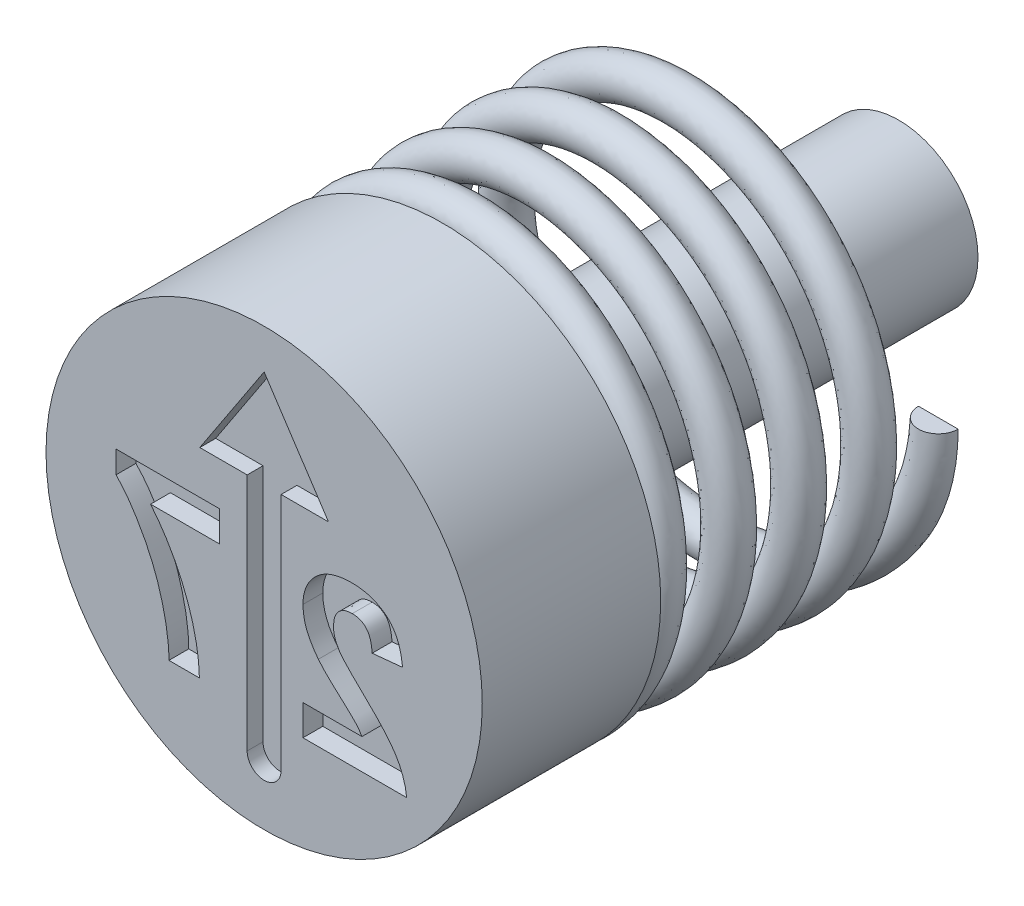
ISO-10303-21;
HEADER;
FILE_DESCRIPTION(('STEP AP214'),'2;1');
FILE_NAME('part.step','',(''),(''),'','','');
FILE_SCHEMA(('AUTOMOTIVE_DESIGN { 1 0 10303 214 1 1 1 1 }'));
ENDSEC;
DATA;
#1=APPLICATION_CONTEXT('core data for automotive mechanical design processes');
#2=APPLICATION_PROTOCOL_DEFINITION('international standard','automotive_design',2000,#1);
#3=PRODUCT_CONTEXT('',#1,'mechanical');
#4=PRODUCT('Part','Part','',(#3));
#5=PRODUCT_RELATED_PRODUCT_CATEGORY('part','',(#4));
#6=PRODUCT_DEFINITION_FORMATION('','',#4);
#7=PRODUCT_DEFINITION_CONTEXT('part definition',#1,'design');
#8=PRODUCT_DEFINITION('design','',#6,#7);
#9=PRODUCT_DEFINITION_SHAPE('','',#8);
#10=(LENGTH_UNIT() NAMED_UNIT(*) SI_UNIT(.MILLI.,.METRE.));
#11=(NAMED_UNIT(*) PLANE_ANGLE_UNIT() SI_UNIT($,.RADIAN.));
#12=(NAMED_UNIT(*) SI_UNIT($,.STERADIAN.) SOLID_ANGLE_UNIT());
#13=UNCERTAINTY_MEASURE_WITH_UNIT(LENGTH_MEASURE(1.E-05),#10,'distance_accuracy_value','');
#14=(GEOMETRIC_REPRESENTATION_CONTEXT(3) GLOBAL_UNCERTAINTY_ASSIGNED_CONTEXT((#13)) GLOBAL_UNIT_ASSIGNED_CONTEXT((#10,
#11,#12)) REPRESENTATION_CONTEXT('',''));
#15=CARTESIAN_POINT('',(0.,0.,0.));
#16=DIRECTION('',(0.,0.,1.));
#17=DIRECTION('',(1.,0.,0.));
#18=AXIS2_PLACEMENT_3D('',#15,#16,#17);
#19=CARTESIAN_POINT('',(5.,0.,-12.5));
#20=DIRECTION('',(0.,-1.,0.));
#21=DIRECTION('',(0.,0.,-1.));
#22=AXIS2_PLACEMENT_3D('',#19,#20,#21);
#23=PLANE('',#22);
#24=CARTESIAN_POINT('',(5.,0.,-12.));
#25=DIRECTION('',(0.,1.,0.));
#26=DIRECTION('',(0.,0.,1.));
#27=AXIS2_PLACEMENT_3D('',#24,#25,#26);
#28=CIRCLE('',#27,0.500000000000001);
#29=CARTESIAN_POINT('',(4.5,0.,-12.));
#30=VERTEX_POINT('',#29);
#31=CARTESIAN_POINT('',(5.5,0.,-12.));
#32=VERTEX_POINT('',#31);
#33=EDGE_CURVE('E92',#30,#32,#28,.T.);
#34=ORIENTED_EDGE('',*,*,#33,.T.);
#35=DIRECTION('',(-1.,0.,0.));
#36=VECTOR('',#35,1.);
#37=CARTESIAN_POINT('',(5.,0.,-12.));
#38=LINE('',#37,#36);
#39=EDGE_CURVE('E79',#32,#30,#38,.T.);
#40=ORIENTED_EDGE('',*,*,#39,.T.);
#41=EDGE_LOOP('',(#34,#40));
#42=FACE_BOUND('',#41,.T.);
#43=ADVANCED_FACE('F53',(#42),#23,.F.);
#44=CARTESIAN_POINT('',(-4.21831895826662E-13,-5.,-4.99999999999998));
#45=DIRECTION('',(-1.,0.,0.));
#46=DIRECTION('',(0.,-1.,0.));
#47=AXIS2_PLACEMENT_3D('',#44,#45,#46);
#48=PLANE('',#47);
#49=DIRECTION('',(0.,-1.,0.));
#50=VECTOR('',#49,1.);
#51=CARTESIAN_POINT('',(-4.21831895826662E-13,-5.,-4.5));
#52=LINE('',#51,#50);
#53=CARTESIAN_POINT('',(-3.79682048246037E-13,-4.5,-4.5));
#54=VERTEX_POINT('',#53);
#55=CARTESIAN_POINT('',(-4.63981743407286E-13,-5.5,-4.5));
#56=VERTEX_POINT('',#55);
#57=EDGE_CURVE('E73',#54,#56,#52,.T.);
#58=ORIENTED_EDGE('',*,*,#57,.F.);
#59=CARTESIAN_POINT('',(-4.21831895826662E-13,-5.,-4.49999999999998));
#60=DIRECTION('',(-1.,0.,0.));
#61=DIRECTION('',(0.,-1.,0.));
#62=AXIS2_PLACEMENT_3D('',#59,#60,#61);
#63=CIRCLE('',#62,0.500000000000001);
#64=EDGE_CURVE('E89',#54,#56,#63,.T.);
#65=ORIENTED_EDGE('',*,*,#64,.T.);
#66=EDGE_LOOP('',(#58,#65));
#67=FACE_BOUND('',#66,.T.);
#68=ADVANCED_FACE('F55',(#67),#48,.T.);
#69=CARTESIAN_POINT('',(5.,0.,-11.5));
#70=CARTESIAN_POINT('',(5.,-1.62459848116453,-11.4117647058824));
#71=CARTESIAN_POINT('',(4.04508497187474,-2.93892626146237,-11.3235294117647));
#72=CARTESIAN_POINT('',(3.09016994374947,-4.2532540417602,-11.2352941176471));
#73=CARTESIAN_POINT('',(1.54508497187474,-4.75528258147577,-11.1470588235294));
#74=CARTESIAN_POINT('',(0.,-5.25731112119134,-11.0588235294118));
#75=CARTESIAN_POINT('',(-1.54508497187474,-4.75528258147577,-10.9705882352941));
#76=CARTESIAN_POINT('',(-3.09016994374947,-4.2532540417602,-10.8823529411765));
#77=CARTESIAN_POINT('',(-4.04508497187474,-2.93892626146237,-10.7941176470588));
#78=CARTESIAN_POINT('',(-5.,-1.62459848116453,-10.7058823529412));
#79=CARTESIAN_POINT('',(-5.,0.,-10.6176470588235));
#80=CARTESIAN_POINT('',(-5.,1.62459848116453,-10.5294117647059));
#81=CARTESIAN_POINT('',(-4.04508497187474,2.93892626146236,-10.4411764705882));
#82=CARTESIAN_POINT('',(-3.09016994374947,4.2532540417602,-10.3529411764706));
#83=CARTESIAN_POINT('',(-1.54508497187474,4.75528258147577,-10.2647058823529));
#84=CARTESIAN_POINT('',(0.,5.25731112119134,-10.1764705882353));
#85=CARTESIAN_POINT('',(1.54508497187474,4.75528258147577,-10.0882352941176));
#86=CARTESIAN_POINT('',(3.09016994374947,4.2532540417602,-10.));
#87=CARTESIAN_POINT('',(4.04508497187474,2.93892626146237,-9.91176470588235));
#88=CARTESIAN_POINT('',(5.,1.62459848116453,-9.8235294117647));
#89=CARTESIAN_POINT('',(5.,0.,-9.73529411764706));
#90=CARTESIAN_POINT('',(5.,-1.62459848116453,-9.64705882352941));
#91=CARTESIAN_POINT('',(4.04508497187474,-2.93892626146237,-9.55882352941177));
#92=CARTESIAN_POINT('',(3.09016994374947,-4.2532540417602,-9.47058823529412));
#93=CARTESIAN_POINT('',(1.54508497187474,-4.75528258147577,-9.38235294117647));
#94=CARTESIAN_POINT('',(0.,-5.25731112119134,-9.29411764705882));
#95=CARTESIAN_POINT('',(-1.54508497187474,-4.75528258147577,-9.20588235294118));
#96=CARTESIAN_POINT('',(-3.09016994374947,-4.2532540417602,-9.11764705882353));
#97=CARTESIAN_POINT('',(-4.04508497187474,-2.93892626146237,-9.02941176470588));
#98=CARTESIAN_POINT('',(-5.,-1.62459848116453,-8.94117647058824));
#99=CARTESIAN_POINT('',(-5.,0.,-8.85294117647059));
#100=CARTESIAN_POINT('',(-5.,1.62459848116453,-8.76470588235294));
#101=CARTESIAN_POINT('',(-4.04508497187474,2.93892626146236,-8.67647058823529));
#102=CARTESIAN_POINT('',(-3.09016994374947,4.2532540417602,-8.58823529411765));
#103=CARTESIAN_POINT('',(-1.54508497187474,4.75528258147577,-8.5));
#104=CARTESIAN_POINT('',(0.,5.25731112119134,-8.41176470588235));
#105=CARTESIAN_POINT('',(1.54508497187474,4.75528258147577,-8.3235294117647));
#106=CARTESIAN_POINT('',(3.09016994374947,4.2532540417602,-8.23529411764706));
#107=CARTESIAN_POINT('',(4.04508497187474,2.93892626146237,-8.14705882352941));
#108=CARTESIAN_POINT('',(5.,1.62459848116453,-8.05882352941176));
#109=CARTESIAN_POINT('',(5.,0.,-7.97058823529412));
#110=CARTESIAN_POINT('',(5.,-1.62459848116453,-7.88235294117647));
#111=CARTESIAN_POINT('',(4.04508497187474,-2.93892626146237,-7.79411764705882));
#112=CARTESIAN_POINT('',(3.09016994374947,-4.2532540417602,-7.70588235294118));
#113=CARTESIAN_POINT('',(1.54508497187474,-4.75528258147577,-7.61764705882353));
#114=CARTESIAN_POINT('',(0.,-5.25731112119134,-7.52941176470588));
#115=CARTESIAN_POINT('',(-1.54508497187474,-4.75528258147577,-7.44117647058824));
#116=CARTESIAN_POINT('',(-3.09016994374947,-4.2532540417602,-7.35294117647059));
#117=CARTESIAN_POINT('',(-4.04508497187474,-2.93892626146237,-7.26470588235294));
#118=CARTESIAN_POINT('',(-5.,-1.62459848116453,-7.17647058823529));
#119=CARTESIAN_POINT('',(-5.,0.,-7.08823529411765));
#120=CARTESIAN_POINT('',(-5.,1.62459848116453,-7.));
#121=CARTESIAN_POINT('',(-4.04508497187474,2.93892626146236,-6.91176470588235));
#122=CARTESIAN_POINT('',(-3.09016994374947,4.2532540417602,-6.82352941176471));
#123=CARTESIAN_POINT('',(-1.54508497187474,4.75528258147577,-6.73529411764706));
#124=CARTESIAN_POINT('',(0.,5.25731112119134,-6.64705882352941));
#125=CARTESIAN_POINT('',(1.54508497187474,4.75528258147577,-6.55882352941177));
#126=CARTESIAN_POINT('',(3.09016994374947,4.2532540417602,-6.47058823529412));
#127=CARTESIAN_POINT('',(4.04508497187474,2.93892626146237,-6.38235294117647));
#128=CARTESIAN_POINT('',(5.,1.62459848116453,-6.29411764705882));
#129=CARTESIAN_POINT('',(5.,0.,-6.20588235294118));
#130=CARTESIAN_POINT('',(5.,-1.62459848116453,-6.11764705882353));
#131=CARTESIAN_POINT('',(4.04508497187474,-2.93892626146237,-6.02941176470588));
#132=CARTESIAN_POINT('',(3.09016994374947,-4.2532540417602,-5.94117647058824));
#133=CARTESIAN_POINT('',(1.54508497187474,-4.75528258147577,-5.85294117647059));
#134=CARTESIAN_POINT('',(0.,-5.25731112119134,-5.76470588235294));
#135=CARTESIAN_POINT('',(-1.54508497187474,-4.75528258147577,-5.6764705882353));
#136=CARTESIAN_POINT('',(-3.09016994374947,-4.2532540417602,-5.58823529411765));
#137=CARTESIAN_POINT('',(-4.04508497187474,-2.93892626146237,-5.5));
#138=CARTESIAN_POINT('',(-5.,-1.62459848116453,-5.41176470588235));
#139=CARTESIAN_POINT('',(-5.,0.,-5.32352941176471));
#140=CARTESIAN_POINT('',(-5.,1.62459848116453,-5.23529411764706));
#141=CARTESIAN_POINT('',(-4.04508497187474,2.93892626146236,-5.14705882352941));
#142=CARTESIAN_POINT('',(-3.09016994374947,4.2532540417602,-5.05882352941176));
#143=CARTESIAN_POINT('',(-1.54508497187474,4.75528258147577,-4.97058823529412));
#144=CARTESIAN_POINT('',(0.,5.25731112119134,-4.88235294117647));
#145=CARTESIAN_POINT('',(1.54508497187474,4.75528258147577,-4.79411764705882));
#146=CARTESIAN_POINT('',(3.09016994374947,4.2532540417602,-4.70588235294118));
#147=CARTESIAN_POINT('',(4.04508497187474,2.93892626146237,-4.61764705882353));
#148=CARTESIAN_POINT('',(5.,1.62459848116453,-4.52941176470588));
#149=CARTESIAN_POINT('',(5.,0.,-4.44117647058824));
#150=CARTESIAN_POINT('',(5.,-1.62459848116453,-4.35294117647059));
#151=CARTESIAN_POINT('',(4.04508497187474,-2.93892626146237,-4.26470588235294));
#152=CARTESIAN_POINT('',(3.09016994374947,-4.2532540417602,-4.1764705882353));
#153=CARTESIAN_POINT('',(1.54508497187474,-4.75528258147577,-4.08823529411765));
#154=CARTESIAN_POINT('',(0.791922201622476,-5.00000000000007,-4.04522436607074));
#155=CARTESIAN_POINT('',(-4.21831895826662E-13,-5.,-3.99999999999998));
#156=CARTESIAN_POINT('',(6.,0.,-11.5));
#157=CARTESIAN_POINT('',(6.,-1.94951817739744,-11.4117647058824));
#158=CARTESIAN_POINT('',(4.85410196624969,-3.52671151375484,-11.3235294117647));
#159=CARTESIAN_POINT('',(3.70820393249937,-5.10390485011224,-11.2352941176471));
#160=CARTESIAN_POINT('',(1.85410196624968,-5.70633909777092,-11.1470588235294));
#161=CARTESIAN_POINT('',(0.,-6.3087733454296,-11.0588235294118));
#162=CARTESIAN_POINT('',(-1.85410196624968,-5.70633909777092,-10.9705882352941));
#163=CARTESIAN_POINT('',(-3.70820393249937,-5.10390485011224,-10.8823529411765));
#164=CARTESIAN_POINT('',(-4.85410196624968,-3.52671151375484,-10.7941176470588));
#165=CARTESIAN_POINT('',(-6.,-1.94951817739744,-10.7058823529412));
#166=CARTESIAN_POINT('',(-6.,0.,-10.6176470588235));
#167=CARTESIAN_POINT('',(-6.,1.94951817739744,-10.5294117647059));
#168=CARTESIAN_POINT('',(-4.85410196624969,3.52671151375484,-10.4411764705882));
#169=CARTESIAN_POINT('',(-3.70820393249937,5.10390485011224,-10.3529411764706));
#170=CARTESIAN_POINT('',(-1.85410196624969,5.70633909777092,-10.2647058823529));
#171=CARTESIAN_POINT('',(0.,6.3087733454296,-10.1764705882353));
#172=CARTESIAN_POINT('',(1.85410196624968,5.70633909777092,-10.0882352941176));
#173=CARTESIAN_POINT('',(3.70820393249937,5.10390485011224,-10.));
#174=CARTESIAN_POINT('',(4.85410196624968,3.52671151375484,-9.91176470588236));
#175=CARTESIAN_POINT('',(6.,1.94951817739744,-9.82352941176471));
#176=CARTESIAN_POINT('',(6.,0.,-9.73529411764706));
#177=CARTESIAN_POINT('',(6.,-1.94951817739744,-9.64705882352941));
#178=CARTESIAN_POINT('',(4.85410196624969,-3.52671151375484,-9.55882352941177));
#179=CARTESIAN_POINT('',(3.70820393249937,-5.10390485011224,-9.47058823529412));
#180=CARTESIAN_POINT('',(1.85410196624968,-5.70633909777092,-9.38235294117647));
#181=CARTESIAN_POINT('',(0.,-6.3087733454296,-9.29411764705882));
#182=CARTESIAN_POINT('',(-1.85410196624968,-5.70633909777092,-9.20588235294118));
#183=CARTESIAN_POINT('',(-3.70820393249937,-5.10390485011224,-9.11764705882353));
#184=CARTESIAN_POINT('',(-4.85410196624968,-3.52671151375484,-9.02941176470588));
#185=CARTESIAN_POINT('',(-6.,-1.94951817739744,-8.94117647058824));
#186=CARTESIAN_POINT('',(-6.,0.,-8.85294117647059));
#187=CARTESIAN_POINT('',(-6.,1.94951817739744,-8.76470588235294));
#188=CARTESIAN_POINT('',(-4.85410196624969,3.52671151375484,-8.6764705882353));
#189=CARTESIAN_POINT('',(-3.70820393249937,5.10390485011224,-8.58823529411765));
#190=CARTESIAN_POINT('',(-1.85410196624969,5.70633909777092,-8.5));
#191=CARTESIAN_POINT('',(0.,6.3087733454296,-8.41176470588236));
#192=CARTESIAN_POINT('',(1.85410196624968,5.70633909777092,-8.32352941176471));
#193=CARTESIAN_POINT('',(3.70820393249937,5.10390485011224,-8.23529411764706));
#194=CARTESIAN_POINT('',(4.85410196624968,3.52671151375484,-8.14705882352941));
#195=CARTESIAN_POINT('',(6.,1.94951817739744,-8.05882352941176));
#196=CARTESIAN_POINT('',(6.,0.,-7.97058823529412));
#197=CARTESIAN_POINT('',(6.,-1.94951817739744,-7.88235294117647));
#198=CARTESIAN_POINT('',(4.85410196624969,-3.52671151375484,-7.79411764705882));
#199=CARTESIAN_POINT('',(3.70820393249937,-5.10390485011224,-7.70588235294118));
#200=CARTESIAN_POINT('',(1.85410196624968,-5.70633909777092,-7.61764705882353));
#201=CARTESIAN_POINT('',(0.,-6.3087733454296,-7.52941176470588));
#202=CARTESIAN_POINT('',(-1.85410196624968,-5.70633909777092,-7.44117647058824));
#203=CARTESIAN_POINT('',(-3.70820393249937,-5.10390485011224,-7.35294117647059));
#204=CARTESIAN_POINT('',(-4.85410196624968,-3.52671151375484,-7.26470588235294));
#205=CARTESIAN_POINT('',(-6.,-1.94951817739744,-7.1764705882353));
#206=CARTESIAN_POINT('',(-6.,0.,-7.08823529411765));
#207=CARTESIAN_POINT('',(-6.,1.94951817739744,-7.));
#208=CARTESIAN_POINT('',(-4.85410196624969,3.52671151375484,-6.91176470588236));
#209=CARTESIAN_POINT('',(-3.70820393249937,5.10390485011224,-6.82352941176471));
#210=CARTESIAN_POINT('',(-1.85410196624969,5.70633909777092,-6.73529411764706));
#211=CARTESIAN_POINT('',(0.,6.3087733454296,-6.64705882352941));
#212=CARTESIAN_POINT('',(1.85410196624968,5.70633909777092,-6.55882352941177));
#213=CARTESIAN_POINT('',(3.70820393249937,5.10390485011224,-6.47058823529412));
#214=CARTESIAN_POINT('',(4.85410196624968,3.52671151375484,-6.38235294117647));
#215=CARTESIAN_POINT('',(6.,1.94951817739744,-6.29411764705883));
#216=CARTESIAN_POINT('',(6.,0.,-6.20588235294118));
#217=CARTESIAN_POINT('',(6.,-1.94951817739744,-6.11764705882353));
#218=CARTESIAN_POINT('',(4.85410196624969,-3.52671151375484,-6.02941176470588));
#219=CARTESIAN_POINT('',(3.70820393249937,-5.10390485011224,-5.94117647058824));
#220=CARTESIAN_POINT('',(1.85410196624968,-5.70633909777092,-5.85294117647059));
#221=CARTESIAN_POINT('',(0.,-6.3087733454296,-5.76470588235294));
#222=CARTESIAN_POINT('',(-1.85410196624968,-5.70633909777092,-5.6764705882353));
#223=CARTESIAN_POINT('',(-3.70820393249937,-5.10390485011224,-5.58823529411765));
#224=CARTESIAN_POINT('',(-4.85410196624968,-3.52671151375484,-5.5));
#225=CARTESIAN_POINT('',(-6.,-1.94951817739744,-5.41176470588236));
#226=CARTESIAN_POINT('',(-6.,0.,-5.32352941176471));
#227=CARTESIAN_POINT('',(-6.,1.94951817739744,-5.23529411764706));
#228=CARTESIAN_POINT('',(-4.85410196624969,3.52671151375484,-5.14705882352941));
#229=CARTESIAN_POINT('',(-3.70820393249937,5.10390485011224,-5.05882352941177));
#230=CARTESIAN_POINT('',(-1.85410196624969,5.70633909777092,-4.97058823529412));
#231=CARTESIAN_POINT('',(0.,6.3087733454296,-4.88235294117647));
#232=CARTESIAN_POINT('',(1.85410196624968,5.70633909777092,-4.79411764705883));
#233=CARTESIAN_POINT('',(3.70820393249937,5.10390485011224,-4.70588235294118));
#234=CARTESIAN_POINT('',(4.85410196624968,3.52671151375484,-4.61764705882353));
#235=CARTESIAN_POINT('',(6.,1.94951817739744,-4.52941176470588));
#236=CARTESIAN_POINT('',(6.,0.,-4.44117647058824));
#237=CARTESIAN_POINT('',(6.,-1.94951817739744,-4.35294117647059));
#238=CARTESIAN_POINT('',(4.85410196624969,-3.52671151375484,-4.26470588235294));
#239=CARTESIAN_POINT('',(3.70820393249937,-5.10390485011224,-4.1764705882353));
#240=CARTESIAN_POINT('',(1.85410196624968,-5.70633909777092,-4.08823529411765));
#241=CARTESIAN_POINT('',(0.950306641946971,-6.00000000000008,-4.04522436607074));
#242=CARTESIAN_POINT('',(-5.06131590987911E-13,-6.,-3.99999999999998));
#243=CARTESIAN_POINT('',(6.,0.,-12.5));
#244=CARTESIAN_POINT('',(6.,-1.94951817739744,-12.4117647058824));
#245=CARTESIAN_POINT('',(4.85410196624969,-3.52671151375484,-12.3235294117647));
#246=CARTESIAN_POINT('',(3.70820393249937,-5.10390485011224,-12.2352941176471));
#247=CARTESIAN_POINT('',(1.85410196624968,-5.70633909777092,-12.1470588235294));
#248=CARTESIAN_POINT('',(0.,-6.3087733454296,-12.0588235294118));
#249=CARTESIAN_POINT('',(-1.85410196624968,-5.70633909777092,-11.9705882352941));
#250=CARTESIAN_POINT('',(-3.70820393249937,-5.10390485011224,-11.8823529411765));
#251=CARTESIAN_POINT('',(-4.85410196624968,-3.52671151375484,-11.7941176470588));
#252=CARTESIAN_POINT('',(-6.,-1.94951817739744,-11.7058823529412));
#253=CARTESIAN_POINT('',(-6.,0.,-11.6176470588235));
#254=CARTESIAN_POINT('',(-6.,1.94951817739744,-11.5294117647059));
#255=CARTESIAN_POINT('',(-4.85410196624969,3.52671151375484,-11.4411764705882));
#256=CARTESIAN_POINT('',(-3.70820393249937,5.10390485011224,-11.3529411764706));
#257=CARTESIAN_POINT('',(-1.85410196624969,5.70633909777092,-11.2647058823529));
#258=CARTESIAN_POINT('',(0.,6.3087733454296,-11.1764705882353));
#259=CARTESIAN_POINT('',(1.85410196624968,5.70633909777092,-11.0882352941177));
#260=CARTESIAN_POINT('',(3.70820393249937,5.10390485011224,-11.));
#261=CARTESIAN_POINT('',(4.85410196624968,3.52671151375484,-10.9117647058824));
#262=CARTESIAN_POINT('',(6.,1.94951817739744,-10.8235294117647));
#263=CARTESIAN_POINT('',(6.,0.,-10.7352941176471));
#264=CARTESIAN_POINT('',(6.,-1.94951817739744,-10.6470588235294));
#265=CARTESIAN_POINT('',(4.85410196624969,-3.52671151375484,-10.5588235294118));
#266=CARTESIAN_POINT('',(3.70820393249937,-5.10390485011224,-10.4705882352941));
#267=CARTESIAN_POINT('',(1.85410196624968,-5.70633909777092,-10.3823529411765));
#268=CARTESIAN_POINT('',(0.,-6.3087733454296,-10.2941176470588));
#269=CARTESIAN_POINT('',(-1.85410196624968,-5.70633909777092,-10.2058823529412));
#270=CARTESIAN_POINT('',(-3.70820393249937,-5.10390485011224,-10.1176470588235));
#271=CARTESIAN_POINT('',(-4.85410196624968,-3.52671151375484,-10.0294117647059));
#272=CARTESIAN_POINT('',(-6.,-1.94951817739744,-9.94117647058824));
#273=CARTESIAN_POINT('',(-6.,0.,-9.85294117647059));
#274=CARTESIAN_POINT('',(-6.,1.94951817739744,-9.76470588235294));
#275=CARTESIAN_POINT('',(-4.85410196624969,3.52671151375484,-9.6764705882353));
#276=CARTESIAN_POINT('',(-3.70820393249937,5.10390485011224,-9.58823529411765));
#277=CARTESIAN_POINT('',(-1.85410196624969,5.70633909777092,-9.5));
#278=CARTESIAN_POINT('',(0.,6.3087733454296,-9.41176470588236));
#279=CARTESIAN_POINT('',(1.85410196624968,5.70633909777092,-9.32352941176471));
#280=CARTESIAN_POINT('',(3.70820393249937,5.10390485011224,-9.23529411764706));
#281=CARTESIAN_POINT('',(4.85410196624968,3.52671151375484,-9.14705882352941));
#282=CARTESIAN_POINT('',(6.,1.94951817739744,-9.05882352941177));
#283=CARTESIAN_POINT('',(6.,0.,-8.97058823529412));
#284=CARTESIAN_POINT('',(6.,-1.94951817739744,-8.88235294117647));
#285=CARTESIAN_POINT('',(4.85410196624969,-3.52671151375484,-8.79411764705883));
#286=CARTESIAN_POINT('',(3.70820393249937,-5.10390485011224,-8.70588235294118));
#287=CARTESIAN_POINT('',(1.85410196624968,-5.70633909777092,-8.61764705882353));
#288=CARTESIAN_POINT('',(0.,-6.3087733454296,-8.52941176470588));
#289=CARTESIAN_POINT('',(-1.85410196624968,-5.70633909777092,-8.44117647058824));
#290=CARTESIAN_POINT('',(-3.70820393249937,-5.10390485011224,-8.35294117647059));
#291=CARTESIAN_POINT('',(-4.85410196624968,-3.52671151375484,-8.26470588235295));
#292=CARTESIAN_POINT('',(-6.,-1.94951817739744,-8.1764705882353));
#293=CARTESIAN_POINT('',(-6.,0.,-8.08823529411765));
#294=CARTESIAN_POINT('',(-6.,1.94951817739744,-8.));
#295=CARTESIAN_POINT('',(-4.85410196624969,3.52671151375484,-7.91176470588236));
#296=CARTESIAN_POINT('',(-3.70820393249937,5.10390485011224,-7.82352941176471));
#297=CARTESIAN_POINT('',(-1.85410196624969,5.70633909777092,-7.73529411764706));
#298=CARTESIAN_POINT('',(0.,6.3087733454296,-7.64705882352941));
#299=CARTESIAN_POINT('',(1.85410196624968,5.70633909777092,-7.55882352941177));
#300=CARTESIAN_POINT('',(3.70820393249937,5.10390485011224,-7.47058823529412));
#301=CARTESIAN_POINT('',(4.85410196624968,3.52671151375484,-7.38235294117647));
#302=CARTESIAN_POINT('',(6.,1.94951817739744,-7.29411764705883));
#303=CARTESIAN_POINT('',(6.,0.,-7.20588235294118));
#304=CARTESIAN_POINT('',(6.,-1.94951817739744,-7.11764705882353));
#305=CARTESIAN_POINT('',(4.85410196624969,-3.52671151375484,-7.02941176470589));
#306=CARTESIAN_POINT('',(3.70820393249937,-5.10390485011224,-6.94117647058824));
#307=CARTESIAN_POINT('',(1.85410196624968,-5.70633909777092,-6.85294117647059));
#308=CARTESIAN_POINT('',(0.,-6.3087733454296,-6.76470588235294));
#309=CARTESIAN_POINT('',(-1.85410196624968,-5.70633909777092,-6.6764705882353));
#310=CARTESIAN_POINT('',(-3.70820393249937,-5.10390485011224,-6.58823529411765));
#311=CARTESIAN_POINT('',(-4.85410196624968,-3.52671151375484,-6.5));
#312=CARTESIAN_POINT('',(-6.,-1.94951817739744,-6.41176470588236));
#313=CARTESIAN_POINT('',(-6.,0.,-6.32352941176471));
#314=CARTESIAN_POINT('',(-6.,1.94951817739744,-6.23529411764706));
#315=CARTESIAN_POINT('',(-4.85410196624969,3.52671151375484,-6.14705882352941));
#316=CARTESIAN_POINT('',(-3.70820393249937,5.10390485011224,-6.05882352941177));
#317=CARTESIAN_POINT('',(-1.85410196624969,5.70633909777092,-5.97058823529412));
#318=CARTESIAN_POINT('',(0.,6.3087733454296,-5.88235294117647));
#319=CARTESIAN_POINT('',(1.85410196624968,5.70633909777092,-5.79411764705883));
#320=CARTESIAN_POINT('',(3.70820393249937,5.10390485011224,-5.70588235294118));
#321=CARTESIAN_POINT('',(4.85410196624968,3.52671151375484,-5.61764705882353));
#322=CARTESIAN_POINT('',(6.,1.94951817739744,-5.52941176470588));
#323=CARTESIAN_POINT('',(6.,0.,-5.44117647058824));
#324=CARTESIAN_POINT('',(6.,-1.94951817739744,-5.35294117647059));
#325=CARTESIAN_POINT('',(4.85410196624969,-3.52671151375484,-5.26470588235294));
#326=CARTESIAN_POINT('',(3.70820393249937,-5.10390485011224,-5.1764705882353));
#327=CARTESIAN_POINT('',(1.85410196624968,-5.70633909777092,-5.08823529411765));
#328=CARTESIAN_POINT('',(0.950306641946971,-6.00000000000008,-5.04522436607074));
#329=CARTESIAN_POINT('',(-5.06131590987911E-13,-6.,-4.99999999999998));
#330=CARTESIAN_POINT('',(5.,0.,-12.5));
#331=CARTESIAN_POINT('',(5.,-1.62459848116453,-12.4117647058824));
#332=CARTESIAN_POINT('',(4.04508497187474,-2.93892626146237,-12.3235294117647));
#333=CARTESIAN_POINT('',(3.09016994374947,-4.2532540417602,-12.2352941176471));
#334=CARTESIAN_POINT('',(1.54508497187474,-4.75528258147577,-12.1470588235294));
#335=CARTESIAN_POINT('',(0.,-5.25731112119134,-12.0588235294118));
#336=CARTESIAN_POINT('',(-1.54508497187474,-4.75528258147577,-11.9705882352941));
#337=CARTESIAN_POINT('',(-3.09016994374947,-4.2532540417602,-11.8823529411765));
#338=CARTESIAN_POINT('',(-4.04508497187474,-2.93892626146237,-11.7941176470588));
#339=CARTESIAN_POINT('',(-5.,-1.62459848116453,-11.7058823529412));
#340=CARTESIAN_POINT('',(-5.,0.,-11.6176470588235));
#341=CARTESIAN_POINT('',(-5.,1.62459848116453,-11.5294117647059));
#342=CARTESIAN_POINT('',(-4.04508497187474,2.93892626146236,-11.4411764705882));
#343=CARTESIAN_POINT('',(-3.09016994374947,4.2532540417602,-11.3529411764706));
#344=CARTESIAN_POINT('',(-1.54508497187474,4.75528258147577,-11.2647058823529));
#345=CARTESIAN_POINT('',(0.,5.25731112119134,-11.1764705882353));
#346=CARTESIAN_POINT('',(1.54508497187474,4.75528258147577,-11.0882352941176));
#347=CARTESIAN_POINT('',(3.09016994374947,4.2532540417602,-11.));
#348=CARTESIAN_POINT('',(4.04508497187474,2.93892626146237,-10.9117647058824));
#349=CARTESIAN_POINT('',(5.,1.62459848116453,-10.8235294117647));
#350=CARTESIAN_POINT('',(5.,0.,-10.7352941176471));
#351=CARTESIAN_POINT('',(5.,-1.62459848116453,-10.6470588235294));
#352=CARTESIAN_POINT('',(4.04508497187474,-2.93892626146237,-10.5588235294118));
#353=CARTESIAN_POINT('',(3.09016994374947,-4.2532540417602,-10.4705882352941));
#354=CARTESIAN_POINT('',(1.54508497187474,-4.75528258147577,-10.3823529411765));
#355=CARTESIAN_POINT('',(0.,-5.25731112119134,-10.2941176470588));
#356=CARTESIAN_POINT('',(-1.54508497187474,-4.75528258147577,-10.2058823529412));
#357=CARTESIAN_POINT('',(-3.09016994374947,-4.2532540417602,-10.1176470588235));
#358=CARTESIAN_POINT('',(-4.04508497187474,-2.93892626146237,-10.0294117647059));
#359=CARTESIAN_POINT('',(-5.,-1.62459848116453,-9.94117647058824));
#360=CARTESIAN_POINT('',(-5.,0.,-9.85294117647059));
#361=CARTESIAN_POINT('',(-5.,1.62459848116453,-9.76470588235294));
#362=CARTESIAN_POINT('',(-4.04508497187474,2.93892626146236,-9.6764705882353));
#363=CARTESIAN_POINT('',(-3.09016994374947,4.2532540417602,-9.58823529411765));
#364=CARTESIAN_POINT('',(-1.54508497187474,4.75528258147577,-9.5));
#365=CARTESIAN_POINT('',(0.,5.25731112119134,-9.41176470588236));
#366=CARTESIAN_POINT('',(1.54508497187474,4.75528258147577,-9.32352941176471));
#367=CARTESIAN_POINT('',(3.09016994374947,4.2532540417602,-9.23529411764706));
#368=CARTESIAN_POINT('',(4.04508497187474,2.93892626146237,-9.14705882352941));
#369=CARTESIAN_POINT('',(5.,1.62459848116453,-9.05882352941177));
#370=CARTESIAN_POINT('',(5.,0.,-8.97058823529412));
#371=CARTESIAN_POINT('',(5.,-1.62459848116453,-8.88235294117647));
#372=CARTESIAN_POINT('',(4.04508497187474,-2.93892626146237,-8.79411764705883));
#373=CARTESIAN_POINT('',(3.09016994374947,-4.2532540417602,-8.70588235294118));
#374=CARTESIAN_POINT('',(1.54508497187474,-4.75528258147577,-8.61764705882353));
#375=CARTESIAN_POINT('',(0.,-5.25731112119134,-8.52941176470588));
#376=CARTESIAN_POINT('',(-1.54508497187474,-4.75528258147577,-8.44117647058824));
#377=CARTESIAN_POINT('',(-3.09016994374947,-4.2532540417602,-8.35294117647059));
#378=CARTESIAN_POINT('',(-4.04508497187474,-2.93892626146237,-8.26470588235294));
#379=CARTESIAN_POINT('',(-5.,-1.62459848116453,-8.1764705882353));
#380=CARTESIAN_POINT('',(-5.,0.,-8.08823529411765));
#381=CARTESIAN_POINT('',(-5.,1.62459848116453,-8.));
#382=CARTESIAN_POINT('',(-4.04508497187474,2.93892626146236,-7.91176470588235));
#383=CARTESIAN_POINT('',(-3.09016994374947,4.2532540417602,-7.82352941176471));
#384=CARTESIAN_POINT('',(-1.54508497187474,4.75528258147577,-7.73529411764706));
#385=CARTESIAN_POINT('',(0.,5.25731112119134,-7.64705882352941));
#386=CARTESIAN_POINT('',(1.54508497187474,4.75528258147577,-7.55882352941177));
#387=CARTESIAN_POINT('',(3.09016994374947,4.2532540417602,-7.47058823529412));
#388=CARTESIAN_POINT('',(4.04508497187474,2.93892626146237,-7.38235294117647));
#389=CARTESIAN_POINT('',(5.,1.62459848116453,-7.29411764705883));
#390=CARTESIAN_POINT('',(5.,0.,-7.20588235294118));
#391=CARTESIAN_POINT('',(5.,-1.62459848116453,-7.11764705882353));
#392=CARTESIAN_POINT('',(4.04508497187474,-2.93892626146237,-7.02941176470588));
#393=CARTESIAN_POINT('',(3.09016994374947,-4.2532540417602,-6.94117647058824));
#394=CARTESIAN_POINT('',(1.54508497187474,-4.75528258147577,-6.85294117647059));
#395=CARTESIAN_POINT('',(0.,-5.25731112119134,-6.76470588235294));
#396=CARTESIAN_POINT('',(-1.54508497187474,-4.75528258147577,-6.6764705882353));
#397=CARTESIAN_POINT('',(-3.09016994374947,-4.2532540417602,-6.58823529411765));
#398=CARTESIAN_POINT('',(-4.04508497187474,-2.93892626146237,-6.5));
#399=CARTESIAN_POINT('',(-5.,-1.62459848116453,-6.41176470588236));
#400=CARTESIAN_POINT('',(-5.,0.,-6.32352941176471));
#401=CARTESIAN_POINT('',(-5.,1.62459848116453,-6.23529411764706));
#402=CARTESIAN_POINT('',(-4.04508497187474,2.93892626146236,-6.14705882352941));
#403=CARTESIAN_POINT('',(-3.09016994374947,4.2532540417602,-6.05882352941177));
#404=CARTESIAN_POINT('',(-1.54508497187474,4.75528258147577,-5.97058823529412));
#405=CARTESIAN_POINT('',(0.,5.25731112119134,-5.88235294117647));
#406=CARTESIAN_POINT('',(1.54508497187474,4.75528258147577,-5.79411764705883));
#407=CARTESIAN_POINT('',(3.09016994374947,4.2532540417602,-5.70588235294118));
#408=CARTESIAN_POINT('',(4.04508497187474,2.93892626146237,-5.61764705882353));
#409=CARTESIAN_POINT('',(5.,1.62459848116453,-5.52941176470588));
#410=CARTESIAN_POINT('',(5.,0.,-5.44117647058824));
#411=CARTESIAN_POINT('',(5.,-1.62459848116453,-5.35294117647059));
#412=CARTESIAN_POINT('',(4.04508497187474,-2.93892626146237,-5.26470588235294));
#413=CARTESIAN_POINT('',(3.09016994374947,-4.2532540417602,-5.1764705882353));
#414=CARTESIAN_POINT('',(1.54508497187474,-4.75528258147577,-5.08823529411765));
#415=CARTESIAN_POINT('',(0.791922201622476,-5.00000000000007,-5.04522436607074));
#416=CARTESIAN_POINT('',(-4.21831895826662E-13,-5.,-4.99999999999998));
#417=CARTESIAN_POINT('',(4.,0.,-12.5));
#418=CARTESIAN_POINT('',(4.,-1.29967878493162,-12.4117647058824));
#419=CARTESIAN_POINT('',(3.23606797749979,-2.35114100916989,-12.3235294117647));
#420=CARTESIAN_POINT('',(2.47213595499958,-3.40260323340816,-12.2352941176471));
#421=CARTESIAN_POINT('',(1.23606797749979,-3.80422606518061,-12.1470588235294));
#422=CARTESIAN_POINT('',(0.,-4.20584889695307,-12.0588235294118));
#423=CARTESIAN_POINT('',(-1.23606797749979,-3.80422606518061,-11.9705882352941));
#424=CARTESIAN_POINT('',(-2.47213595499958,-3.40260323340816,-11.8823529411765));
#425=CARTESIAN_POINT('',(-3.23606797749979,-2.35114100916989,-11.7941176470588));
#426=CARTESIAN_POINT('',(-4.,-1.29967878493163,-11.7058823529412));
#427=CARTESIAN_POINT('',(-4.,0.,-11.6176470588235));
#428=CARTESIAN_POINT('',(-4.,1.29967878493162,-11.5294117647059));
#429=CARTESIAN_POINT('',(-3.23606797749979,2.35114100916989,-11.4411764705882));
#430=CARTESIAN_POINT('',(-2.47213595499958,3.40260323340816,-11.3529411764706));
#431=CARTESIAN_POINT('',(-1.23606797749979,3.80422606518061,-11.2647058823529));
#432=CARTESIAN_POINT('',(0.,4.20584889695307,-11.1764705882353));
#433=CARTESIAN_POINT('',(1.23606797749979,3.80422606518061,-11.0882352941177));
#434=CARTESIAN_POINT('',(2.47213595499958,3.40260323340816,-11.));
#435=CARTESIAN_POINT('',(3.23606797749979,2.35114100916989,-10.9117647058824));
#436=CARTESIAN_POINT('',(4.,1.29967878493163,-10.8235294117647));
#437=CARTESIAN_POINT('',(4.,0.,-10.7352941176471));
#438=CARTESIAN_POINT('',(4.,-1.29967878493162,-10.6470588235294));
#439=CARTESIAN_POINT('',(3.23606797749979,-2.35114100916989,-10.5588235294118));
#440=CARTESIAN_POINT('',(2.47213595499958,-3.40260323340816,-10.4705882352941));
#441=CARTESIAN_POINT('',(1.23606797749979,-3.80422606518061,-10.3823529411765));
#442=CARTESIAN_POINT('',(0.,-4.20584889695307,-10.2941176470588));
#443=CARTESIAN_POINT('',(-1.23606797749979,-3.80422606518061,-10.2058823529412));
#444=CARTESIAN_POINT('',(-2.47213595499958,-3.40260323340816,-10.1176470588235));
#445=CARTESIAN_POINT('',(-3.23606797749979,-2.35114100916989,-10.0294117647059));
#446=CARTESIAN_POINT('',(-4.,-1.29967878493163,-9.94117647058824));
#447=CARTESIAN_POINT('',(-4.,0.,-9.85294117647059));
#448=CARTESIAN_POINT('',(-4.,1.29967878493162,-9.76470588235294));
#449=CARTESIAN_POINT('',(-3.23606797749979,2.35114100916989,-9.6764705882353));
#450=CARTESIAN_POINT('',(-2.47213595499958,3.40260323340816,-9.58823529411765));
#451=CARTESIAN_POINT('',(-1.23606797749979,3.80422606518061,-9.5));
#452=CARTESIAN_POINT('',(0.,4.20584889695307,-9.41176470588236));
#453=CARTESIAN_POINT('',(1.23606797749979,3.80422606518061,-9.32352941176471));
#454=CARTESIAN_POINT('',(2.47213595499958,3.40260323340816,-9.23529411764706));
#455=CARTESIAN_POINT('',(3.23606797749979,2.35114100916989,-9.14705882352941));
#456=CARTESIAN_POINT('',(4.,1.29967878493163,-9.05882352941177));
#457=CARTESIAN_POINT('',(4.,0.,-8.97058823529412));
#458=CARTESIAN_POINT('',(4.,-1.29967878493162,-8.88235294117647));
#459=CARTESIAN_POINT('',(3.23606797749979,-2.35114100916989,-8.79411764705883));
#460=CARTESIAN_POINT('',(2.47213595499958,-3.40260323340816,-8.70588235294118));
#461=CARTESIAN_POINT('',(1.23606797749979,-3.80422606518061,-8.61764705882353));
#462=CARTESIAN_POINT('',(0.,-4.20584889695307,-8.52941176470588));
#463=CARTESIAN_POINT('',(-1.23606797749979,-3.80422606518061,-8.44117647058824));
#464=CARTESIAN_POINT('',(-2.47213595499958,-3.40260323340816,-8.35294117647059));
#465=CARTESIAN_POINT('',(-3.23606797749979,-2.35114100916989,-8.26470588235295));
#466=CARTESIAN_POINT('',(-4.,-1.29967878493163,-8.1764705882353));
#467=CARTESIAN_POINT('',(-4.,0.,-8.08823529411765));
#468=CARTESIAN_POINT('',(-4.,1.29967878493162,-8.));
#469=CARTESIAN_POINT('',(-3.23606797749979,2.35114100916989,-7.91176470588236));
#470=CARTESIAN_POINT('',(-2.47213595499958,3.40260323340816,-7.82352941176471));
#471=CARTESIAN_POINT('',(-1.23606797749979,3.80422606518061,-7.73529411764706));
#472=CARTESIAN_POINT('',(0.,4.20584889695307,-7.64705882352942));
#473=CARTESIAN_POINT('',(1.23606797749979,3.80422606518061,-7.55882352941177));
#474=CARTESIAN_POINT('',(2.47213595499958,3.40260323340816,-7.47058823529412));
#475=CARTESIAN_POINT('',(3.23606797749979,2.35114100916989,-7.38235294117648));
#476=CARTESIAN_POINT('',(4.,1.29967878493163,-7.29411764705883));
#477=CARTESIAN_POINT('',(4.,0.,-7.20588235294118));
#478=CARTESIAN_POINT('',(4.,-1.29967878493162,-7.11764705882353));
#479=CARTESIAN_POINT('',(3.23606797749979,-2.35114100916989,-7.02941176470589));
#480=CARTESIAN_POINT('',(2.47213595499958,-3.40260323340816,-6.94117647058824));
#481=CARTESIAN_POINT('',(1.23606797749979,-3.80422606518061,-6.85294117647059));
#482=CARTESIAN_POINT('',(0.,-4.20584889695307,-6.76470588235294));
#483=CARTESIAN_POINT('',(-1.23606797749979,-3.80422606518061,-6.6764705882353));
#484=CARTESIAN_POINT('',(-2.47213595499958,-3.40260323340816,-6.58823529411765));
#485=CARTESIAN_POINT('',(-3.23606797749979,-2.35114100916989,-6.5));
#486=CARTESIAN_POINT('',(-4.,-1.29967878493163,-6.41176470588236));
#487=CARTESIAN_POINT('',(-4.,0.,-6.32352941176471));
#488=CARTESIAN_POINT('',(-4.,1.29967878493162,-6.23529411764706));
#489=CARTESIAN_POINT('',(-3.23606797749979,2.35114100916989,-6.14705882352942));
#490=CARTESIAN_POINT('',(-2.47213595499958,3.40260323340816,-6.05882352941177));
#491=CARTESIAN_POINT('',(-1.23606797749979,3.80422606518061,-5.97058823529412));
#492=CARTESIAN_POINT('',(0.,4.20584889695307,-5.88235294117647));
#493=CARTESIAN_POINT('',(1.23606797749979,3.80422606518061,-5.79411764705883));
#494=CARTESIAN_POINT('',(2.47213595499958,3.40260323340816,-5.70588235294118));
#495=CARTESIAN_POINT('',(3.23606797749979,2.35114100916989,-5.61764705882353));
#496=CARTESIAN_POINT('',(4.,1.29967878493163,-5.52941176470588));
#497=CARTESIAN_POINT('',(4.,0.,-5.44117647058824));
#498=CARTESIAN_POINT('',(4.,-1.29967878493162,-5.35294117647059));
#499=CARTESIAN_POINT('',(3.23606797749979,-2.35114100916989,-5.26470588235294));
#500=CARTESIAN_POINT('',(2.47213595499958,-3.40260323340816,-5.1764705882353));
#501=CARTESIAN_POINT('',(1.23606797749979,-3.80422606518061,-5.08823529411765));
#502=CARTESIAN_POINT('',(0.633537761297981,-4.00000000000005,-5.04522436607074));
#503=CARTESIAN_POINT('',(-3.37296028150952E-13,-4.,-4.99999999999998));
#504=CARTESIAN_POINT('',(4.,0.,-11.5));
#505=CARTESIAN_POINT('',(4.,-1.29967878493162,-11.4117647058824));
#506=CARTESIAN_POINT('',(3.23606797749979,-2.35114100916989,-11.3235294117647));
#507=CARTESIAN_POINT('',(2.47213595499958,-3.40260323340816,-11.2352941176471));
#508=CARTESIAN_POINT('',(1.23606797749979,-3.80422606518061,-11.1470588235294));
#509=CARTESIAN_POINT('',(0.,-4.20584889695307,-11.0588235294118));
#510=CARTESIAN_POINT('',(-1.23606797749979,-3.80422606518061,-10.9705882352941));
#511=CARTESIAN_POINT('',(-2.47213595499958,-3.40260323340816,-10.8823529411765));
#512=CARTESIAN_POINT('',(-3.23606797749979,-2.35114100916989,-10.7941176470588));
#513=CARTESIAN_POINT('',(-4.,-1.29967878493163,-10.7058823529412));
#514=CARTESIAN_POINT('',(-4.,0.,-10.6176470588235));
#515=CARTESIAN_POINT('',(-4.,1.29967878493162,-10.5294117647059));
#516=CARTESIAN_POINT('',(-3.23606797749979,2.35114100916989,-10.4411764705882));
#517=CARTESIAN_POINT('',(-2.47213595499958,3.40260323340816,-10.3529411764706));
#518=CARTESIAN_POINT('',(-1.23606797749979,3.80422606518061,-10.2647058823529));
#519=CARTESIAN_POINT('',(0.,4.20584889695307,-10.1764705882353));
#520=CARTESIAN_POINT('',(1.23606797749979,3.80422606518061,-10.0882352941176));
#521=CARTESIAN_POINT('',(2.47213595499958,3.40260323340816,-10.));
#522=CARTESIAN_POINT('',(3.23606797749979,2.35114100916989,-9.91176470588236));
#523=CARTESIAN_POINT('',(4.,1.29967878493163,-9.82352941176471));
#524=CARTESIAN_POINT('',(4.,0.,-9.73529411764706));
#525=CARTESIAN_POINT('',(4.,-1.29967878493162,-9.64705882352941));
#526=CARTESIAN_POINT('',(3.23606797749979,-2.35114100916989,-9.55882352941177));
#527=CARTESIAN_POINT('',(2.47213595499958,-3.40260323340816,-9.47058823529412));
#528=CARTESIAN_POINT('',(1.23606797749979,-3.80422606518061,-9.38235294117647));
#529=CARTESIAN_POINT('',(0.,-4.20584889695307,-9.29411764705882));
#530=CARTESIAN_POINT('',(-1.23606797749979,-3.80422606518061,-9.20588235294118));
#531=CARTESIAN_POINT('',(-2.47213595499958,-3.40260323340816,-9.11764705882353));
#532=CARTESIAN_POINT('',(-3.23606797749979,-2.35114100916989,-9.02941176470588));
#533=CARTESIAN_POINT('',(-4.,-1.29967878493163,-8.94117647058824));
#534=CARTESIAN_POINT('',(-4.,0.,-8.85294117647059));
#535=CARTESIAN_POINT('',(-4.,1.29967878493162,-8.76470588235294));
#536=CARTESIAN_POINT('',(-3.23606797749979,2.35114100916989,-8.6764705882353));
#537=CARTESIAN_POINT('',(-2.47213595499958,3.40260323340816,-8.58823529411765));
#538=CARTESIAN_POINT('',(-1.23606797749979,3.80422606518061,-8.5));
#539=CARTESIAN_POINT('',(0.,4.20584889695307,-8.41176470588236));
#540=CARTESIAN_POINT('',(1.23606797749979,3.80422606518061,-8.32352941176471));
#541=CARTESIAN_POINT('',(2.47213595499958,3.40260323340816,-8.23529411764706));
#542=CARTESIAN_POINT('',(3.23606797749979,2.35114100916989,-8.14705882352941));
#543=CARTESIAN_POINT('',(4.,1.29967878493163,-8.05882352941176));
#544=CARTESIAN_POINT('',(4.,0.,-7.97058823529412));
#545=CARTESIAN_POINT('',(4.,-1.29967878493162,-7.88235294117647));
#546=CARTESIAN_POINT('',(3.23606797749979,-2.35114100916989,-7.79411764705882));
#547=CARTESIAN_POINT('',(2.47213595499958,-3.40260323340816,-7.70588235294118));
#548=CARTESIAN_POINT('',(1.23606797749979,-3.80422606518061,-7.61764705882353));
#549=CARTESIAN_POINT('',(0.,-4.20584889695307,-7.52941176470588));
#550=CARTESIAN_POINT('',(-1.23606797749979,-3.80422606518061,-7.44117647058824));
#551=CARTESIAN_POINT('',(-2.47213595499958,-3.40260323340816,-7.35294117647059));
#552=CARTESIAN_POINT('',(-3.23606797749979,-2.35114100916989,-7.26470588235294));
#553=CARTESIAN_POINT('',(-4.,-1.29967878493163,-7.1764705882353));
#554=CARTESIAN_POINT('',(-4.,0.,-7.08823529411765));
#555=CARTESIAN_POINT('',(-4.,1.29967878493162,-7.));
#556=CARTESIAN_POINT('',(-3.23606797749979,2.35114100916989,-6.91176470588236));
#557=CARTESIAN_POINT('',(-2.47213595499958,3.40260323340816,-6.82352941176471));
#558=CARTESIAN_POINT('',(-1.23606797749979,3.80422606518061,-6.73529411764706));
#559=CARTESIAN_POINT('',(0.,4.20584889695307,-6.64705882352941));
#560=CARTESIAN_POINT('',(1.23606797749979,3.80422606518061,-6.55882352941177));
#561=CARTESIAN_POINT('',(2.47213595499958,3.40260323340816,-6.47058823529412));
#562=CARTESIAN_POINT('',(3.23606797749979,2.35114100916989,-6.38235294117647));
#563=CARTESIAN_POINT('',(4.,1.29967878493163,-6.29411764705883));
#564=CARTESIAN_POINT('',(4.,0.,-6.20588235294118));
#565=CARTESIAN_POINT('',(4.,-1.29967878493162,-6.11764705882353));
#566=CARTESIAN_POINT('',(3.23606797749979,-2.35114100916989,-6.02941176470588));
#567=CARTESIAN_POINT('',(2.47213595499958,-3.40260323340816,-5.94117647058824));
#568=CARTESIAN_POINT('',(1.23606797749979,-3.80422606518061,-5.85294117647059));
#569=CARTESIAN_POINT('',(0.,-4.20584889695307,-5.76470588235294));
#570=CARTESIAN_POINT('',(-1.23606797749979,-3.80422606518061,-5.6764705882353));
#571=CARTESIAN_POINT('',(-2.47213595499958,-3.40260323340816,-5.58823529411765));
#572=CARTESIAN_POINT('',(-3.23606797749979,-2.35114100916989,-5.5));
#573=CARTESIAN_POINT('',(-4.,-1.29967878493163,-5.41176470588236));
#574=CARTESIAN_POINT('',(-4.,0.,-5.32352941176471));
#575=CARTESIAN_POINT('',(-4.,1.29967878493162,-5.23529411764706));
#576=CARTESIAN_POINT('',(-3.23606797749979,2.35114100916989,-5.14705882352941));
#577=CARTESIAN_POINT('',(-2.47213595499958,3.40260323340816,-5.05882352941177));
#578=CARTESIAN_POINT('',(-1.23606797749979,3.80422606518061,-4.97058823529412));
#579=CARTESIAN_POINT('',(0.,4.20584889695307,-4.88235294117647));
#580=CARTESIAN_POINT('',(1.23606797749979,3.80422606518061,-4.79411764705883));
#581=CARTESIAN_POINT('',(2.47213595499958,3.40260323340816,-4.70588235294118));
#582=CARTESIAN_POINT('',(3.23606797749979,2.35114100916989,-4.61764705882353));
#583=CARTESIAN_POINT('',(4.,1.29967878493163,-4.52941176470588));
#584=CARTESIAN_POINT('',(4.,0.,-4.44117647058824));
#585=CARTESIAN_POINT('',(4.,-1.29967878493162,-4.35294117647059));
#586=CARTESIAN_POINT('',(3.23606797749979,-2.35114100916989,-4.26470588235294));
#587=CARTESIAN_POINT('',(2.47213595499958,-3.40260323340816,-4.1764705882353));
#588=CARTESIAN_POINT('',(1.23606797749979,-3.80422606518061,-4.08823529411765));
#589=CARTESIAN_POINT('',(0.633537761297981,-4.00000000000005,-4.04522436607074));
#590=CARTESIAN_POINT('',(-3.37296028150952E-13,-4.,-3.99999999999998));
#591=CARTESIAN_POINT('',(5.,0.,-11.5));
#592=CARTESIAN_POINT('',(5.,-1.62459848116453,-11.4117647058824));
#593=CARTESIAN_POINT('',(4.04508497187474,-2.93892626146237,-11.3235294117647));
#594=CARTESIAN_POINT('',(3.09016994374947,-4.2532540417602,-11.2352941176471));
#595=CARTESIAN_POINT('',(1.54508497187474,-4.75528258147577,-11.1470588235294));
#596=CARTESIAN_POINT('',(0.,-5.25731112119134,-11.0588235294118));
#597=CARTESIAN_POINT('',(-1.54508497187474,-4.75528258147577,-10.9705882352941));
#598=CARTESIAN_POINT('',(-3.09016994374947,-4.2532540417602,-10.8823529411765));
#599=CARTESIAN_POINT('',(-4.04508497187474,-2.93892626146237,-10.7941176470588));
#600=CARTESIAN_POINT('',(-5.,-1.62459848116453,-10.7058823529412));
#601=CARTESIAN_POINT('',(-5.,0.,-10.6176470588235));
#602=CARTESIAN_POINT('',(-5.,1.62459848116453,-10.5294117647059));
#603=CARTESIAN_POINT('',(-4.04508497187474,2.93892626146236,-10.4411764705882));
#604=CARTESIAN_POINT('',(-3.09016994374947,4.2532540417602,-10.3529411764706));
#605=CARTESIAN_POINT('',(-1.54508497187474,4.75528258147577,-10.2647058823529));
#606=CARTESIAN_POINT('',(0.,5.25731112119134,-10.1764705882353));
#607=CARTESIAN_POINT('',(1.54508497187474,4.75528258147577,-10.0882352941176));
#608=CARTESIAN_POINT('',(3.09016994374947,4.2532540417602,-10.));
#609=CARTESIAN_POINT('',(4.04508497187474,2.93892626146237,-9.91176470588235));
#610=CARTESIAN_POINT('',(5.,1.62459848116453,-9.8235294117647));
#611=CARTESIAN_POINT('',(5.,0.,-9.73529411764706));
#612=CARTESIAN_POINT('',(5.,-1.62459848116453,-9.64705882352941));
#613=CARTESIAN_POINT('',(4.04508497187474,-2.93892626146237,-9.55882352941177));
#614=CARTESIAN_POINT('',(3.09016994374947,-4.2532540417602,-9.47058823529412));
#615=CARTESIAN_POINT('',(1.54508497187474,-4.75528258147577,-9.38235294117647));
#616=CARTESIAN_POINT('',(0.,-5.25731112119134,-9.29411764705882));
#617=CARTESIAN_POINT('',(-1.54508497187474,-4.75528258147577,-9.20588235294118));
#618=CARTESIAN_POINT('',(-3.09016994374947,-4.2532540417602,-9.11764705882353));
#619=CARTESIAN_POINT('',(-4.04508497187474,-2.93892626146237,-9.02941176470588));
#620=CARTESIAN_POINT('',(-5.,-1.62459848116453,-8.94117647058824));
#621=CARTESIAN_POINT('',(-5.,0.,-8.85294117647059));
#622=CARTESIAN_POINT('',(-5.,1.62459848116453,-8.76470588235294));
#623=CARTESIAN_POINT('',(-4.04508497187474,2.93892626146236,-8.67647058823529));
#624=CARTESIAN_POINT('',(-3.09016994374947,4.2532540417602,-8.58823529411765));
#625=CARTESIAN_POINT('',(-1.54508497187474,4.75528258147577,-8.5));
#626=CARTESIAN_POINT('',(0.,5.25731112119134,-8.41176470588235));
#627=CARTESIAN_POINT('',(1.54508497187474,4.75528258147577,-8.3235294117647));
#628=CARTESIAN_POINT('',(3.09016994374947,4.2532540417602,-8.23529411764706));
#629=CARTESIAN_POINT('',(4.04508497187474,2.93892626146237,-8.14705882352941));
#630=CARTESIAN_POINT('',(5.,1.62459848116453,-8.05882352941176));
#631=CARTESIAN_POINT('',(5.,0.,-7.97058823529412));
#632=CARTESIAN_POINT('',(5.,-1.62459848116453,-7.88235294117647));
#633=CARTESIAN_POINT('',(4.04508497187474,-2.93892626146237,-7.79411764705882));
#634=CARTESIAN_POINT('',(3.09016994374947,-4.2532540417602,-7.70588235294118));
#635=CARTESIAN_POINT('',(1.54508497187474,-4.75528258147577,-7.61764705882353));
#636=CARTESIAN_POINT('',(0.,-5.25731112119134,-7.52941176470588));
#637=CARTESIAN_POINT('',(-1.54508497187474,-4.75528258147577,-7.44117647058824));
#638=CARTESIAN_POINT('',(-3.09016994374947,-4.2532540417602,-7.35294117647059));
#639=CARTESIAN_POINT('',(-4.04508497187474,-2.93892626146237,-7.26470588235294));
#640=CARTESIAN_POINT('',(-5.,-1.62459848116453,-7.17647058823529));
#641=CARTESIAN_POINT('',(-5.,0.,-7.08823529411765));
#642=CARTESIAN_POINT('',(-5.,1.62459848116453,-7.));
#643=CARTESIAN_POINT('',(-4.04508497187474,2.93892626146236,-6.91176470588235));
#644=CARTESIAN_POINT('',(-3.09016994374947,4.2532540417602,-6.82352941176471));
#645=CARTESIAN_POINT('',(-1.54508497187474,4.75528258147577,-6.73529411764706));
#646=CARTESIAN_POINT('',(0.,5.25731112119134,-6.64705882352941));
#647=CARTESIAN_POINT('',(1.54508497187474,4.75528258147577,-6.55882352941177));
#648=CARTESIAN_POINT('',(3.09016994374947,4.2532540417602,-6.47058823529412));
#649=CARTESIAN_POINT('',(4.04508497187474,2.93892626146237,-6.38235294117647));
#650=CARTESIAN_POINT('',(5.,1.62459848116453,-6.29411764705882));
#651=CARTESIAN_POINT('',(5.,0.,-6.20588235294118));
#652=CARTESIAN_POINT('',(5.,-1.62459848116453,-6.11764705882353));
#653=CARTESIAN_POINT('',(4.04508497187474,-2.93892626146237,-6.02941176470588));
#654=CARTESIAN_POINT('',(3.09016994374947,-4.2532540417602,-5.94117647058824));
#655=CARTESIAN_POINT('',(1.54508497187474,-4.75528258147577,-5.85294117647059));
#656=CARTESIAN_POINT('',(0.,-5.25731112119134,-5.76470588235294));
#657=CARTESIAN_POINT('',(-1.54508497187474,-4.75528258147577,-5.6764705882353));
#658=CARTESIAN_POINT('',(-3.09016994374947,-4.2532540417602,-5.58823529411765));
#659=CARTESIAN_POINT('',(-4.04508497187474,-2.93892626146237,-5.5));
#660=CARTESIAN_POINT('',(-5.,-1.62459848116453,-5.41176470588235));
#661=CARTESIAN_POINT('',(-5.,0.,-5.32352941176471));
#662=CARTESIAN_POINT('',(-5.,1.62459848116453,-5.23529411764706));
#663=CARTESIAN_POINT('',(-4.04508497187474,2.93892626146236,-5.14705882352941));
#664=CARTESIAN_POINT('',(-3.09016994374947,4.2532540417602,-5.05882352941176));
#665=CARTESIAN_POINT('',(-1.54508497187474,4.75528258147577,-4.97058823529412));
#666=CARTESIAN_POINT('',(0.,5.25731112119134,-4.88235294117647));
#667=CARTESIAN_POINT('',(1.54508497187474,4.75528258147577,-4.79411764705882));
#668=CARTESIAN_POINT('',(3.09016994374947,4.2532540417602,-4.70588235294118));
#669=CARTESIAN_POINT('',(4.04508497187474,2.93892626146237,-4.61764705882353));
#670=CARTESIAN_POINT('',(5.,1.62459848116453,-4.52941176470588));
#671=CARTESIAN_POINT('',(5.,0.,-4.44117647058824));
#672=CARTESIAN_POINT('',(5.,-1.62459848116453,-4.35294117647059));
#673=CARTESIAN_POINT('',(4.04508497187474,-2.93892626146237,-4.26470588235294));
#674=CARTESIAN_POINT('',(3.09016994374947,-4.2532540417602,-4.1764705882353));
#675=CARTESIAN_POINT('',(1.54508497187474,-4.75528258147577,-4.08823529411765));
#676=CARTESIAN_POINT('',(0.791922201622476,-5.00000000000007,-4.04522436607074));
#677=CARTESIAN_POINT('',(-4.21831895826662E-13,-5.,-3.99999999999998));
#678=(BOUNDED_SURFACE() B_SPLINE_SURFACE(3,2,((#69,#70,#71,#72,#73,#74,#75,#76,#77,#78,#79,#80,
#81,#82,#83,#84,#85,#86,#87,#88,#89,#90,#91,#92,#93,#94,#95,#96,#97,#98,#99,#100,#101,#102,#103,
#104,#105,#106,#107,#108,#109,#110,#111,#112,#113,#114,#115,#116,#117,#118,#119,#120,#121,#122,
#123,#124,#125,#126,#127,#128,#129,#130,#131,#132,#133,#134,#135,#136,#137,#138,#139,#140,#141,
#142,#143,#144,#145,#146,#147,#148,#149,#150,#151,#152,#153,#154,#155),(#156,#157,#158,#159,
#160,#161,#162,#163,#164,#165,#166,#167,#168,#169,#170,#171,#172,#173,#174,#175,#176,#177,#178,
#179,#180,#181,#182,#183,#184,#185,#186,#187,#188,#189,#190,#191,#192,#193,#194,#195,#196,#197,
#198,#199,#200,#201,#202,#203,#204,#205,#206,#207,#208,#209,#210,#211,#212,#213,#214,#215,#216,
#217,#218,#219,#220,#221,#222,#223,#224,#225,#226,#227,#228,#229,#230,#231,#232,#233,#234,#235,
#236,#237,#238,#239,#240,#241,#242),(#243,#244,#245,#246,#247,#248,#249,#250,#251,#252,#253,
#254,#255,#256,#257,#258,#259,#260,#261,#262,#263,#264,#265,#266,#267,#268,#269,#270,#271,#272,
#273,#274,#275,#276,#277,#278,#279,#280,#281,#282,#283,#284,#285,#286,#287,#288,#289,#290,#291,
#292,#293,#294,#295,#296,#297,#298,#299,#300,#301,#302,#303,#304,#305,#306,#307,#308,#309,#310,
#311,#312,#313,#314,#315,#316,#317,#318,#319,#320,#321,#322,#323,#324,#325,#326,#327,#328,#329),
(#330,#331,#332,#333,#334,#335,#336,#337,#338,#339,#340,#341,#342,#343,#344,#345,#346,#347,#348,
#349,#350,#351,#352,#353,#354,#355,#356,#357,#358,#359,#360,#361,#362,#363,#364,#365,#366,#367,
#368,#369,#370,#371,#372,#373,#374,#375,#376,#377,#378,#379,#380,#381,#382,#383,#384,#385,#386,
#387,#388,#389,#390,#391,#392,#393,#394,#395,#396,#397,#398,#399,#400,#401,#402,#403,#404,#405,
#406,#407,#408,#409,#410,#411,#412,#413,#414,#415,#416),(#417,#418,#419,#420,#421,#422,#423,
#424,#425,#426,#427,#428,#429,#430,#431,#432,#433,#434,#435,#436,#437,#438,#439,#440,#441,#442,
#443,#444,#445,#446,#447,#448,#449,#450,#451,#452,#453,#454,#455,#456,#457,#458,#459,#460,#461,
#462,#463,#464,#465,#466,#467,#468,#469,#470,#471,#472,#473,#474,#475,#476,#477,#478,#479,#480,
#481,#482,#483,#484,#485,#486,#487,#488,#489,#490,#491,#492,#493,#494,#495,#496,#497,#498,#499,
#500,#501,#502,#503),(#504,#505,#506,#507,#508,#509,#510,#511,#512,#513,#514,#515,#516,#517,
#518,#519,#520,#521,#522,#523,#524,#525,#526,#527,#528,#529,#530,#531,#532,#533,#534,#535,#536,
#537,#538,#539,#540,#541,#542,#543,#544,#545,#546,#547,#548,#549,#550,#551,#552,#553,#554,#555,
#556,#557,#558,#559,#560,#561,#562,#563,#564,#565,#566,#567,#568,#569,#570,#571,#572,#573,#574,
#575,#576,#577,#578,#579,#580,#581,#582,#583,#584,#585,#586,#587,#588,#589,#590),(#591,#592,
#593,#594,#595,#596,#597,#598,#599,#600,#601,#602,#603,#604,#605,#606,#607,#608,#609,#610,#611,
#612,#613,#614,#615,#616,#617,#618,#619,#620,#621,#622,#623,#624,#625,#626,#627,#628,#629,#630,
#631,#632,#633,#634,#635,#636,#637,#638,#639,#640,#641,#642,#643,#644,#645,#646,#647,#648,#649,
#650,#651,#652,#653,#654,#655,#656,#657,#658,#659,#660,#661,#662,#663,#664,#665,#666,#667,#668,
#669,#670,#671,#672,#673,#674,#675,#676,#677)),.UNSPECIFIED.,.T.,.F.,
.F.) B_SPLINE_SURFACE_WITH_KNOTS((4,3,4),(3,2,2,2,2,2,2,2,2,2,2,2,2,2,2,2,2,2,2,2,2,2,2,2,2,2,2,
2,2,2,2,2,2,2,2,2,2,2,2,2,2,2,2,3),(0.,0.5,1.),(0.,0.02,0.04,0.06,0.08,0.1,0.12,0.14,0.16,0.18,
0.2,0.22,0.24,0.26,0.28,0.3,0.32,0.34,0.36,0.38,0.4,0.42,0.44,0.46,0.48,0.5,0.52,0.54,0.56,0.58,
0.6,0.62,0.64,0.66,0.68,0.7,0.72,0.74,0.76,0.78,0.8,0.82,0.84,0.850000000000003),
.UNSPECIFIED.) GEOMETRIC_REPRESENTATION_ITEM() RATIONAL_B_SPLINE_SURFACE(((1.,0.951056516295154,
1.,0.951056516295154,1.,0.951056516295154,1.,0.951056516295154,1.,0.951056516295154,1.,
0.951056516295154,1.,0.951056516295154,1.,0.951056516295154,1.,0.951056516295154,1.,
0.951056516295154,1.,0.951056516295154,1.,0.951056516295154,1.,0.951056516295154,1.,
0.951056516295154,1.,0.951056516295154,1.,0.951056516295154,1.,0.951056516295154,1.,
0.951056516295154,1.,0.951056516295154,1.,0.951056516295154,1.,0.951056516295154,1.,
0.951056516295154,1.,0.951056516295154,1.,0.951056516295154,1.,0.951056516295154,1.,
0.951056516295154,1.,0.951056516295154,1.,0.951056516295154,1.,0.951056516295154,1.,
0.951056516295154,1.,0.951056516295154,1.,0.951056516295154,1.,0.951056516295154,1.,
0.951056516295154,1.,0.951056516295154,1.,0.951056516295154,1.,0.951056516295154,1.,
0.951056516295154,1.,0.951056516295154,1.,0.951056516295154,1.,0.951056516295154,1.,
0.951056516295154,1.,0.97552825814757,0.975528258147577),(0.333333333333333,0.317018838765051,
0.333333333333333,0.317018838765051,0.333333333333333,0.317018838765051,0.333333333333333,
0.317018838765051,0.333333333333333,0.317018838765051,0.333333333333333,0.317018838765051,
0.333333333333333,0.317018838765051,0.333333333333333,0.317018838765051,0.333333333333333,
0.317018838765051,0.333333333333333,0.317018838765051,0.333333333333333,0.317018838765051,
0.333333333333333,0.317018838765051,0.333333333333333,0.317018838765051,0.333333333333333,
0.317018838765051,0.333333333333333,0.317018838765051,0.333333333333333,0.317018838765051,
0.333333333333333,0.317018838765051,0.333333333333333,0.317018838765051,0.333333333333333,
0.317018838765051,0.333333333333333,0.317018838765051,0.333333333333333,0.317018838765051,
0.333333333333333,0.317018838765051,0.333333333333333,0.317018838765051,0.333333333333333,
0.317018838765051,0.333333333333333,0.317018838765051,0.333333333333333,0.317018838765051,
0.333333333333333,0.317018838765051,0.333333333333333,0.317018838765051,0.333333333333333,
0.317018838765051,0.333333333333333,0.317018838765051,0.333333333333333,0.317018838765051,
0.333333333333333,0.317018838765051,0.333333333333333,0.317018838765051,0.333333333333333,
0.317018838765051,0.333333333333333,0.317018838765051,0.333333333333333,0.317018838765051,
0.333333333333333,0.317018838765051,0.333333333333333,0.317018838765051,0.333333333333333,
0.317018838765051,0.333333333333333,0.317018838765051,0.333333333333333,0.317018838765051,
0.333333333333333,0.317018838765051,0.333333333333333,0.32517608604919,0.325176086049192),
(0.333333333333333,0.317018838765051,0.333333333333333,0.317018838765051,0.333333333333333,
0.317018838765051,0.333333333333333,0.317018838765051,0.333333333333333,0.317018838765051,
0.333333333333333,0.317018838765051,0.333333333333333,0.317018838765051,0.333333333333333,
0.317018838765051,0.333333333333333,0.317018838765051,0.333333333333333,0.317018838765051,
0.333333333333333,0.317018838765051,0.333333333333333,0.317018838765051,0.333333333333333,
0.317018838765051,0.333333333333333,0.317018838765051,0.333333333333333,0.317018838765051,
0.333333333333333,0.317018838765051,0.333333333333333,0.317018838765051,0.333333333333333,
0.317018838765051,0.333333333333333,0.317018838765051,0.333333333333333,0.317018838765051,
0.333333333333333,0.317018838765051,0.333333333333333,0.317018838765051,0.333333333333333,
0.317018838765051,0.333333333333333,0.317018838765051,0.333333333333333,0.317018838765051,
0.333333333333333,0.317018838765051,0.333333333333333,0.317018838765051,0.333333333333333,
0.317018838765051,0.333333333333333,0.317018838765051,0.333333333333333,0.317018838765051,
0.333333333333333,0.317018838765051,0.333333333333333,0.317018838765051,0.333333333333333,
0.317018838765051,0.333333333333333,0.317018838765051,0.333333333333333,0.317018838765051,
0.333333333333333,0.317018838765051,0.333333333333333,0.317018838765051,0.333333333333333,
0.317018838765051,0.333333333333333,0.317018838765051,0.333333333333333,0.317018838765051,
0.333333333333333,0.317018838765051,0.333333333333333,0.317018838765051,0.333333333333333,
0.32517608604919,0.325176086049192),(1.,0.951056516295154,1.,0.951056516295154,1.,
0.951056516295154,1.,0.951056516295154,1.,0.951056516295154,1.,0.951056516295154,1.,
0.951056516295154,1.,0.951056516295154,1.,0.951056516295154,1.,0.951056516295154,1.,
0.951056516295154,1.,0.951056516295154,1.,0.951056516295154,1.,0.951056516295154,1.,
0.951056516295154,1.,0.951056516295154,1.,0.951056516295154,1.,0.951056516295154,1.,
0.951056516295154,1.,0.951056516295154,1.,0.951056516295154,1.,0.951056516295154,1.,
0.951056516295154,1.,0.951056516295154,1.,0.951056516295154,1.,0.951056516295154,1.,
0.951056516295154,1.,0.951056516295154,1.,0.951056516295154,1.,0.951056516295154,1.,
0.951056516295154,1.,0.951056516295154,1.,0.951056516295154,1.,0.951056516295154,1.,
0.951056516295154,1.,0.951056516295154,1.,0.951056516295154,1.,0.951056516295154,1.,
0.951056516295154,1.,0.951056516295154,1.,0.951056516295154,1.,0.951056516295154,1.,
0.97552825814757,0.975528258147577),(0.333333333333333,0.317018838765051,0.333333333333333,
0.317018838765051,0.333333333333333,0.317018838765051,0.333333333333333,0.317018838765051,
0.333333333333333,0.317018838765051,0.333333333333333,0.317018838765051,0.333333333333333,
0.317018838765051,0.333333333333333,0.317018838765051,0.333333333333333,0.317018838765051,
0.333333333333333,0.317018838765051,0.333333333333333,0.317018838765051,0.333333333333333,
0.317018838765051,0.333333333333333,0.317018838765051,0.333333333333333,0.317018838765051,
0.333333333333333,0.317018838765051,0.333333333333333,0.317018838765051,0.333333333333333,
0.317018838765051,0.333333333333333,0.317018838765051,0.333333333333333,0.317018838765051,
0.333333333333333,0.317018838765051,0.333333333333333,0.317018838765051,0.333333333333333,
0.317018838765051,0.333333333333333,0.317018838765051,0.333333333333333,0.317018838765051,
0.333333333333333,0.317018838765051,0.333333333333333,0.317018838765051,0.333333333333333,
0.317018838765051,0.333333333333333,0.317018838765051,0.333333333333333,0.317018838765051,
0.333333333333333,0.317018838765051,0.333333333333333,0.317018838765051,0.333333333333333,
0.317018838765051,0.333333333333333,0.317018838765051,0.333333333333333,0.317018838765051,
0.333333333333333,0.317018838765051,0.333333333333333,0.317018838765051,0.333333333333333,
0.317018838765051,0.333333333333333,0.317018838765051,0.333333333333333,0.317018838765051,
0.333333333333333,0.317018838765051,0.333333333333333,0.317018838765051,0.333333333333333,
0.317018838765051,0.333333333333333,0.32517608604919,0.325176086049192),(0.333333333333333,
0.317018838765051,0.333333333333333,0.317018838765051,0.333333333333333,0.317018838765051,
0.333333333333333,0.317018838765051,0.333333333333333,0.317018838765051,0.333333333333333,
0.317018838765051,0.333333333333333,0.317018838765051,0.333333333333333,0.317018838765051,
0.333333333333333,0.317018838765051,0.333333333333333,0.317018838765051,0.333333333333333,
0.317018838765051,0.333333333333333,0.317018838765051,0.333333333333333,0.317018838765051,
0.333333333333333,0.317018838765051,0.333333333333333,0.317018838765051,0.333333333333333,
0.317018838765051,0.333333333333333,0.317018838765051,0.333333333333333,0.317018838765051,
0.333333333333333,0.317018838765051,0.333333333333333,0.317018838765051,0.333333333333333,
0.317018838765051,0.333333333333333,0.317018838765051,0.333333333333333,0.317018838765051,
0.333333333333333,0.317018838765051,0.333333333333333,0.317018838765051,0.333333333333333,
0.317018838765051,0.333333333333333,0.317018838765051,0.333333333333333,0.317018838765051,
0.333333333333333,0.317018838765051,0.333333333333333,0.317018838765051,0.333333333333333,
0.317018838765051,0.333333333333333,0.317018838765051,0.333333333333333,0.317018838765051,
0.333333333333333,0.317018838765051,0.333333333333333,0.317018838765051,0.333333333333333,
0.317018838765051,0.333333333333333,0.317018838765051,0.333333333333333,0.317018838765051,
0.333333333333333,0.317018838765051,0.333333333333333,0.317018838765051,0.333333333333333,
0.317018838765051,0.333333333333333,0.317018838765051,0.333333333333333,0.32517608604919,
0.325176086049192),(1.,0.951056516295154,1.,0.951056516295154,1.,0.951056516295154,1.,
0.951056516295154,1.,0.951056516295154,1.,0.951056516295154,1.,0.951056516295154,1.,
0.951056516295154,1.,0.951056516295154,1.,0.951056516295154,1.,0.951056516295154,1.,
0.951056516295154,1.,0.951056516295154,1.,0.951056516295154,1.,0.951056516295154,1.,
0.951056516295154,1.,0.951056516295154,1.,0.951056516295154,1.,0.951056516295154,1.,
0.951056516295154,1.,0.951056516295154,1.,0.951056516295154,1.,0.951056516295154,1.,
0.951056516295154,1.,0.951056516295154,1.,0.951056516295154,1.,0.951056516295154,1.,
0.951056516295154,1.,0.951056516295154,1.,0.951056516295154,1.,0.951056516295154,1.,
0.951056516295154,1.,0.951056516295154,1.,0.951056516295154,1.,0.951056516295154,1.,
0.951056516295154,1.,0.951056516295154,1.,0.951056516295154,1.,0.951056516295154,1.,
0.951056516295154,1.,0.951056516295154,1.,0.951056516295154,1.,0.97552825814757,0.975528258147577))) REPRESENTATION_ITEM('') SURFACE());
#679=CARTESIAN_POINT('',(4.5,0.,-12.));
#680=CARTESIAN_POINT('',(4.50001793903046,-0.167352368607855,-12.0000000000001));
#681=CARTESIAN_POINT('',(4.49096849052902,-0.334630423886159,-12.0000000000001));
#682=CARTESIAN_POINT('',(4.45497642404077,-0.667472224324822,-11.9999999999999));
#683=CARTESIAN_POINT('',(4.42801051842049,-0.833033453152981,-11.9999999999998));
#684=CARTESIAN_POINT('',(4.33599404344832,-1.25389223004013,-11.9999999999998));
#685=CARTESIAN_POINT('',(4.25798958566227,-1.50645578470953,-11.9999999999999));
#686=CARTESIAN_POINT('',(4.06060899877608,-1.99514079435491,-12.0000000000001));
#687=CARTESIAN_POINT('',(3.94120136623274,-2.2312495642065,-12.));
#688=CARTESIAN_POINT('',(3.73380744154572,-2.56757242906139,-12.));
#689=CARTESIAN_POINT('',(3.65994773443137,-2.67672335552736,-12.));
#690=CARTESIAN_POINT('',(3.50341774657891,-2.8885563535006,-12.));
#691=CARTESIAN_POINT('',(3.42074713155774,-2.99123817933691,-12.));
#692=CARTESIAN_POINT('',(3.2472866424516,-3.18937828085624,-12.));
#693=CARTESIAN_POINT('',(3.15650156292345,-3.2848407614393,-12.));
#694=CARTESIAN_POINT('',(2.96742135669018,-3.46801584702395,-12.));
#695=CARTESIAN_POINT('',(2.86912611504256,-3.5557283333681,-12.));
#696=CARTESIAN_POINT('',(2.66372542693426,-3.72450466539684,-12.));
#697=CARTESIAN_POINT('',(2.55648487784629,-3.80540412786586,-12.));
#698=CARTESIAN_POINT('',(2.33570985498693,-3.95808006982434,-12.));
#699=CARTESIAN_POINT('',(2.2221756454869,-4.02985693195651,-12.));
#700=CARTESIAN_POINT('',(1.98946941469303,-4.16394602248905,-12.));
#701=CARTESIAN_POINT('',(1.87029142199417,-4.22624791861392,-12.));
#702=CARTESIAN_POINT('',(1.68804965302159,-4.31227483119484,-12.));
#703=CARTESIAN_POINT('',(1.6267136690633,-4.3397164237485,-12.));
#704=CARTESIAN_POINT('',(1.50297304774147,-4.39207245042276,-12.));
#705=CARTESIAN_POINT('',(1.44056845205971,-4.41698698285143,-12.));
#706=CARTESIAN_POINT('',(1.29172845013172,-4.47309114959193,-12.));
#707=CARTESIAN_POINT('',(1.20489221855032,-4.50322071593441,-12.));
#708=CARTESIAN_POINT('',(1.02978142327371,-4.55895275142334,-12.));
#709=CARTESIAN_POINT('',(0.94150683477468,-4.58455514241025,-12.));
#710=CARTESIAN_POINT('',(0.763796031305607,-4.63128584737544,-12.));
#711=CARTESIAN_POINT('',(0.674359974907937,-4.65241476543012,-12.));
#712=CARTESIAN_POINT('',(0.494689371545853,-4.69030355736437,-12.));
#713=CARTESIAN_POINT('',(0.404455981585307,-4.70706894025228,-12.));
#714=CARTESIAN_POINT('',(0.223332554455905,-4.73648876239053,-12.));
#715=CARTESIAN_POINT('',(0.132442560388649,-4.74914346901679,-12.));
#716=CARTESIAN_POINT('',(-0.0497401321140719,-4.77072317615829,-12.));
#717=CARTESIAN_POINT('',(-0.141032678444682,-4.77964948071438,-12.));
#718=CARTESIAN_POINT('',(-0.270589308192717,-4.79022331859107,-12.));
#719=CARTESIAN_POINT('',(-0.308761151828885,-4.7930816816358,-12.));
#720=CARTESIAN_POINT('',(-0.38514332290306,-4.79839630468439,-12.));
#721=CARTESIAN_POINT('',(-0.423353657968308,-4.80085245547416,-12.));
#722=CARTESIAN_POINT('',(-0.499831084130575,-4.80551205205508,-12.));
#723=CARTESIAN_POINT('',(-0.538098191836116,-4.80771522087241,-12.));
#724=CARTESIAN_POINT('',(-0.614563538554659,-4.81211845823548,-12.));
#725=CARTESIAN_POINT('',(-0.652761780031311,-4.8143185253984,-12.));
#726=CARTESIAN_POINT('',(-0.729100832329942,-4.81915062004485,-12.));
#727=CARTESIAN_POINT('',(-0.767241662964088,-4.82178222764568,-12.));
#728=CARTESIAN_POINT('',(-0.824316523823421,-4.82689181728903,-12.));
#729=CARTESIAN_POINT('',(-0.843301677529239,-4.82878647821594,-12.));
#730=CARTESIAN_POINT('',(-0.881186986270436,-4.83328044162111,-12.));
#731=CARTESIAN_POINT('',(-0.900087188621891,-4.83587928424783,-12.));
#732=CARTESIAN_POINT('',(-0.92389339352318,-4.84007912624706,-12.));
#733=CARTESIAN_POINT('',(-0.928914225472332,-4.84101766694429,-12.));
#734=CARTESIAN_POINT('',(-0.938928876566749,-4.84302977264,-12.));
#735=CARTESIAN_POINT('',(-0.943922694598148,-4.84410334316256,-12.));
#736=CARTESIAN_POINT('',(-0.958814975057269,-4.84756559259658,-12.));
#737=CARTESIAN_POINT('',(-0.968658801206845,-4.85020145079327,-12.));
#738=CARTESIAN_POINT('',(-0.985908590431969,-4.85596169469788,-12.));
#739=CARTESIAN_POINT('',(-0.993382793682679,-4.85885842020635,-12.));
#740=CARTESIAN_POINT('',(-1.00414598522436,-4.86425060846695,-12.));
#741=CARTESIAN_POINT('',(-1.00768068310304,-4.86623907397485,-12.));
#742=CARTESIAN_POINT('',(-1.01440299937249,-4.8707219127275,-12.));
#743=CARTESIAN_POINT('',(-1.01759247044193,-4.87321335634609,-12.));
#744=CARTESIAN_POINT('',(-1.02301790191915,-4.87864756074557,-12.));
#745=CARTESIAN_POINT('',(-1.02531639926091,-4.88152294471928,-12.));
#746=CARTESIAN_POINT('',(-1.02881964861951,-4.88796280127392,-12.));
#747=CARTESIAN_POINT('',(-1.03001457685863,-4.89153312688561,-12.));
#748=CARTESIAN_POINT('',(-1.03085104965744,-4.89841728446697,-12.));
#749=CARTESIAN_POINT('',(-1.03065503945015,-4.90171356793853,-12.));
#750=CARTESIAN_POINT('',(-1.02908429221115,-4.90966106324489,-12.));
#751=CARTESIAN_POINT('',(-1.02718115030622,-4.91418874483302,-12.));
#752=CARTESIAN_POINT('',(-1.02254172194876,-4.92252182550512,-12.));
#753=CARTESIAN_POINT('',(-1.01983436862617,-4.92634584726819,-12.));
#754=CARTESIAN_POINT('',(-1.01394472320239,-4.93362183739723,-12.));
#755=CARTESIAN_POINT('',(-1.01076095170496,-4.93707258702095,-12.));
#756=CARTESIAN_POINT('',(-1.00158540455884,-4.94620616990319,-12.));
#757=CARTESIAN_POINT('',(-0.995301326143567,-4.9515880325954,-12.));
#758=CARTESIAN_POINT('',(-0.982311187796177,-4.96178397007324,-12.));
#759=CARTESIAN_POINT('',(-0.975605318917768,-4.96659829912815,-12.));
#760=CARTESIAN_POINT('',(-0.961884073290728,-4.97585297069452,-12.));
#761=CARTESIAN_POINT('',(-0.954867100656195,-4.98029093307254,-12.));
#762=CARTESIAN_POINT('',(-0.940651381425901,-4.98885594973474,-12.));
#763=CARTESIAN_POINT('',(-0.933452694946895,-4.99298310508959,-12.));
#764=CARTESIAN_POINT('',(-0.909784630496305,-5.00603174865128,-12.));
#765=CARTESIAN_POINT('',(-0.893041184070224,-5.01445549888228,-12.));
#766=CARTESIAN_POINT('',(-0.859150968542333,-5.03045431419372,-12.));
#767=CARTESIAN_POINT('',(-0.842003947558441,-5.03802883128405,-12.));
#768=CARTESIAN_POINT('',(-0.790094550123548,-5.05979573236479,-12.));
#769=CARTESIAN_POINT('',(-0.754919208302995,-5.07300315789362,-12.));
#770=CARTESIAN_POINT('',(-0.683925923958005,-5.09754791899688,-12.));
#771=CARTESIAN_POINT('',(-0.648107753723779,-5.10888457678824,-12.));
#772=CARTESIAN_POINT('',(-0.576058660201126,-5.12999432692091,-12.));
#773=CARTESIAN_POINT('',(-0.539828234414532,-5.13976912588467,-11.9999999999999));
#774=CARTESIAN_POINT('',(-0.451348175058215,-5.1618852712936,-11.9999999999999));
#775=CARTESIAN_POINT('',(-0.398921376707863,-5.1735182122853,-12.));
#776=CARTESIAN_POINT('',(-0.293578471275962,-5.19433101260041,-12.));
#777=CARTESIAN_POINT('',(-0.240662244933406,-5.20351025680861,-12.));
#778=CARTESIAN_POINT('',(-0.0812811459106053,-5.22766989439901,-12.));
#779=CARTESIAN_POINT('',(0.0257120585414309,-5.23924720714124,-12.));
#780=CARTESIAN_POINT('',(0.24023903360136,-5.25414999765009,-12.));
#781=CARTESIAN_POINT('',(0.34777277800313,-5.25747587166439,-12.));
#782=CARTESIAN_POINT('',(0.562756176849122,-5.25632174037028,-12.));
#783=CARTESIAN_POINT('',(0.670205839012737,-5.25184256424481,-12.));
#784=CARTESIAN_POINT('',(1.00043542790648,-5.22649541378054,-12.));
#785=CARTESIAN_POINT('',(1.22241692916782,-5.19315056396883,-12.));
#786=CARTESIAN_POINT('',(1.55011393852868,-5.12038683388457,-12.));
#787=CARTESIAN_POINT('',(1.65854109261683,-5.09231355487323,-12.));
#788=CARTESIAN_POINT('',(1.87332492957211,-5.02901534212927,-12.));
#789=CARTESIAN_POINT('',(1.979681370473,-4.99378957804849,-11.9999999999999));
#790=CARTESIAN_POINT('',(2.21268618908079,-4.90797114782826,-11.9999999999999));
#791=CARTESIAN_POINT('',(2.33871935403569,-4.85570258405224,-12.));
#792=CARTESIAN_POINT('',(2.58617475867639,-4.74127727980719,-12.));
#793=CARTESIAN_POINT('',(2.70759792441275,-4.67912253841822,-12.));
#794=CARTESIAN_POINT('',(2.94517923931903,-4.54532648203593,-12.));
#795=CARTESIAN_POINT('',(3.06133507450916,-4.47368105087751,-12.));
#796=CARTESIAN_POINT('',(3.28762255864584,-4.32143264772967,-12.));
#797=CARTESIAN_POINT('',(3.39775257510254,-4.24082726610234,-12.));
#798=CARTESIAN_POINT('',(3.73048823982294,-3.97650271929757,-12.));
#799=CARTESIAN_POINT('',(3.94162514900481,-3.77800082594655,-12.));
#800=CARTESIAN_POINT('',(4.32828326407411,-3.34889004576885,-12.));
#801=CARTESIAN_POINT('',(4.50379555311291,-3.11827314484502,-12.));
#802=CARTESIAN_POINT('',(4.73895758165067,-2.75096701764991,-12.));
#803=CARTESIAN_POINT('',(4.81330820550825,-2.62346236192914,-12.));
#804=CARTESIAN_POINT('',(4.95118170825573,-2.36267812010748,-12.));
#805=CARTESIAN_POINT('',(5.01470387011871,-2.22939815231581,-12.));
#806=CARTESIAN_POINT('',(5.13042663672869,-1.95809555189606,-12.));
#807=CARTESIAN_POINT('',(5.18263307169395,-1.82007540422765,-12.));
#808=CARTESIAN_POINT('',(5.27542427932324,-1.54018179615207,-12.));
#809=CARTESIAN_POINT('',(5.31600720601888,-1.39830772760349,-12.));
#810=CARTESIAN_POINT('',(5.40025355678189,-1.04962126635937,-12.));
#811=CARTESIAN_POINT('',(5.43766585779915,-0.84124731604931,-12.));
#812=CARTESIAN_POINT('',(5.47506809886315,-0.526729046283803,-12.));
#813=CARTESIAN_POINT('',(5.48441614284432,-0.421602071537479,-12.));
#814=CARTESIAN_POINT('',(5.49688097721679,-0.210993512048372,-12.));
#815=CARTESIAN_POINT('',(5.49999861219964,-0.105511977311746,-12.));
#816=CARTESIAN_POINT('',(5.5,0.,-12.));
#817=B_SPLINE_CURVE_WITH_KNOTS('',3,(#679,#680,#681,#682,#683,#684,#685,#686,#687,#688,#689,
#690,#691,#692,#693,#694,#695,#696,#697,#698,#699,#700,#701,#702,#703,#704,#705,#706,#707,#708,
#709,#710,#711,#712,#713,#714,#715,#716,#717,#718,#719,#720,#721,#722,#723,#724,#725,#726,#727,
#728,#729,#730,#731,#732,#733,#734,#735,#736,#737,#738,#739,#740,#741,#742,#743,#744,#745,#746,
#747,#748,#749,#750,#751,#752,#753,#754,#755,#756,#757,#758,#759,#760,#761,#762,#763,#764,#765,
#766,#767,#768,#769,#770,#771,#772,#773,#774,#775,#776,#777,#778,#779,#780,#781,#782,#783,#784,
#785,#786,#787,#788,#789,#790,#791,#792,#793,#794,#795,#796,#797,#798,#799,#800,#801,#802,#803,
#804,#805,#806,#807,#808,#809,#810,#811,#812,#813,#814,#815,#816),.UNSPECIFIED.,.F.,.F.,(4,2,2,
2,2,2,2,2,2,2,2,2,2,2,2,2,2,2,2,2,2,2,2,2,2,2,2,2,2,2,2,2,2,2,2,2,2,2,2,2,2,2,2,2,2,2,2,2,2,2,2,
2,2,2,2,2,2,2,2,2,2,2,2,2,2,2,2,2,4),(0.,0.501670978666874,1.00399530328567,1.79311486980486,
2.58283619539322,2.97782840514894,3.3728356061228,3.76761093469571,4.16239230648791,
4.56492603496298,4.96744287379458,5.37039555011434,5.57193323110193,5.77346306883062,
6.04907695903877,6.32469560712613,6.60027701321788,6.87550878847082,7.15072265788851,
7.42584018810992,7.54067499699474,7.6555409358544,7.77053145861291,7.88531923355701,
7.99999597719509,8.05723115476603,8.1144290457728,8.12975079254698,8.14507316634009,
8.17561309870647,8.19957219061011,8.21171190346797,8.2237828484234,8.23468088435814,
8.24567502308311,8.25540819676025,8.26988982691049,8.28390313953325,8.29796090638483,
8.32272214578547,8.34747224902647,8.37236872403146,8.39725706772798,8.4534439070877,
8.50966679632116,8.62229858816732,8.73497109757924,8.84751963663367,9.00855374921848,
9.16962819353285,9.49209711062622,9.81455054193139,10.13696971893,10.8076729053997,
11.1434948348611,11.4793557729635,11.8882326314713,12.2970269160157,12.7059990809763,
13.1150814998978,13.9801760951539,14.8454869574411,15.2878590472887,15.7302604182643,
16.172433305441,16.6146763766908,17.248081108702,17.5645528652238,17.8809817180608),.UNSPECIFIED.);
#818=EDGE_CURVE('E67',#30,#32,#817,.T.);
#819=CARTESIAN_POINT('',(-3.79682048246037E-13,-4.5,-4.5));
#820=CARTESIAN_POINT('',(0.167239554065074,-4.50003557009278,-4.5));
#821=CARTESIAN_POINT('',(0.334502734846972,-4.49101505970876,-4.5));
#822=CARTESIAN_POINT('',(0.667293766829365,-4.45508991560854,-4.5));
#823=CARTESIAN_POINT('',(0.832819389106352,-4.42816462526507,-4.5));
#824=CARTESIAN_POINT('',(1.12487958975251,-4.36432621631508,-4.5));
#825=CARTESIAN_POINT('',(1.25216345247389,-4.33079326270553,-4.5));
#826=CARTESIAN_POINT('',(1.50345921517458,-4.25309391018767,-4.5));
#827=CARTESIAN_POINT('',(1.62747090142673,-4.20892681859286,-4.5));
#828=CARTESIAN_POINT('',(1.87140739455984,-4.11034346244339,-4.5));
#829=CARTESIAN_POINT('',(1.99133046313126,-4.05592290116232,-4.5));
#830=CARTESIAN_POINT('',(2.22630482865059,-3.9371968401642,-4.5));
#831=CARTESIAN_POINT('',(2.34135199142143,-3.87288315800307,-4.5));
#832=CARTESIAN_POINT('',(2.56588048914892,-3.73476268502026,-4.5));
#833=CARTESIAN_POINT('',(2.67535154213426,-3.66093918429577,-4.5));
#834=CARTESIAN_POINT('',(2.88776028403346,-3.50442500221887,-4.5));
#835=CARTESIAN_POINT('',(2.99069798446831,-3.42173433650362,-4.5));
#836=CARTESIAN_POINT('',(3.18936644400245,-3.24805418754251,-4.5));
#837=CARTESIAN_POINT('',(3.28509493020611,-3.15706210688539,-4.5));
#838=CARTESIAN_POINT('',(3.46863595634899,-2.96747262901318,-4.5));
#839=CARTESIAN_POINT('',(3.55645199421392,-2.86887862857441,-4.5));
#840=CARTESIAN_POINT('',(3.68224436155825,-2.71523925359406,-4.5));
#841=CARTESIAN_POINT('',(3.72339624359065,-2.66276320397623,-4.5));
#842=CARTESIAN_POINT('',(3.80352317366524,-2.55618767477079,-4.5));
#843=CARTESIAN_POINT('',(3.84249854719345,-2.50208843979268,-4.5));
#844=CARTESIAN_POINT('',(3.95601054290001,-2.33758388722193,-4.5));
#845=CARTESIAN_POINT('',(4.02722464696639,-2.22485960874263,-4.5));
#846=CARTESIAN_POINT('',(4.16049968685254,-1.99389572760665,-4.5));
#847=CARTESIAN_POINT('',(4.22254518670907,-1.87564725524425,-4.49999999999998));
#848=CARTESIAN_POINT('',(4.33711202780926,-1.63457863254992,-4.50000000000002));
#849=CARTESIAN_POINT('',(4.38963030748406,-1.51175702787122,-4.50000000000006));
#850=CARTESIAN_POINT('',(4.48724319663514,-1.25647063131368,-4.50000000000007));
#851=CARTESIAN_POINT('',(4.53186517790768,-1.1238251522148,-4.50000000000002));
#852=CARTESIAN_POINT('',(4.61045004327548,-0.855457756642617,-4.49999999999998));
#853=CARTESIAN_POINT('',(4.64441507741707,-0.719736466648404,-4.5));
#854=CARTESIAN_POINT('',(4.70192361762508,-0.446306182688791,-4.5));
#855=CARTESIAN_POINT('',(4.72548183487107,-0.308600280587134,-4.5));
#856=CARTESIAN_POINT('',(4.75346528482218,-0.101108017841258,-4.5));
#857=CARTESIAN_POINT('',(4.76156723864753,-0.0317917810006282,-4.5));
#858=CARTESIAN_POINT('',(4.77568361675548,0.107052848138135,-4.5));
#859=CARTESIAN_POINT('',(4.78169803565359,0.176581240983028,-4.5));
#860=CARTESIAN_POINT('',(4.78977630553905,0.284705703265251,-4.5));
#861=CARTESIAN_POINT('',(4.79240549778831,0.323261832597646,-4.5));
#862=CARTESIAN_POINT('',(4.79726661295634,0.400410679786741,-4.5));
#863=CARTESIAN_POINT('',(4.79949841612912,0.439003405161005,-4.5));
#864=CARTESIAN_POINT('',(4.80372403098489,0.51625000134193,-4.5));
#865=CARTESIAN_POINT('',(4.80571754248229,0.554903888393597,-4.5));
#866=CARTESIAN_POINT('',(4.8097275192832,0.632123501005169,-4.5));
#867=CARTESIAN_POINT('',(4.81174392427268,0.670689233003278,-4.5));
#868=CARTESIAN_POINT('',(4.81625651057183,0.747758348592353,-4.5));
#869=CARTESIAN_POINT('',(4.81875216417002,0.786261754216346,-4.5));
#870=CARTESIAN_POINT('',(4.8237455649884,0.843871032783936,-4.5));
#871=CARTESIAN_POINT('',(4.8256157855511,0.863030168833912,-4.5));
#872=CARTESIAN_POINT('',(4.83011280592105,0.901257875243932,-4.5));
#873=CARTESIAN_POINT('',(4.83273903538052,0.920326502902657,-4.5));
#874=CARTESIAN_POINT('',(4.83701608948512,0.944136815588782,-4.5));
#875=CARTESIAN_POINT('',(4.83794380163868,0.949006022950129,-4.5));
#876=CARTESIAN_POINT('',(4.83993462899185,0.958716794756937,-4.5));
#877=CARTESIAN_POINT('',(4.84099774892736,0.963558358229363,-4.5));
#878=CARTESIAN_POINT('',(4.84442838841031,0.977991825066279,-4.50000000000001));
#879=CARTESIAN_POINT('',(4.84704302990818,0.987527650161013,-4.50000000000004));
#880=CARTESIAN_POINT('',(4.85280769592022,1.00438034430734,-4.50000000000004));
#881=CARTESIAN_POINT('',(4.85574786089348,1.01176138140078,-4.50000000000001));
#882=CARTESIAN_POINT('',(4.86123859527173,1.02235668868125,-4.5));
#883=CARTESIAN_POINT('',(4.86326745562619,1.02583224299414,-4.49999999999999));
#884=CARTESIAN_POINT('',(4.86784367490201,1.03241211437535,-4.50000000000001));
#885=CARTESIAN_POINT('',(4.8703877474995,1.03551859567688,-4.50000000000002));
#886=CARTESIAN_POINT('',(4.87594356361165,1.04075924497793,-4.50000000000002));
#887=CARTESIAN_POINT('',(4.87889095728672,1.04295648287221,-4.50000000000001));
#888=CARTESIAN_POINT('',(4.88543570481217,1.04620925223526,-4.5));
#889=CARTESIAN_POINT('',(4.88903815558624,1.04725534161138,-4.5));
#890=CARTESIAN_POINT('',(4.89594797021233,1.04785882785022,-4.5));
#891=CARTESIAN_POINT('',(4.89924498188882,1.04756532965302,-4.5));
#892=CARTESIAN_POINT('',(4.90744268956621,1.04575084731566,-4.5));
#893=CARTESIAN_POINT('',(4.91218810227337,1.04362630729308,-4.5));
#894=CARTESIAN_POINT('',(4.92101363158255,1.03847170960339,-4.5));
#895=CARTESIAN_POINT('',(4.92509910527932,1.03544957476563,-4.5));
#896=CARTESIAN_POINT('',(4.93286320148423,1.02890504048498,-4.5));
#897=CARTESIAN_POINT('',(4.9365404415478,1.02538102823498,-4.5));
#898=CARTESIAN_POINT('',(4.94641971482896,1.01509228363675,-4.50000000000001));
#899=CARTESIAN_POINT('',(4.95227316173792,1.00800105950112,-4.5));
#900=CARTESIAN_POINT('',(4.96336425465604,0.993346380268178,-4.5));
#901=CARTESIAN_POINT('',(4.96860041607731,0.985781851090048,-4.5));
#902=CARTESIAN_POINT('',(4.97865039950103,0.970326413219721,-4.5));
#903=CARTESIAN_POINT('',(4.98346204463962,0.96243409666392,-4.5));
#904=CARTESIAN_POINT('',(4.99273602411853,0.946462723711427,-4.5));
#905=CARTESIAN_POINT('',(4.99719879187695,0.938383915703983,-4.5));
#906=CARTESIAN_POINT('',(5.01126496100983,0.911893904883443,-4.5));
#907=CARTESIAN_POINT('',(5.02032015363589,0.893191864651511,-4.5));
#908=CARTESIAN_POINT('',(5.03748526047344,0.855356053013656,-4.5));
#909=CARTESIAN_POINT('',(5.04559458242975,0.836222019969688,-4.5));
#910=CARTESIAN_POINT('',(5.06884983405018,0.778299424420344,-4.5));
#911=CARTESIAN_POINT('',(5.08288618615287,0.739065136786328,-4.50000000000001));
#912=CARTESIAN_POINT('',(5.10881054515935,0.659903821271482,-4.49999999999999));
#913=CARTESIAN_POINT('',(5.12069809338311,0.619976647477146,-4.49999999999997));
#914=CARTESIAN_POINT('',(5.14265589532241,0.539680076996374,-4.50000000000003));
#915=CARTESIAN_POINT('',(5.15272833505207,0.499311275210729,-4.50000000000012));
#916=CARTESIAN_POINT('',(5.17456895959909,0.403838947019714,-4.50000000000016));
#917=CARTESIAN_POINT('',(5.185673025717,0.348583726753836,-4.50000000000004));
#918=CARTESIAN_POINT('',(5.20526429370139,0.237603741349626,-4.49999999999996));
#919=CARTESIAN_POINT('',(5.21375089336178,0.181878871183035,-4.49999999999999));
#920=CARTESIAN_POINT('',(5.22826605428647,0.0700329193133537,-4.50000000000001));
#921=CARTESIAN_POINT('',(5.23429118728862,0.0139113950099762,-4.5));
#922=CARTESIAN_POINT('',(5.24409767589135,-0.0985184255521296,-4.5));
#923=CARTESIAN_POINT('',(5.24787914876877,-0.154826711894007,-4.5));
#924=CARTESIAN_POINT('',(5.25597963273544,-0.323943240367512,-4.5));
#925=CARTESIAN_POINT('',(5.2570524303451,-0.436924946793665,-4.5));
#926=CARTESIAN_POINT('',(5.25089844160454,-0.662553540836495,-4.5));
#927=CARTESIAN_POINT('',(5.24367659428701,-0.775200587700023,-4.5));
#928=CARTESIAN_POINT('',(5.20924865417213,-1.11913895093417,-4.5));
#929=CARTESIAN_POINT('',(5.16895896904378,-1.34924049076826,-4.49999999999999));
#930=CARTESIAN_POINT('',(5.05622135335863,-1.80124262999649,-4.50000000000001));
#931=CARTESIAN_POINT('',(4.98378599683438,-2.02314639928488,-4.50000000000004));
#932=CARTESIAN_POINT('',(4.84477798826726,-2.36625287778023,-4.50000000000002));
#933=CARTESIAN_POINT('',(4.78794525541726,-2.49149067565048,-4.50000000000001));
#934=CARTESIAN_POINT('',(4.66429491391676,-2.73697759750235,-4.49999999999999));
#935=CARTESIAN_POINT('',(4.5974761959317,-2.85722616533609,-4.5));
#936=CARTESIAN_POINT('',(4.45430599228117,-3.09201676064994,-4.5));
#937=CARTESIAN_POINT('',(4.37794747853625,-3.20655449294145,-4.5));
#938=CARTESIAN_POINT('',(4.21646944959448,-3.42927638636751,-4.5));
#939=CARTESIAN_POINT('',(4.13134970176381,-3.5374603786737,-4.5));
#940=CARTESIAN_POINT('',(3.94847202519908,-3.75197578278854,-4.5));
#941=CARTESIAN_POINT('',(3.85029787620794,-3.85795280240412,-4.5));
#942=CARTESIAN_POINT('',(3.64556642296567,-4.0614720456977,-4.5));
#943=CARTESIAN_POINT('',(3.53900901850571,-4.1590141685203,-4.5));
#944=CARTESIAN_POINT('',(3.31826898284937,-4.34499964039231,-4.5));
#945=CARTESIAN_POINT('',(3.20408806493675,-4.43344502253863,-4.5));
#946=CARTESIAN_POINT('',(2.96882794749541,-4.60071290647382,-4.5));
#947=CARTESIAN_POINT('',(2.84774632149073,-4.67953199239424,-4.5));
#948=CARTESIAN_POINT('',(2.59633549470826,-4.8289079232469,-4.5));
#949=CARTESIAN_POINT('',(2.46584851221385,-4.89919999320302,-4.5));
#950=CARTESIAN_POINT('',(2.19944337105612,-5.02863712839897,-4.5));
#951=CARTESIAN_POINT('',(2.06352285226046,-5.08777728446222,-4.5));
#952=CARTESIAN_POINT('',(1.64921581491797,-5.24777913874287,-4.5));
#953=CARTESIAN_POINT('',(1.36389405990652,-5.33145305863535,-4.5));
#954=CARTESIAN_POINT('',(0.897156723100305,-5.42722207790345,-4.5));
#955=CARTESIAN_POINT('',(0.718653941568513,-5.45450816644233,-4.5));
#956=CARTESIAN_POINT('',(0.360138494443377,-5.49088670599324,-4.5));
#957=CARTESIAN_POINT('',(0.180129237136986,-5.5000127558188,-4.5));
#958=CARTESIAN_POINT('',(-4.63981743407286E-13,-5.5,-4.5));
#959=B_SPLINE_CURVE_WITH_KNOTS('',3,(#819,#820,#821,#822,#823,#824,#825,#826,#827,#828,#829,
#830,#831,#832,#833,#834,#835,#836,#837,#838,#839,#840,#841,#842,#843,#844,#845,#846,#847,#848,
#849,#850,#851,#852,#853,#854,#855,#856,#857,#858,#859,#860,#861,#862,#863,#864,#865,#866,#867,
#868,#869,#870,#871,#872,#873,#874,#875,#876,#877,#878,#879,#880,#881,#882,#883,#884,#885,#886,
#887,#888,#889,#890,#891,#892,#893,#894,#895,#896,#897,#898,#899,#900,#901,#902,#903,#904,#905,
#906,#907,#908,#909,#910,#911,#912,#913,#914,#915,#916,#917,#918,#919,#920,#921,#922,#923,#924,
#925,#926,#927,#928,#929,#930,#931,#932,#933,#934,#935,#936,#937,#938,#939,#940,#941,#942,#943,
#944,#945,#946,#947,#948,#949,#950,#951,#952,#953,#954,#955,#956,#957,#958),.UNSPECIFIED.,.F.,
.F.,(4,2,2,2,2,2,2,2,2,2,2,2,2,2,2,2,2,2,2,2,2,2,2,2,2,2,2,2,2,2,2,2,2,2,2,2,2,2,2,2,2,2,2,2,2,
2,2,2,2,2,2,2,2,2,2,2,2,2,2,2,2,2,2,2,2,2,2,2,2,4),(0.,0.501526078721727,1.00363177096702,
1.39806058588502,1.79251510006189,2.18713527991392,2.58208361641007,2.97773564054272,
3.37338696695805,3.76916251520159,4.16476223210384,4.36477524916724,4.56475827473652,
4.96429128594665,5.36448945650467,5.76481600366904,6.18420671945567,6.60351276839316,
7.02222417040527,7.231559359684,7.44089508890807,7.55683042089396,7.67280062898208,
7.78891542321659,7.90477415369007,8.02050603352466,8.0782531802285,8.13595687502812,
8.15082556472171,8.16569477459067,8.19532650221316,8.21906573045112,8.23110932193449,
8.24307838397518,8.2539489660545,8.26490806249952,8.27467899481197,8.29001111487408,
8.30521173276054,8.32046234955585,8.34798118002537,8.37556489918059,8.4032827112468,
8.43096552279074,8.49325610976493,8.55558549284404,8.68049361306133,8.80542836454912,
8.93021163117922,9.09921805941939,9.26826334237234,9.43754327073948,9.60681435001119,
9.94541140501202,10.2838069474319,10.9819756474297,11.6798714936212,12.092057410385,
12.5042891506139,12.9168263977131,13.3293746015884,13.7622653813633,14.1951613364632,
14.627960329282,15.0609124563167,15.5050046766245,15.949291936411,16.8365237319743,
17.3774454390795,17.9173654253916),.UNSPECIFIED.);
#960=EDGE_CURVE('E12',#54,#56,#959,.T.);
#961=ORIENTED_EDGE('',*,*,#33,.F.);
#962=ORIENTED_EDGE('',*,*,#818,.T.);
#963=EDGE_LOOP('',(#961,#962));
#964=FACE_BOUND('',#963,.T.);
#965=ORIENTED_EDGE('',*,*,#64,.F.);
#966=ORIENTED_EDGE('',*,*,#960,.T.);
#967=EDGE_LOOP('',(#965,#966));
#968=FACE_BOUND('',#967,.T.);
#969=ADVANCED_FACE('F91',(#964,#968),#678,.F.);
#970=CARTESIAN_POINT('',(-6.59534880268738,-5.78304223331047,-12.));
#971=DIRECTION('',(0.,0.,1.));
#972=DIRECTION('',(1.,0.,0.));
#973=AXIS2_PLACEMENT_3D('',#970,#971,#972);
#974=PLANE('',#973);
#975=ORIENTED_EDGE('',*,*,#818,.F.);
#976=ORIENTED_EDGE('',*,*,#39,.F.);
#977=EDGE_LOOP('',(#975,#976));
#978=FACE_BOUND('',#977,.T.);
#979=ADVANCED_FACE('F105',(#978),#974,.F.);
#980=CARTESIAN_POINT('',(5.5,-5.78304223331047,-4.5));
#981=DIRECTION('',(0.,0.,-1.));
#982=DIRECTION('',(-1.,0.,0.));
#983=AXIS2_PLACEMENT_3D('',#980,#981,#982);
#984=PLANE('',#983);
#985=ORIENTED_EDGE('',*,*,#57,.T.);
#986=ORIENTED_EDGE('',*,*,#960,.F.);
#987=EDGE_LOOP('',(#985,#986));
#988=FACE_BOUND('',#987,.T.);
#989=ADVANCED_FACE('F84',(#988),#984,.F.);
#990=CLOSED_SHELL('',(#43,#68,#969,#979,#989));
#991=MANIFOLD_SOLID_BREP('B2',#990);
#992=CARTESIAN_POINT('',(0.,0.,0.));
#993=DIRECTION('',(0.,0.,1.));
#994=DIRECTION('',(1.,0.,0.));
#995=AXIS2_PLACEMENT_3D('',#992,#993,#994);
#996=PLANE('',#995);
#997=DIRECTION('',(1.,0.,0.));
#998=VECTOR('',#997,1.);
#999=CARTESIAN_POINT('',(-2.86336538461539,0.17948717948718,0.));
#1000=LINE('',#999,#998);
#1001=CARTESIAN_POINT('',(-2.86336538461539,0.17948717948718,0.));
#1002=VERTEX_POINT('',#1001);
#1003=CARTESIAN_POINT('',(-1.11897435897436,0.17948717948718,0.));
#1004=VERTEX_POINT('',#1003);
#1005=EDGE_CURVE('E180',#1002,#1004,#1000,.T.);
#1006=ORIENTED_EDGE('',*,*,#1005,.F.);
#1007=CARTESIAN_POINT('',(-1.63179487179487,-3.,0.));
#1008=CARTESIAN_POINT('',(-1.63436700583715,-2.93185518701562,0.));
#1009=CARTESIAN_POINT('',(-1.63953984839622,-2.79480852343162,0.));
#1010=CARTESIAN_POINT('',(-1.65889378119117,-2.58910595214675,0.));
#1011=CARTESIAN_POINT('',(-1.68929121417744,-2.38263743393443,0.));
#1012=CARTESIAN_POINT('',(-1.72704686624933,-2.17492578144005,0.));
#1013=CARTESIAN_POINT('',(-1.77689373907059,-1.96647666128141,0.));
#1014=CARTESIAN_POINT('',(-1.83378429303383,-1.756517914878,0.));
#1015=CARTESIAN_POINT('',(-1.90269864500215,-1.54617092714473,0.));
#1016=CARTESIAN_POINT('',(-1.97994978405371,-1.33583789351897,0.));
#1017=CARTESIAN_POINT('',(-2.06523098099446,-1.12751575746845,0.));
#1018=CARTESIAN_POINT('',(-2.15817548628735,-0.923788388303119,0.));
#1019=CARTESIAN_POINT('',(-2.25854302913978,-0.725926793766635,0.));
#1020=CARTESIAN_POINT('',(-2.36502834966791,-0.533235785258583,0.));
#1021=CARTESIAN_POINT('',(-2.47887025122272,-0.346335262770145,0.));
#1022=CARTESIAN_POINT('',(-2.60015444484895,-0.165428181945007,0.));
#1023=CARTESIAN_POINT('',(-2.72716054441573,0.0107940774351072,0.));
#1024=CARTESIAN_POINT('',(-2.81797142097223,0.123265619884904,0.));
#1025=CARTESIAN_POINT('',(-2.86336538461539,0.17948717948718,0.));
#1026=B_SPLINE_CURVE_WITH_KNOTS('',3,(#1007,#1008,#1009,#1010,#1011,#1012,#1013,#1014,#1015,
#1016,#1017,#1018,#1019,#1020,#1021,#1022,#1023,#1024,#1025),.UNSPECIFIED.,.F.,.F.,(4,1,1,1,1,1,
1,1,1,1,1,1,1,1,1,1,4),(0.,0.0589531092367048,0.118561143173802,0.178522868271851,
0.239353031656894,0.301026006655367,0.363773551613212,0.427382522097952,0.492333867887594,
0.557475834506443,0.621960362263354,0.685889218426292,0.749254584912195,0.812267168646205,
0.875035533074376,0.937533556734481,1.),.UNSPECIFIED.);
#1027=CARTESIAN_POINT('',(-1.63179487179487,-3.,0.));
#1028=VERTEX_POINT('',#1027);
#1029=EDGE_CURVE('E365',#1028,#1002,#1026,.T.);
#1030=ORIENTED_EDGE('',*,*,#1029,.F.);
#1031=DIRECTION('',(1.,0.,0.));
#1032=VECTOR('',#1031,1.);
#1033=CARTESIAN_POINT('',(-2.40102564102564,-3.,0.));
#1034=LINE('',#1033,#1032);
#1035=CARTESIAN_POINT('',(-2.40102564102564,-3.,0.));
#1036=VERTEX_POINT('',#1035);
#1037=EDGE_CURVE('E368',#1036,#1028,#1034,.T.);
#1038=ORIENTED_EDGE('',*,*,#1037,.F.);
#1039=CARTESIAN_POINT('',(-3.73435897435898,0.384615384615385,0.));
#1040=CARTESIAN_POINT('',(-3.7070755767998,0.356855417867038,0.));
#1041=CARTESIAN_POINT('',(-3.65098874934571,0.299788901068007,0.));
#1042=CARTESIAN_POINT('',(-3.5706498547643,0.20639387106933,0.));
#1043=CARTESIAN_POINT('',(-3.4891206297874,0.105043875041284,0.));
#1044=CARTESIAN_POINT('',(-3.4081059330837,-0.00562677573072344,0.));
#1045=CARTESIAN_POINT('',(-3.32508746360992,-0.123869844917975,0.));
#1046=CARTESIAN_POINT('',(-3.24371359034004,-0.251951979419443,0.));
#1047=CARTESIAN_POINT('',(-3.161182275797,-0.388211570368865,0.));
#1048=CARTESIAN_POINT('',(-3.05006903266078,-0.580951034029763,0.));
#1049=CARTESIAN_POINT('',(-2.92019151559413,-0.832728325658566,0.));
#1050=CARTESIAN_POINT('',(-2.78278797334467,-1.14570035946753,0.));
#1051=CARTESIAN_POINT('',(-2.66572644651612,-1.46828405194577,0.));
#1052=CARTESIAN_POINT('',(-2.58556785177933,-1.74314913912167,0.));
#1053=CARTESIAN_POINT('',(-2.53140781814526,-1.96345308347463,0.));
#1054=CARTESIAN_POINT('',(-2.49602227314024,-2.12454454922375,0.));
#1055=CARTESIAN_POINT('',(-2.46623515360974,-2.28110269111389,0.));
#1056=CARTESIAN_POINT('',(-2.44200335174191,-2.43340265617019,0.));
#1057=CARTESIAN_POINT('',(-2.42391847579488,-2.58151392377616,0.));
#1058=CARTESIAN_POINT('',(-2.40962833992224,-2.72492156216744,0.));
#1059=CARTESIAN_POINT('',(-2.40257818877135,-2.86397527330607,0.));
#1060=CARTESIAN_POINT('',(-2.40153786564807,-2.955122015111,0.));
#1061=CARTESIAN_POINT('',(-2.40102564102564,-3.,0.));
#1062=B_SPLINE_CURVE_WITH_KNOTS('',3,(#1039,#1040,#1041,#1042,#1043,#1044,#1045,#1046,#1047,
#1048,#1049,#1050,#1051,#1052,#1053,#1054,#1055,#1056,#1057,#1058,#1059,#1060,#1061),
.UNSPECIFIED.,.F.,.F.,(4,1,1,1,1,1,1,1,1,1,1,1,1,1,1,1,1,1,1,1,4),(0.,0.0314272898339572,
0.0646054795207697,0.0994393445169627,0.136456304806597,0.175351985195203,0.216100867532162,
0.258977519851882,0.304007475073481,0.395756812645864,0.487615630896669,0.579873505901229,
0.672707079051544,0.718694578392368,0.76307923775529,0.80589344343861,0.847386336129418,
0.88760014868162,0.926386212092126,0.963754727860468,1.),.UNSPECIFIED.);
#1063=CARTESIAN_POINT('',(-3.73435897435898,0.384615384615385,0.));
#1064=VERTEX_POINT('',#1063);
#1065=EDGE_CURVE('E1033',#1064,#1036,#1062,.T.);
#1066=ORIENTED_EDGE('',*,*,#1065,.F.);
#1067=DIRECTION('',(0.,-1.,0.));
#1068=VECTOR('',#1067,1.);
#1069=CARTESIAN_POINT('',(-3.73435897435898,0.948717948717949,0.));
#1070=LINE('',#1069,#1068);
#1071=CARTESIAN_POINT('',(-3.73435897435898,0.948717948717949,0.));
#1072=VERTEX_POINT('',#1071);
#1073=EDGE_CURVE('E1030',#1072,#1064,#1070,.T.);
#1074=ORIENTED_EDGE('',*,*,#1073,.F.);
#1075=DIRECTION('',(-1.,0.,0.));
#1076=VECTOR('',#1075,1.);
#1077=CARTESIAN_POINT('',(-1.11897435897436,0.948717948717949,0.));
#1078=LINE('',#1077,#1076);
#1079=CARTESIAN_POINT('',(-1.11897435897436,0.948717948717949,0.));
#1080=VERTEX_POINT('',#1079);
#1081=EDGE_CURVE('E1027',#1080,#1072,#1078,.T.);
#1082=ORIENTED_EDGE('',*,*,#1081,.F.);
#1083=DIRECTION('',(0.,1.,0.));
#1084=VECTOR('',#1083,1.);
#1085=CARTESIAN_POINT('',(-1.11897435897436,0.17948717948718,0.));
#1086=LINE('',#1085,#1084);
#1087=EDGE_CURVE('E1025',#1004,#1080,#1086,.T.);
#1088=ORIENTED_EDGE('',*,*,#1087,.F.);
#1089=EDGE_LOOP('',(#1006,#1030,#1038,#1066,#1074,#1082,#1088));
#1090=FACE_BOUND('',#1089,.T.);
#1091=DIRECTION('',(-1.,0.,0.));
#1092=VECTOR('',#1091,1.);
#1093=CARTESIAN_POINT('',(2.46586538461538,-2.23076923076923,0.));
#1094=LINE('',#1093,#1092);
#1095=CARTESIAN_POINT('',(2.46586538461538,-2.23076923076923,0.));
#1096=VERTEX_POINT('',#1095);
#1097=CARTESIAN_POINT('',(0.97948717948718,-2.23076923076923,0.));
#1098=VERTEX_POINT('',#1097);
#1099=EDGE_CURVE('E188',#1096,#1098,#1094,.T.);
#1100=ORIENTED_EDGE('',*,*,#1099,.F.);
#1101=CARTESIAN_POINT('',(1.36730769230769,-1.09134615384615,0.));
#1102=CARTESIAN_POINT('',(1.37947406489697,-1.10666973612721,0.));
#1103=CARTESIAN_POINT('',(1.40553161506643,-1.13948929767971,0.));
#1104=CARTESIAN_POINT('',(1.44986235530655,-1.18981301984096,0.));
#1105=CARTESIAN_POINT('',(1.50123787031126,-1.24478238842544,0.));
#1106=CARTESIAN_POINT('',(1.55893250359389,-1.30542630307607,0.));
#1107=CARTESIAN_POINT('',(1.62485202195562,-1.36959719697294,0.));
#1108=CARTESIAN_POINT('',(1.69662463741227,-1.43997864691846,0.));
#1109=CARTESIAN_POINT('',(1.77740855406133,-1.51297040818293,0.));
#1110=CARTESIAN_POINT('',(1.86108111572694,-1.59039327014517,0.));
#1111=CARTESIAN_POINT('',(1.9451173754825,-1.6657478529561,0.));
#1112=CARTESIAN_POINT('',(2.02235881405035,-1.73731800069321,0.));
#1113=CARTESIAN_POINT('',(2.09251974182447,-1.80064220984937,0.));
#1114=CARTESIAN_POINT('',(2.15233263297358,-1.85921626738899,0.));
#1115=CARTESIAN_POINT('',(2.20531566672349,-1.90904253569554,0.));
#1116=CARTESIAN_POINT('',(2.24955915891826,-1.95267604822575,0.));
#1117=CARTESIAN_POINT('',(2.28589101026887,-1.98906047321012,0.));
#1118=CARTESIAN_POINT('',(2.33595396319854,-2.04577456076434,0.));
#1119=CARTESIAN_POINT('',(2.39965338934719,-2.12248038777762,0.));
#1120=CARTESIAN_POINT('',(2.44446854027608,-2.19577497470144,0.));
#1121=CARTESIAN_POINT('',(2.46586538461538,-2.23076923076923,0.));
#1122=B_SPLINE_CURVE_WITH_KNOTS('',3,(#1101,#1102,#1103,#1104,#1105,#1106,#1107,#1108,#1109,
#1110,#1111,#1112,#1113,#1114,#1115,#1116,#1117,#1118,#1119,#1120,#1121),.UNSPECIFIED.,.F.,.F.,
(4,1,1,1,1,1,1,1,1,1,1,1,1,1,1,1,1,1,4),(0.,0.0369753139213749,0.0791925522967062,
0.126700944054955,0.17918407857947,0.23736864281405,0.300558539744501,0.369153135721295,
0.443112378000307,0.516018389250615,0.582473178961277,0.642136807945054,0.694619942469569,
0.740679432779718,0.779589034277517,0.812073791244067,0.837814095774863,0.922564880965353,1.),.UNSPECIFIED.);
#1123=CARTESIAN_POINT('',(1.36730769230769,-1.09134615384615,0.));
#1124=VERTEX_POINT('',#1123);
#1125=EDGE_CURVE('E508',#1124,#1096,#1122,.T.);
#1126=ORIENTED_EDGE('',*,*,#1125,.F.);
#1127=CARTESIAN_POINT('',(0.97948717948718,-0.0881410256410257,0.));
#1128=CARTESIAN_POINT('',(0.980465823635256,-0.131742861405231,0.));
#1129=CARTESIAN_POINT('',(0.982407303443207,-0.218242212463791,0.));
#1130=CARTESIAN_POINT('',(1.00099553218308,-0.346114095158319,0.));
#1131=CARTESIAN_POINT('',(1.02939472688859,-0.471037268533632,0.));
#1132=CARTESIAN_POINT('',(1.07136650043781,-0.593317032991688,0.));
#1133=CARTESIAN_POINT('',(1.12456898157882,-0.71588659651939,0.));
#1134=CARTESIAN_POINT('',(1.19314825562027,-0.839021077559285,0.));
#1135=CARTESIAN_POINT('',(1.27277397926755,-0.966433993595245,0.));
#1136=CARTESIAN_POINT('',(1.3351177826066,-1.04881200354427,0.));
#1137=CARTESIAN_POINT('',(1.36730769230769,-1.09134615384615,0.));
#1138=B_SPLINE_CURVE_WITH_KNOTS('',3,(#1127,#1128,#1129,#1130,#1131,#1132,#1133,#1134,#1135,
#1136,#1137),.UNSPECIFIED.,.F.,.F.,(4,1,1,1,1,1,1,1,4),(0.,0.119176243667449,0.236427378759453,
0.352663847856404,0.469086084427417,0.589462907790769,0.717601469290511,0.854189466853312,1.),.UNSPECIFIED.);
#1139=CARTESIAN_POINT('',(0.97948717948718,-0.0881410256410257,0.));
#1140=VERTEX_POINT('',#1139);
#1141=EDGE_CURVE('E500',#1140,#1124,#1138,.T.);
#1142=ORIENTED_EDGE('',*,*,#1141,.F.);
#1143=CARTESIAN_POINT('',(2.20705128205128,1.,0.));
#1144=CARTESIAN_POINT('',(2.16054251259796,0.999106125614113,0.));
#1145=CARTESIAN_POINT('',(2.06996084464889,0.997365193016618,0.));
#1146=CARTESIAN_POINT('',(1.93772769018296,0.982988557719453,0.));
#1147=CARTESIAN_POINT('',(1.81350414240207,0.957920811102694,0.));
#1148=CARTESIAN_POINT('',(1.69620415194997,0.924715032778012,0.));
#1149=CARTESIAN_POINT('',(1.58703232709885,0.880382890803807,0.));
#1150=CARTESIAN_POINT('',(1.48507894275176,0.826787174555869,0.));
#1151=CARTESIAN_POINT('',(1.39194856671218,0.761893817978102,0.));
#1152=CARTESIAN_POINT('',(1.30625296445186,0.689241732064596,0.));
#1153=CARTESIAN_POINT('',(1.22964795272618,0.609347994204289,0.));
#1154=CARTESIAN_POINT('',(1.16254889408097,0.524127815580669,0.));
#1155=CARTESIAN_POINT('',(1.10633352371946,0.433640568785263,0.));
#1156=CARTESIAN_POINT('',(1.05916019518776,0.338989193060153,0.));
#1157=CARTESIAN_POINT('',(1.02413431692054,0.23865061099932,0.));
#1158=CARTESIAN_POINT('',(0.9986129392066,0.13401223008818,0.));
#1159=CARTESIAN_POINT('',(0.98169123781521,0.024585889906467,0.));
#1160=CARTESIAN_POINT('',(0.980229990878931,-0.0501498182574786,0.));
#1161=CARTESIAN_POINT('',(0.97948717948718,-0.0881410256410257,0.));
#1162=B_SPLINE_CURVE_WITH_KNOTS('',3,(#1143,#1144,#1145,#1146,#1147,#1148,#1149,#1150,#1151,
#1152,#1153,#1154,#1155,#1156,#1157,#1158,#1159,#1160,#1161),.UNSPECIFIED.,.F.,.F.,(4,1,1,1,1,1,
1,1,1,1,1,1,1,1,1,1,4),(0.,0.0756723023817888,0.147381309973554,0.216084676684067,
0.281698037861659,0.345459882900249,0.407485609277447,0.46873129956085,0.529782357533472,
0.590032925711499,0.648548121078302,0.70595351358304,0.763101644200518,0.820289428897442,
0.878479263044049,0.938226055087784,1.),.UNSPECIFIED.);
#1163=CARTESIAN_POINT('',(2.20705128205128,1.,0.));
#1164=VERTEX_POINT('',#1163);
#1165=EDGE_CURVE('E492',#1164,#1140,#1162,.T.);
#1166=ORIENTED_EDGE('',*,*,#1165,.F.);
#1167=CARTESIAN_POINT('',(3.49230769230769,-0.206730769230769,0.));
#1168=CARTESIAN_POINT('',(3.48612319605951,-0.15479799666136,0.));
#1169=CARTESIAN_POINT('',(3.47413244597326,-0.0541086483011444,0.));
#1170=CARTESIAN_POINT('',(3.44420932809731,0.0905159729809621,0.));
#1171=CARTESIAN_POINT('',(3.40631280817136,0.223938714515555,0.));
#1172=CARTESIAN_POINT('',(3.35863623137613,0.345911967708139,0.));
#1173=CARTESIAN_POINT('',(3.30315012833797,0.457211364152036,0.));
#1174=CARTESIAN_POINT('',(3.2370242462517,0.556166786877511,0.));
#1175=CARTESIAN_POINT('',(3.16256909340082,0.643874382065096,0.));
#1176=CARTESIAN_POINT('',(3.07972032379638,0.720287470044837,0.));
#1177=CARTESIAN_POINT('',(2.9890046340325,0.785649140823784,0.));
#1178=CARTESIAN_POINT('',(2.89381479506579,0.843994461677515,0.));
#1179=CARTESIAN_POINT('',(2.79229053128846,0.891856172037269,0.));
#1180=CARTESIAN_POINT('',(2.68554962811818,0.931301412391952,0.));
#1181=CARTESIAN_POINT('',(2.57364032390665,0.962825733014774,0.));
#1182=CARTESIAN_POINT('',(2.45604502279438,0.983669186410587,0.));
#1183=CARTESIAN_POINT('',(2.33348947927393,0.998330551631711,0.));
#1184=CARTESIAN_POINT('',(2.24983255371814,0.999435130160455,0.));
#1185=CARTESIAN_POINT('',(2.20705128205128,1.,0.));
#1186=B_SPLINE_CURVE_WITH_KNOTS('',3,(#1167,#1168,#1169,#1170,#1171,#1172,#1173,#1174,#1175,
#1176,#1177,#1178,#1179,#1180,#1181,#1182,#1183,#1184,#1185),.UNSPECIFIED.,.F.,.F.,(4,1,1,1,1,1,
1,1,1,1,1,1,1,1,1,1,4),(0.,0.0794357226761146,0.154013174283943,0.224141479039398,
0.289934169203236,0.352732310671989,0.412725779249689,0.470302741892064,0.527168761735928,
0.583502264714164,0.639948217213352,0.696584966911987,0.753726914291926,0.812707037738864,
0.872963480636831,0.93503486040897,1.),.UNSPECIFIED.);
#1187=CARTESIAN_POINT('',(3.49230769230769,-0.206730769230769,0.));
#1188=VERTEX_POINT('',#1187);
#1189=EDGE_CURVE('E487',#1188,#1164,#1186,.T.);
#1190=ORIENTED_EDGE('',*,*,#1189,.F.);
#1191=DIRECTION('',(0.995240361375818,0.0974506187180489,0.));
#1192=VECTOR('',#1191,1.);
#1193=CARTESIAN_POINT('',(2.72307692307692,-0.282051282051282,0.));
#1194=LINE('',#1193,#1192);
#1195=CARTESIAN_POINT('',(2.72307692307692,-0.282051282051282,0.));
#1196=VERTEX_POINT('',#1195);
#1197=EDGE_CURVE('E481',#1196,#1188,#1194,.T.);
#1198=ORIENTED_EDGE('',*,*,#1197,.F.);
#1199=CARTESIAN_POINT('',(2.22307692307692,0.333333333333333,0.));
#1200=CARTESIAN_POINT('',(2.25796587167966,0.331752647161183,0.));
#1201=CARTESIAN_POINT('',(2.32536378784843,0.328699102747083,0.));
#1202=CARTESIAN_POINT('',(2.42115085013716,0.302023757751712,0.));
#1203=CARTESIAN_POINT('',(2.50494685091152,0.255845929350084,0.));
#1204=CARTESIAN_POINT('',(2.56466433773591,0.203221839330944,0.));
#1205=CARTESIAN_POINT('',(2.60500633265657,0.152048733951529,0.));
#1206=CARTESIAN_POINT('',(2.63249396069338,0.107454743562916,0.));
#1207=CARTESIAN_POINT('',(2.656186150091,0.0567822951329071,0.));
#1208=CARTESIAN_POINT('',(2.67717940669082,0.000601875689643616,0.));
#1209=CARTESIAN_POINT('',(2.69376170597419,-0.0617301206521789,0.));
#1210=CARTESIAN_POINT('',(2.70711605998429,-0.129738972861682,0.));
#1211=CARTESIAN_POINT('',(2.71787773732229,-0.20379066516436,0.));
#1212=CARTESIAN_POINT('',(2.72130014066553,-0.255306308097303,0.));
#1213=CARTESIAN_POINT('',(2.72307692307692,-0.282051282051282,0.));
#1214=B_SPLINE_CURVE_WITH_KNOTS('',3,(#1199,#1200,#1201,#1202,#1203,#1204,#1205,#1206,#1207,
#1208,#1209,#1210,#1211,#1212,#1213),.UNSPECIFIED.,.F.,.F.,(4,1,1,1,1,1,1,1,1,1,1,1,4),(0.,
0.116899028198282,0.225823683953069,0.330086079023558,0.435451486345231,0.490306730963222,
0.548244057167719,0.610766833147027,0.677675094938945,0.749188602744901,0.826858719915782,
0.910111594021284,1.),.UNSPECIFIED.);
#1215=CARTESIAN_POINT('',(2.22307692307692,0.333333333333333,0.));
#1216=VERTEX_POINT('',#1215);
#1217=EDGE_CURVE('E473',#1216,#1196,#1214,.T.);
#1218=ORIENTED_EDGE('',*,*,#1217,.F.);
#1219=CARTESIAN_POINT('',(1.74871794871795,-0.19150641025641,0.));
#1220=CARTESIAN_POINT('',(1.75015861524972,-0.151596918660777,0.));
#1221=CARTESIAN_POINT('',(1.75288424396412,-0.0760912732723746,0.));
#1222=CARTESIAN_POINT('',(1.77573911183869,0.0304611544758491,0.));
#1223=CARTESIAN_POINT('',(1.81626851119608,0.122058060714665,0.));
#1224=CARTESIAN_POINT('',(1.8720700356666,0.198980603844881,0.));
#1225=CARTESIAN_POINT('',(1.94263117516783,0.259249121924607,0.));
#1226=CARTESIAN_POINT('',(2.02511919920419,0.303781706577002,0.));
#1227=CARTESIAN_POINT('',(2.12074160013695,0.328402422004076,0.));
#1228=CARTESIAN_POINT('',(2.18795066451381,0.331640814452,0.));
#1229=CARTESIAN_POINT('',(2.22307692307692,0.333333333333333,0.));
#1230=B_SPLINE_CURVE_WITH_KNOTS('',3,(#1219,#1220,#1221,#1222,#1223,#1224,#1225,#1226,#1227,
#1228,#1229),.UNSPECIFIED.,.F.,.F.,(4,1,1,1,1,1,1,1,4),(0.,0.149140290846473,0.282161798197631,
0.404655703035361,0.521109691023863,0.634416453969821,0.748796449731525,0.868710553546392,1.),.UNSPECIFIED.);
#1231=CARTESIAN_POINT('',(1.74871794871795,-0.19150641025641,0.));
#1232=VERTEX_POINT('',#1231);
#1233=EDGE_CURVE('E465',#1232,#1216,#1230,.T.);
#1234=ORIENTED_EDGE('',*,*,#1233,.F.);
#1235=CARTESIAN_POINT('',(1.90096153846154,-0.653846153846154,0.));
#1236=CARTESIAN_POINT('',(1.87780173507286,-0.615375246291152,0.));
#1237=CARTESIAN_POINT('',(1.83312915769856,-0.541169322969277,0.));
#1238=CARTESIAN_POINT('',(1.78414197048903,-0.424479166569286,0.));
#1239=CARTESIAN_POINT('',(1.75473803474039,-0.307813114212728,0.));
#1240=CARTESIAN_POINT('',(1.75070301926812,-0.229857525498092,0.));
#1241=CARTESIAN_POINT('',(1.74871794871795,-0.19150641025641,0.));
#1242=B_SPLINE_CURVE_WITH_KNOTS('',3,(#1235,#1236,#1237,#1238,#1239,#1240,#1241),.UNSPECIFIED.,
.F.,.F.,(4,1,1,1,4),(0.,0.272795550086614,0.526191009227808,0.766904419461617,1.),.UNSPECIFIED.);
#1243=CARTESIAN_POINT('',(1.90096153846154,-0.653846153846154,0.));
#1244=VERTEX_POINT('',#1243);
#1245=EDGE_CURVE('E457',#1244,#1232,#1242,.T.);
#1246=ORIENTED_EDGE('',*,*,#1245,.F.);
#1247=CARTESIAN_POINT('',(2.51314102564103,-1.29967948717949,0.));
#1248=CARTESIAN_POINT('',(2.47359290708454,-1.26150472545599,0.));
#1249=CARTESIAN_POINT('',(2.39830493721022,-1.18883122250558,0.));
#1250=CARTESIAN_POINT('',(2.29109472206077,-1.08476571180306,0.));
#1251=CARTESIAN_POINT('',(2.19684589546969,-0.989099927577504,0.));
#1252=CARTESIAN_POINT('',(2.11358784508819,-0.904312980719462,0.));
#1253=CARTESIAN_POINT('',(2.04324394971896,-0.828245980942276,0.));
#1254=CARTESIAN_POINT('',(1.98488889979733,-0.76209354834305,0.));
#1255=CARTESIAN_POINT('',(1.93778363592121,-0.705586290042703,0.));
#1256=CARTESIAN_POINT('',(1.91227138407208,-0.669738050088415,0.));
#1257=CARTESIAN_POINT('',(1.90096153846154,-0.653846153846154,0.));
#1258=B_SPLINE_CURVE_WITH_KNOTS('',3,(#1247,#1248,#1249,#1250,#1251,#1252,#1253,#1254,#1255,
#1256,#1257),.UNSPECIFIED.,.F.,.F.,(4,1,1,1,1,1,1,1,4),(0.,0.18509006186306,0.352356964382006,
0.503079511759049,0.637279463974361,0.752473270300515,0.851885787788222,0.934339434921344,1.),.UNSPECIFIED.);
#1259=CARTESIAN_POINT('',(2.51314102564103,-1.29967948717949,0.));
#1260=VERTEX_POINT('',#1259);
#1261=EDGE_CURVE('E449',#1260,#1244,#1258,.T.);
#1262=ORIENTED_EDGE('',*,*,#1261,.F.);
#1263=CARTESIAN_POINT('',(3.5948717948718,-3.,0.));
#1264=CARTESIAN_POINT('',(3.58601670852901,-2.93425806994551,0.));
#1265=CARTESIAN_POINT('',(3.56831150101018,-2.80281107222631,0.));
#1266=CARTESIAN_POINT('',(3.51357332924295,-2.61080009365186,0.));
#1267=CARTESIAN_POINT('',(3.4405166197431,-2.42343018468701,0.));
#1268=CARTESIAN_POINT('',(3.36122743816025,-2.2709565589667,0.));
#1269=CARTESIAN_POINT('',(3.28236556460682,-2.14822053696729,0.));
#1270=CARTESIAN_POINT('',(3.21081418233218,-2.04764969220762,0.));
#1271=CARTESIAN_POINT('',(3.12545601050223,-1.94064663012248,0.));
#1272=CARTESIAN_POINT('',(3.02752968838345,-1.82634753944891,0.));
#1273=CARTESIAN_POINT('',(2.91757639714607,-1.70439512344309,0.));
#1274=CARTESIAN_POINT('',(2.79477581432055,-1.57524277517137,0.));
#1275=CARTESIAN_POINT('',(2.6585421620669,-1.43950878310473,0.));
#1276=CARTESIAN_POINT('',(2.562699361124,-1.34733872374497,0.));
#1277=CARTESIAN_POINT('',(2.51314102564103,-1.29967948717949,0.));
#1278=B_SPLINE_CURVE_WITH_KNOTS('',3,(#1263,#1264,#1265,#1266,#1267,#1268,#1269,#1270,#1271,
#1272,#1273,#1274,#1275,#1276,#1277),.UNSPECIFIED.,.F.,.F.,(4,1,1,1,1,1,1,1,1,1,1,1,4),(0.,
0.0963574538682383,0.192660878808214,0.289454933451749,0.388479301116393,0.441921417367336,
0.501521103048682,0.567882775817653,0.640891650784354,0.72037065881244,0.806636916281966,
0.900015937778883,1.),.UNSPECIFIED.);
#1279=CARTESIAN_POINT('',(3.5948717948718,-3.,0.));
#1280=VERTEX_POINT('',#1279);
#1281=EDGE_CURVE('E444',#1280,#1260,#1278,.T.);
#1282=ORIENTED_EDGE('',*,*,#1281,.F.);
#1283=DIRECTION('',(1.,0.,0.));
#1284=VECTOR('',#1283,1.);
#1285=CARTESIAN_POINT('',(0.97948717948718,-3.,0.));
#1286=LINE('',#1285,#1284);
#1287=CARTESIAN_POINT('',(0.97948717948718,-3.,0.));
#1288=VERTEX_POINT('',#1287);
#1289=EDGE_CURVE('E441',#1288,#1280,#1286,.T.);
#1290=ORIENTED_EDGE('',*,*,#1289,.F.);
#1291=DIRECTION('',(0.,-1.,0.));
#1292=VECTOR('',#1291,1.);
#1293=CARTESIAN_POINT('',(0.97948717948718,-2.23076923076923,0.));
#1294=LINE('',#1293,#1292);
#1295=EDGE_CURVE('E437',#1098,#1288,#1294,.T.);
#1296=ORIENTED_EDGE('',*,*,#1295,.F.);
#1297=EDGE_LOOP('',(#1100,#1126,#1142,#1166,#1190,#1198,#1218,#1234,#1246,#1262,#1282,#1290,#1296));
#1298=FACE_BOUND('',#1297,.T.);
#1299=DIRECTION('',(1.,0.,0.));
#1300=VECTOR('',#1299,1.);
#1301=CARTESIAN_POINT('',(0.428009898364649,2.03665157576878,0.));
#1302=LINE('',#1301,#1300);
#1303=CARTESIAN_POINT('',(0.428009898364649,2.03665157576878,0.));
#1304=VERTEX_POINT('',#1303);
#1305=CARTESIAN_POINT('',(1.6222126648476,2.03665157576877,0.));
#1306=VERTEX_POINT('',#1305);
#1307=EDGE_CURVE('E522',#1304,#1306,#1302,.T.);
#1308=ORIENTED_EDGE('',*,*,#1307,.F.);
#1309=DIRECTION('',(0.,1.,0.));
#1310=VECTOR('',#1309,1.);
#1311=CARTESIAN_POINT('',(0.42800989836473,-3.99119224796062,0.));
#1312=LINE('',#1311,#1310);
#1313=CARTESIAN_POINT('',(0.42800989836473,-3.99119224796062,0.));
#1314=VERTEX_POINT('',#1313);
#1315=EDGE_CURVE('E550',#1314,#1304,#1312,.T.);
#1316=ORIENTED_EDGE('',*,*,#1315,.F.);
#1317=CARTESIAN_POINT('',(0.,-3.99119224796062,0.));
#1318=DIRECTION('',(0.,0.,1.));
#1319=DIRECTION('',(1.,0.,0.));
#1320=AXIS2_PLACEMENT_3D('',#1317,#1318,#1319);
#1321=CIRCLE('',#1320,0.42800989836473);
#1322=CARTESIAN_POINT('',(-0.42800989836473,-3.99119224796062,0.));
#1323=VERTEX_POINT('',#1322);
#1324=EDGE_CURVE('E582',#1323,#1314,#1321,.T.);
#1325=ORIENTED_EDGE('',*,*,#1324,.F.);
#1326=DIRECTION('',(0.,-1.,0.));
#1327=VECTOR('',#1326,1.);
#1328=CARTESIAN_POINT('',(-0.42800989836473,-3.99119224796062,0.));
#1329=LINE('',#1328,#1327);
#1330=CARTESIAN_POINT('',(-0.428009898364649,2.03665157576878,0.));
#1331=VERTEX_POINT('',#1330);
#1332=EDGE_CURVE('E579',#1331,#1323,#1329,.T.);
#1333=ORIENTED_EDGE('',*,*,#1332,.F.);
#1334=DIRECTION('',(1.,0.,0.));
#1335=VECTOR('',#1334,1.);
#1336=CARTESIAN_POINT('',(-0.428009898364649,2.03665157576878,0.));
#1337=LINE('',#1336,#1335);
#1338=CARTESIAN_POINT('',(-1.6222126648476,2.03665157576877,0.));
#1339=VERTEX_POINT('',#1338);
#1340=EDGE_CURVE('E576',#1339,#1331,#1337,.T.);
#1341=ORIENTED_EDGE('',*,*,#1340,.F.);
#1342=DIRECTION('',(-0.550159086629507,-0.835059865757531,0.));
#1343=VECTOR('',#1342,1.);
#1344=CARTESIAN_POINT('',(-1.6222126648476,2.03665157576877,0.));
#1345=LINE('',#1344,#1343);
#1346=CARTESIAN_POINT('',(0.,4.49892971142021,0.));
#1347=VERTEX_POINT('',#1346);
#1348=EDGE_CURVE('E573',#1347,#1339,#1345,.T.);
#1349=ORIENTED_EDGE('',*,*,#1348,.F.);
#1350=DIRECTION('',(-0.550159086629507,0.835059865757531,0.));
#1351=VECTOR('',#1350,1.);
#1352=CARTESIAN_POINT('',(1.6222126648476,2.03665157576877,0.));
#1353=LINE('',#1352,#1351);
#1354=EDGE_CURVE('E570',#1306,#1347,#1353,.T.);
#1355=ORIENTED_EDGE('',*,*,#1354,.F.);
#1356=EDGE_LOOP('',(#1308,#1316,#1325,#1333,#1341,#1349,#1355));
#1357=FACE_BOUND('',#1356,.T.);
#1358=CARTESIAN_POINT('',(0.,0.,0.));
#1359=DIRECTION('',(0.,0.,1.));
#1360=DIRECTION('',(1.,0.,0.));
#1361=AXIS2_PLACEMENT_3D('',#1358,#1359,#1360);
#1362=CIRCLE('',#1361,5.5);
#1363=CARTESIAN_POINT('',(5.5,0.,0.));
#1364=VERTEX_POINT('',#1363);
#1365=EDGE_CURVE('E51',#1364,#1364,#1362,.T.);
#1366=ORIENTED_EDGE('',*,*,#1365,.T.);
#1367=EDGE_LOOP('',(#1366));
#1368=FACE_BOUND('',#1367,.T.);
#1369=ADVANCED_FACE('F166',(#1090,#1298,#1357,#1368),#996,.T.);
#1370=CARTESIAN_POINT('',(0.,0.,0.));
#1371=DIRECTION('',(0.,0.,1.));
#1372=DIRECTION('',(1.,0.,0.));
#1373=AXIS2_PLACEMENT_3D('',#1370,#1371,#1372);
#1374=CYLINDRICAL_SURFACE('',#1373,5.5);
#1375=CARTESIAN_POINT('',(0.,0.,-4.5));
#1376=DIRECTION('',(0.,0.,1.));
#1377=DIRECTION('',(1.,0.,0.));
#1378=AXIS2_PLACEMENT_3D('',#1375,#1376,#1377);
#1379=CIRCLE('',#1378,5.5);
#1380=CARTESIAN_POINT('',(5.5,0.,-4.5));
#1381=VERTEX_POINT('',#1380);
#1382=EDGE_CURVE('E173',#1381,#1381,#1379,.T.);
#1383=ORIENTED_EDGE('',*,*,#1382,.T.);
#1384=EDGE_LOOP('',(#1383));
#1385=FACE_BOUND('',#1384,.T.);
#1386=ORIENTED_EDGE('',*,*,#1365,.F.);
#1387=EDGE_LOOP('',(#1386));
#1388=FACE_BOUND('',#1387,.T.);
#1389=ADVANCED_FACE('F609',(#1385,#1388),#1374,.T.);
#1390=CARTESIAN_POINT('',(5.5,0.,-4.5));
#1391=DIRECTION('',(0.,0.,-1.));
#1392=DIRECTION('',(-1.,0.,0.));
#1393=AXIS2_PLACEMENT_3D('',#1390,#1391,#1392);
#1394=PLANE('',#1393);
#1395=CARTESIAN_POINT('',(0.,0.,-4.5));
#1396=DIRECTION('',(0.,0.,1.));
#1397=DIRECTION('',(1.,0.,0.));
#1398=AXIS2_PLACEMENT_3D('',#1395,#1396,#1397);
#1399=CIRCLE('',#1398,2.);
#1400=CARTESIAN_POINT('',(2.,0.,-4.5));
#1401=VERTEX_POINT('',#1400);
#1402=EDGE_CURVE('E604',#1401,#1401,#1399,.T.);
#1403=ORIENTED_EDGE('',*,*,#1402,.T.);
#1404=EDGE_LOOP('',(#1403));
#1405=FACE_BOUND('',#1404,.T.);
#1406=ORIENTED_EDGE('',*,*,#1382,.F.);
#1407=EDGE_LOOP('',(#1406));
#1408=FACE_BOUND('',#1407,.T.);
#1409=ADVANCED_FACE('F612',(#1405,#1408),#1394,.T.);
#1410=CARTESIAN_POINT('',(0.,0.,0.));
#1411=DIRECTION('',(0.,0.,1.));
#1412=DIRECTION('',(1.,0.,0.));
#1413=AXIS2_PLACEMENT_3D('',#1410,#1411,#1412);
#1414=CYLINDRICAL_SURFACE('',#1413,2.);
#1415=CARTESIAN_POINT('',(0.,0.,-16.));
#1416=DIRECTION('',(0.,0.,1.));
#1417=DIRECTION('',(1.,0.,0.));
#1418=AXIS2_PLACEMENT_3D('',#1415,#1416,#1417);
#1419=CIRCLE('',#1418,2.);
#1420=CARTESIAN_POINT('',(2.,0.,-16.));
#1421=VERTEX_POINT('',#1420);
#1422=EDGE_CURVE('E589',#1421,#1421,#1419,.T.);
#1423=ORIENTED_EDGE('',*,*,#1422,.T.);
#1424=EDGE_LOOP('',(#1423));
#1425=FACE_BOUND('',#1424,.T.);
#1426=ORIENTED_EDGE('',*,*,#1402,.F.);
#1427=EDGE_LOOP('',(#1426));
#1428=FACE_BOUND('',#1427,.T.);
#1429=ADVANCED_FACE('F614',(#1425,#1428),#1414,.T.);
#1430=CARTESIAN_POINT('',(2.,0.,-16.));
#1431=DIRECTION('',(0.,0.,-1.));
#1432=DIRECTION('',(-1.,0.,0.));
#1433=AXIS2_PLACEMENT_3D('',#1430,#1431,#1432);
#1434=PLANE('',#1433);
#1435=ORIENTED_EDGE('',*,*,#1422,.F.);
#1436=EDGE_LOOP('',(#1435));
#1437=FACE_BOUND('',#1436,.T.);
#1438=ADVANCED_FACE('F621',(#1437),#1434,.T.);
#1439=CARTESIAN_POINT('',(0.428009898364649,2.03665157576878,-0.4));
#1440=DIRECTION('',(0.,-1.,0.));
#1441=DIRECTION('',(1.,0.,0.));
#1442=AXIS2_PLACEMENT_3D('',#1439,#1440,#1441);
#1443=PLANE('',#1442);
#1444=ORIENTED_EDGE('',*,*,#1307,.T.);
#1445=DIRECTION('',(0.,0.,1.));
#1446=VECTOR('',#1445,1.);
#1447=CARTESIAN_POINT('',(1.6222126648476,2.03665157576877,-0.4));
#1448=LINE('',#1447,#1446);
#1449=CARTESIAN_POINT('',(1.6222126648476,2.03665157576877,-0.4));
#1450=VERTEX_POINT('',#1449);
#1451=EDGE_CURVE('E568',#1450,#1306,#1448,.T.);
#1452=ORIENTED_EDGE('',*,*,#1451,.F.);
#1453=DIRECTION('',(1.,0.,0.));
#1454=VECTOR('',#1453,1.);
#1455=CARTESIAN_POINT('',(0.428009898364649,2.03665157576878,-0.4));
#1456=LINE('',#1455,#1454);
#1457=CARTESIAN_POINT('',(0.428009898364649,2.03665157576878,-0.4));
#1458=VERTEX_POINT('',#1457);
#1459=EDGE_CURVE('E546',#1458,#1450,#1456,.T.);
#1460=ORIENTED_EDGE('',*,*,#1459,.F.);
#1461=DIRECTION('',(0.,0.,1.));
#1462=VECTOR('',#1461,1.);
#1463=CARTESIAN_POINT('',(0.428009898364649,2.03665157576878,-0.4));
#1464=LINE('',#1463,#1462);
#1465=EDGE_CURVE('E587',#1458,#1304,#1464,.T.);
#1466=ORIENTED_EDGE('',*,*,#1465,.T.);
#1467=EDGE_LOOP('',(#1444,#1452,#1460,#1466));
#1468=FACE_BOUND('',#1467,.T.);
#1469=ADVANCED_FACE('F641',(#1468),#1443,.F.);
#1470=CARTESIAN_POINT('',(0.42800989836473,-3.99119224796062,-0.4));
#1471=DIRECTION('',(1.,0.,0.));
#1472=DIRECTION('',(0.,1.,0.));
#1473=AXIS2_PLACEMENT_3D('',#1470,#1471,#1472);
#1474=PLANE('',#1473);
#1475=ORIENTED_EDGE('',*,*,#1315,.T.);
#1476=ORIENTED_EDGE('',*,*,#1465,.F.);
#1477=DIRECTION('',(0.,1.,0.));
#1478=VECTOR('',#1477,1.);
#1479=CARTESIAN_POINT('',(0.42800989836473,-3.99119224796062,-0.4));
#1480=LINE('',#1479,#1478);
#1481=CARTESIAN_POINT('',(0.42800989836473,-3.99119224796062,-0.4));
#1482=VERTEX_POINT('',#1481);
#1483=EDGE_CURVE('E565',#1482,#1458,#1480,.T.);
#1484=ORIENTED_EDGE('',*,*,#1483,.F.);
#1485=DIRECTION('',(0.,0.,1.));
#1486=VECTOR('',#1485,1.);
#1487=CARTESIAN_POINT('',(0.42800989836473,-3.99119224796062,-0.4));
#1488=LINE('',#1487,#1486);
#1489=EDGE_CURVE('E590',#1482,#1314,#1488,.T.);
#1490=ORIENTED_EDGE('',*,*,#1489,.T.);
#1491=EDGE_LOOP('',(#1475,#1476,#1484,#1490));
#1492=FACE_BOUND('',#1491,.T.);
#1493=ADVANCED_FACE('F652',(#1492),#1474,.F.);
#1494=CARTESIAN_POINT('',(0.,-3.99119224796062,-0.4));
#1495=DIRECTION('',(0.,0.,1.));
#1496=DIRECTION('',(1.,0.,0.));
#1497=AXIS2_PLACEMENT_3D('',#1494,#1495,#1496);
#1498=CYLINDRICAL_SURFACE('',#1497,0.42800989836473);
#1499=ORIENTED_EDGE('',*,*,#1324,.T.);
#1500=ORIENTED_EDGE('',*,*,#1489,.F.);
#1501=CARTESIAN_POINT('',(0.,-3.99119224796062,-0.4));
#1502=DIRECTION('',(0.,0.,1.));
#1503=DIRECTION('',(1.,0.,0.));
#1504=AXIS2_PLACEMENT_3D('',#1501,#1502,#1503);
#1505=CIRCLE('',#1504,0.42800989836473);
#1506=CARTESIAN_POINT('',(-0.42800989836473,-3.99119224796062,-0.4));
#1507=VERTEX_POINT('',#1506);
#1508=EDGE_CURVE('E562',#1507,#1482,#1505,.T.);
#1509=ORIENTED_EDGE('',*,*,#1508,.F.);
#1510=DIRECTION('',(0.,0.,1.));
#1511=VECTOR('',#1510,1.);
#1512=CARTESIAN_POINT('',(-0.42800989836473,-3.99119224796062,-0.4));
#1513=LINE('',#1512,#1511);
#1514=EDGE_CURVE('E592',#1507,#1323,#1513,.T.);
#1515=ORIENTED_EDGE('',*,*,#1514,.T.);
#1516=EDGE_LOOP('',(#1499,#1500,#1509,#1515));
#1517=FACE_BOUND('',#1516,.T.);
#1518=ADVANCED_FACE('F654',(#1517),#1498,.F.);
#1519=CARTESIAN_POINT('',(-0.42800989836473,-3.99119224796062,-0.4));
#1520=DIRECTION('',(-1.,0.,0.));
#1521=DIRECTION('',(0.,-1.,0.));
#1522=AXIS2_PLACEMENT_3D('',#1519,#1520,#1521);
#1523=PLANE('',#1522);
#1524=ORIENTED_EDGE('',*,*,#1332,.T.);
#1525=ORIENTED_EDGE('',*,*,#1514,.F.);
#1526=DIRECTION('',(0.,-1.,0.));
#1527=VECTOR('',#1526,1.);
#1528=CARTESIAN_POINT('',(-0.42800989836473,-3.99119224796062,-0.4));
#1529=LINE('',#1528,#1527);
#1530=CARTESIAN_POINT('',(-0.428009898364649,2.03665157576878,-0.4));
#1531=VERTEX_POINT('',#1530);
#1532=EDGE_CURVE('E559',#1531,#1507,#1529,.T.);
#1533=ORIENTED_EDGE('',*,*,#1532,.F.);
#1534=DIRECTION('',(0.,0.,1.));
#1535=VECTOR('',#1534,1.);
#1536=CARTESIAN_POINT('',(-0.428009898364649,2.03665157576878,-0.4));
#1537=LINE('',#1536,#1535);
#1538=EDGE_CURVE('E594',#1531,#1331,#1537,.T.);
#1539=ORIENTED_EDGE('',*,*,#1538,.T.);
#1540=EDGE_LOOP('',(#1524,#1525,#1533,#1539));
#1541=FACE_BOUND('',#1540,.T.);
#1542=ADVANCED_FACE('F658',(#1541),#1523,.F.);
#1543=CARTESIAN_POINT('',(-0.428009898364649,2.03665157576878,-0.4));
#1544=DIRECTION('',(0.,-1.,0.));
#1545=DIRECTION('',(1.,0.,0.));
#1546=AXIS2_PLACEMENT_3D('',#1543,#1544,#1545);
#1547=PLANE('',#1546);
#1548=ORIENTED_EDGE('',*,*,#1340,.T.);
#1549=ORIENTED_EDGE('',*,*,#1538,.F.);
#1550=DIRECTION('',(1.,0.,0.));
#1551=VECTOR('',#1550,1.);
#1552=CARTESIAN_POINT('',(-0.428009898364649,2.03665157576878,-0.4));
#1553=LINE('',#1552,#1551);
#1554=CARTESIAN_POINT('',(-1.6222126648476,2.03665157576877,-0.4));
#1555=VERTEX_POINT('',#1554);
#1556=EDGE_CURVE('E556',#1555,#1531,#1553,.T.);
#1557=ORIENTED_EDGE('',*,*,#1556,.F.);
#1558=DIRECTION('',(0.,0.,1.));
#1559=VECTOR('',#1558,1.);
#1560=CARTESIAN_POINT('',(-1.6222126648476,2.03665157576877,-0.4));
#1561=LINE('',#1560,#1559);
#1562=EDGE_CURVE('E596',#1555,#1339,#1561,.T.);
#1563=ORIENTED_EDGE('',*,*,#1562,.T.);
#1564=EDGE_LOOP('',(#1548,#1549,#1557,#1563));
#1565=FACE_BOUND('',#1564,.T.);
#1566=ADVANCED_FACE('F662',(#1565),#1547,.F.);
#1567=CARTESIAN_POINT('',(-1.6222126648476,2.03665157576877,-0.4));
#1568=DIRECTION('',(-0.835059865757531,0.550159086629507,0.));
#1569=DIRECTION('',(-0.550159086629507,-0.835059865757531,0.));
#1570=AXIS2_PLACEMENT_3D('',#1567,#1568,#1569);
#1571=PLANE('',#1570);
#1572=ORIENTED_EDGE('',*,*,#1348,.T.);
#1573=ORIENTED_EDGE('',*,*,#1562,.F.);
#1574=DIRECTION('',(-0.550159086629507,-0.835059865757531,0.));
#1575=VECTOR('',#1574,1.);
#1576=CARTESIAN_POINT('',(-1.6222126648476,2.03665157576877,-0.4));
#1577=LINE('',#1576,#1575);
#1578=CARTESIAN_POINT('',(0.,4.49892971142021,-0.4));
#1579=VERTEX_POINT('',#1578);
#1580=EDGE_CURVE('E553',#1579,#1555,#1577,.T.);
#1581=ORIENTED_EDGE('',*,*,#1580,.F.);
#1582=DIRECTION('',(0.,0.,1.));
#1583=VECTOR('',#1582,1.);
#1584=CARTESIAN_POINT('',(0.,4.49892971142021,-0.4));
#1585=LINE('',#1584,#1583);
#1586=EDGE_CURVE('E598',#1579,#1347,#1585,.T.);
#1587=ORIENTED_EDGE('',*,*,#1586,.T.);
#1588=EDGE_LOOP('',(#1572,#1573,#1581,#1587));
#1589=FACE_BOUND('',#1588,.T.);
#1590=ADVANCED_FACE('F664',(#1589),#1571,.F.);
#1591=CARTESIAN_POINT('',(1.6222126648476,2.03665157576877,-0.4));
#1592=DIRECTION('',(0.835059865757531,0.550159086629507,0.));
#1593=DIRECTION('',(-0.550159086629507,0.835059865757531,0.));
#1594=AXIS2_PLACEMENT_3D('',#1591,#1592,#1593);
#1595=PLANE('',#1594);
#1596=ORIENTED_EDGE('',*,*,#1354,.T.);
#1597=ORIENTED_EDGE('',*,*,#1586,.F.);
#1598=DIRECTION('',(-0.550159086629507,0.835059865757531,0.));
#1599=VECTOR('',#1598,1.);
#1600=CARTESIAN_POINT('',(1.6222126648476,2.03665157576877,-0.4));
#1601=LINE('',#1600,#1599);
#1602=EDGE_CURVE('E549',#1450,#1579,#1601,.T.);
#1603=ORIENTED_EDGE('',*,*,#1602,.F.);
#1604=ORIENTED_EDGE('',*,*,#1451,.T.);
#1605=EDGE_LOOP('',(#1596,#1597,#1603,#1604));
#1606=FACE_BOUND('',#1605,.T.);
#1607=ADVANCED_FACE('F645',(#1606),#1595,.F.);
#1608=CARTESIAN_POINT('',(0.,-3.99119224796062,-0.4));
#1609=DIRECTION('',(0.,0.,1.));
#1610=DIRECTION('',(1.,0.,0.));
#1611=AXIS2_PLACEMENT_3D('',#1608,#1609,#1610);
#1612=PLANE('',#1611);
#1613=ORIENTED_EDGE('',*,*,#1459,.T.);
#1614=ORIENTED_EDGE('',*,*,#1602,.T.);
#1615=ORIENTED_EDGE('',*,*,#1580,.T.);
#1616=ORIENTED_EDGE('',*,*,#1556,.T.);
#1617=ORIENTED_EDGE('',*,*,#1532,.T.);
#1618=ORIENTED_EDGE('',*,*,#1508,.T.);
#1619=ORIENTED_EDGE('',*,*,#1483,.T.);
#1620=EDGE_LOOP('',(#1613,#1614,#1615,#1616,#1617,#1618,#1619));
#1621=FACE_BOUND('',#1620,.T.);
#1622=ADVANCED_FACE('F648',(#1621),#1612,.T.);
#1623=CARTESIAN_POINT('',(2.46586538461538,-2.23076923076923,-0.5));
#1624=DIRECTION('',(0.,1.,0.));
#1625=DIRECTION('',(0.,0.,1.));
#1626=AXIS2_PLACEMENT_3D('',#1623,#1624,#1625);
#1627=PLANE('',#1626);
#1628=ORIENTED_EDGE('',*,*,#1099,.T.);
#1629=DIRECTION('',(0.,0.,1.));
#1630=VECTOR('',#1629,1.);
#1631=CARTESIAN_POINT('',(0.97948717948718,-2.23076923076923,-0.5));
#1632=LINE('',#1631,#1630);
#1633=CARTESIAN_POINT('',(0.97948717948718,-2.23076923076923,-0.5));
#1634=VERTEX_POINT('',#1633);
#1635=EDGE_CURVE('E427',#1634,#1098,#1632,.T.);
#1636=ORIENTED_EDGE('',*,*,#1635,.F.);
#1637=DIRECTION('',(-1.,0.,0.));
#1638=VECTOR('',#1637,1.);
#1639=CARTESIAN_POINT('',(2.46586538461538,-2.23076923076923,-0.5));
#1640=LINE('',#1639,#1638);
#1641=CARTESIAN_POINT('',(2.46586538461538,-2.23076923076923,-0.5));
#1642=VERTEX_POINT('',#1641);
#1643=EDGE_CURVE('E516',#1642,#1634,#1640,.T.);
#1644=ORIENTED_EDGE('',*,*,#1643,.F.);
#1645=DIRECTION('',(0.,0.,1.));
#1646=VECTOR('',#1645,1.);
#1647=CARTESIAN_POINT('',(2.46586538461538,-2.23076923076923,-0.5));
#1648=LINE('',#1647,#1646);
#1649=EDGE_CURVE('E517',#1642,#1096,#1648,.T.);
#1650=ORIENTED_EDGE('',*,*,#1649,.T.);
#1651=EDGE_LOOP('',(#1628,#1636,#1644,#1650));
#1652=FACE_BOUND('',#1651,.T.);
#1653=ADVANCED_FACE('F417',(#1652),#1627,.F.);
#1654=CARTESIAN_POINT('',(1.36730769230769,-1.09134615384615,-0.5));
#1655=CARTESIAN_POINT('',(1.37947406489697,-1.10666973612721,-0.5));
#1656=CARTESIAN_POINT('',(1.40553161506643,-1.13948929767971,-0.5));
#1657=CARTESIAN_POINT('',(1.44986235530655,-1.18981301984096,-0.5));
#1658=CARTESIAN_POINT('',(1.50123787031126,-1.24478238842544,-0.5));
#1659=CARTESIAN_POINT('',(1.55893250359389,-1.30542630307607,-0.5));
#1660=CARTESIAN_POINT('',(1.62485202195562,-1.36959719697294,-0.5));
#1661=CARTESIAN_POINT('',(1.69662463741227,-1.43997864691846,-0.5));
#1662=CARTESIAN_POINT('',(1.77740855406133,-1.51297040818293,-0.5));
#1663=CARTESIAN_POINT('',(1.86108111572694,-1.59039327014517,-0.5));
#1664=CARTESIAN_POINT('',(1.9451173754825,-1.6657478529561,-0.5));
#1665=CARTESIAN_POINT('',(2.02235881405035,-1.73731800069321,-0.5));
#1666=CARTESIAN_POINT('',(2.09251974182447,-1.80064220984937,-0.5));
#1667=CARTESIAN_POINT('',(2.15233263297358,-1.85921626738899,-0.5));
#1668=CARTESIAN_POINT('',(2.20531566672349,-1.90904253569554,-0.5));
#1669=CARTESIAN_POINT('',(2.24955915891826,-1.95267604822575,-0.5));
#1670=CARTESIAN_POINT('',(2.28589101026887,-1.98906047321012,-0.5));
#1671=CARTESIAN_POINT('',(2.33595396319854,-2.04577456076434,-0.5));
#1672=CARTESIAN_POINT('',(2.39965338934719,-2.12248038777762,-0.5));
#1673=CARTESIAN_POINT('',(2.44446854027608,-2.19577497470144,-0.5));
#1674=CARTESIAN_POINT('',(2.46586538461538,-2.23076923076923,-0.5));
#1675=B_SPLINE_CURVE_WITH_KNOTS('',3,(#1654,#1655,#1656,#1657,#1658,#1659,#1660,#1661,#1662,
#1663,#1664,#1665,#1666,#1667,#1668,#1669,#1670,#1671,#1672,#1673,#1674),.UNSPECIFIED.,.F.,.F.,
(4,1,1,1,1,1,1,1,1,1,1,1,1,1,1,1,1,1,4),(0.,0.0369753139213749,0.0791925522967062,
0.126700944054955,0.17918407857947,0.23736864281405,0.300558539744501,0.369153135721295,
0.443112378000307,0.516018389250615,0.582473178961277,0.642136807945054,0.694619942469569,
0.740679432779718,0.779589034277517,0.812073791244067,0.837814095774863,0.922564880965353,1.),.UNSPECIFIED.);
#1676=DIRECTION('',(0.,0.,1.));
#1677=VECTOR('',#1676,1.);
#1678=SURFACE_OF_LINEAR_EXTRUSION('',#1675,#1677);
#1679=ORIENTED_EDGE('',*,*,#1125,.T.);
#1680=ORIENTED_EDGE('',*,*,#1649,.F.);
#1681=CARTESIAN_POINT('',(1.36730769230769,-1.09134615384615,-0.5));
#1682=VERTEX_POINT('',#1681);
#1683=EDGE_CURVE('E421',#1682,#1642,#1675,.T.);
#1684=ORIENTED_EDGE('',*,*,#1683,.F.);
#1685=DIRECTION('',(0.,0.,1.));
#1686=VECTOR('',#1685,1.);
#1687=CARTESIAN_POINT('',(1.36730769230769,-1.09134615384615,-0.5));
#1688=LINE('',#1687,#1686);
#1689=EDGE_CURVE('E523',#1682,#1124,#1688,.T.);
#1690=ORIENTED_EDGE('',*,*,#1689,.T.);
#1691=EDGE_LOOP('',(#1679,#1680,#1684,#1690));
#1692=FACE_BOUND('',#1691,.T.);
#1693=ADVANCED_FACE('F412',(#1692),#1678,.F.);
#1694=CARTESIAN_POINT('',(0.97948717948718,-0.0881410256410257,-0.5));
#1695=CARTESIAN_POINT('',(0.980465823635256,-0.131742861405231,-0.5));
#1696=CARTESIAN_POINT('',(0.982407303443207,-0.218242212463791,-0.5));
#1697=CARTESIAN_POINT('',(1.00099553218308,-0.346114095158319,-0.5));
#1698=CARTESIAN_POINT('',(1.02939472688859,-0.471037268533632,-0.5));
#1699=CARTESIAN_POINT('',(1.07136650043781,-0.593317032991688,-0.5));
#1700=CARTESIAN_POINT('',(1.12456898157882,-0.71588659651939,-0.5));
#1701=CARTESIAN_POINT('',(1.19314825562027,-0.839021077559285,-0.5));
#1702=CARTESIAN_POINT('',(1.27277397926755,-0.966433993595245,-0.5));
#1703=CARTESIAN_POINT('',(1.3351177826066,-1.04881200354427,-0.5));
#1704=CARTESIAN_POINT('',(1.36730769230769,-1.09134615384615,-0.5));
#1705=B_SPLINE_CURVE_WITH_KNOTS('',3,(#1694,#1695,#1696,#1697,#1698,#1699,#1700,#1701,#1702,
#1703,#1704),.UNSPECIFIED.,.F.,.F.,(4,1,1,1,1,1,1,1,4),(0.,0.119176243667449,0.236427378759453,
0.352663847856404,0.469086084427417,0.589462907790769,0.717601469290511,0.854189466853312,1.),.UNSPECIFIED.);
#1706=DIRECTION('',(0.,0.,1.));
#1707=VECTOR('',#1706,1.);
#1708=SURFACE_OF_LINEAR_EXTRUSION('',#1705,#1707);
#1709=ORIENTED_EDGE('',*,*,#1141,.T.);
#1710=ORIENTED_EDGE('',*,*,#1689,.F.);
#1711=CARTESIAN_POINT('',(0.97948717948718,-0.0881410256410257,-0.5));
#1712=VERTEX_POINT('',#1711);
#1713=EDGE_CURVE('E428',#1712,#1682,#1705,.T.);
#1714=ORIENTED_EDGE('',*,*,#1713,.F.);
#1715=DIRECTION('',(0.,0.,1.));
#1716=VECTOR('',#1715,1.);
#1717=CARTESIAN_POINT('',(0.97948717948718,-0.0881410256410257,-0.5));
#1718=LINE('',#1717,#1716);
#1719=EDGE_CURVE('E525',#1712,#1140,#1718,.T.);
#1720=ORIENTED_EDGE('',*,*,#1719,.T.);
#1721=EDGE_LOOP('',(#1709,#1710,#1714,#1720));
#1722=FACE_BOUND('',#1721,.T.);
#1723=ADVANCED_FACE('F416',(#1722),#1708,.F.);
#1724=CARTESIAN_POINT('',(2.20705128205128,1.,-0.5));
#1725=CARTESIAN_POINT('',(2.16054251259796,0.999106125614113,-0.5));
#1726=CARTESIAN_POINT('',(2.06996084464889,0.997365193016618,-0.5));
#1727=CARTESIAN_POINT('',(1.93772769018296,0.982988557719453,-0.5));
#1728=CARTESIAN_POINT('',(1.81350414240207,0.957920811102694,-0.5));
#1729=CARTESIAN_POINT('',(1.69620415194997,0.924715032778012,-0.5));
#1730=CARTESIAN_POINT('',(1.58703232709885,0.880382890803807,-0.5));
#1731=CARTESIAN_POINT('',(1.48507894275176,0.826787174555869,-0.5));
#1732=CARTESIAN_POINT('',(1.39194856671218,0.761893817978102,-0.5));
#1733=CARTESIAN_POINT('',(1.30625296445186,0.689241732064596,-0.5));
#1734=CARTESIAN_POINT('',(1.22964795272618,0.609347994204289,-0.5));
#1735=CARTESIAN_POINT('',(1.16254889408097,0.524127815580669,-0.5));
#1736=CARTESIAN_POINT('',(1.10633352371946,0.433640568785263,-0.5));
#1737=CARTESIAN_POINT('',(1.05916019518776,0.338989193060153,-0.5));
#1738=CARTESIAN_POINT('',(1.02413431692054,0.23865061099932,-0.5));
#1739=CARTESIAN_POINT('',(0.9986129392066,0.13401223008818,-0.5));
#1740=CARTESIAN_POINT('',(0.98169123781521,0.024585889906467,-0.5));
#1741=CARTESIAN_POINT('',(0.980229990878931,-0.0501498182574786,-0.5));
#1742=CARTESIAN_POINT('',(0.97948717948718,-0.0881410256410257,-0.5));
#1743=B_SPLINE_CURVE_WITH_KNOTS('',3,(#1724,#1725,#1726,#1727,#1728,#1729,#1730,#1731,#1732,
#1733,#1734,#1735,#1736,#1737,#1738,#1739,#1740,#1741,#1742),.UNSPECIFIED.,.F.,.F.,(4,1,1,1,1,1,
1,1,1,1,1,1,1,1,1,1,4),(0.,0.0756723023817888,0.147381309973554,0.216084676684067,
0.281698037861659,0.345459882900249,0.407485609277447,0.46873129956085,0.529782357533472,
0.590032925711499,0.648548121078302,0.70595351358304,0.763101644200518,0.820289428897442,
0.878479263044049,0.938226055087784,1.),.UNSPECIFIED.);
#1744=DIRECTION('',(0.,0.,1.));
#1745=VECTOR('',#1744,1.);
#1746=SURFACE_OF_LINEAR_EXTRUSION('',#1743,#1745);
#1747=ORIENTED_EDGE('',*,*,#1165,.T.);
#1748=ORIENTED_EDGE('',*,*,#1719,.F.);
#1749=CARTESIAN_POINT('',(2.20705128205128,1.,-0.5));
#1750=VERTEX_POINT('',#1749);
#1751=EDGE_CURVE('E1114',#1750,#1712,#1743,.T.);
#1752=ORIENTED_EDGE('',*,*,#1751,.F.);
#1753=DIRECTION('',(0.,0.,1.));
#1754=VECTOR('',#1753,1.);
#1755=CARTESIAN_POINT('',(2.20705128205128,1.,-0.5));
#1756=LINE('',#1755,#1754);
#1757=EDGE_CURVE('E527',#1750,#1164,#1756,.T.);
#1758=ORIENTED_EDGE('',*,*,#1757,.T.);
#1759=EDGE_LOOP('',(#1747,#1748,#1752,#1758));
#1760=FACE_BOUND('',#1759,.T.);
#1761=ADVANCED_FACE('F764',(#1760),#1746,.F.);
#1762=CARTESIAN_POINT('',(3.49230769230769,-0.206730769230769,-0.5));
#1763=CARTESIAN_POINT('',(3.48612319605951,-0.15479799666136,-0.5));
#1764=CARTESIAN_POINT('',(3.47413244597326,-0.0541086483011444,-0.5));
#1765=CARTESIAN_POINT('',(3.44420932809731,0.0905159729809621,-0.5));
#1766=CARTESIAN_POINT('',(3.40631280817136,0.223938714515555,-0.5));
#1767=CARTESIAN_POINT('',(3.35863623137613,0.345911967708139,-0.5));
#1768=CARTESIAN_POINT('',(3.30315012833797,0.457211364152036,-0.5));
#1769=CARTESIAN_POINT('',(3.2370242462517,0.556166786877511,-0.5));
#1770=CARTESIAN_POINT('',(3.16256909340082,0.643874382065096,-0.5));
#1771=CARTESIAN_POINT('',(3.07972032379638,0.720287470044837,-0.5));
#1772=CARTESIAN_POINT('',(2.9890046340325,0.785649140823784,-0.5));
#1773=CARTESIAN_POINT('',(2.89381479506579,0.843994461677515,-0.5));
#1774=CARTESIAN_POINT('',(2.79229053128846,0.891856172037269,-0.5));
#1775=CARTESIAN_POINT('',(2.68554962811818,0.931301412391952,-0.5));
#1776=CARTESIAN_POINT('',(2.57364032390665,0.962825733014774,-0.5));
#1777=CARTESIAN_POINT('',(2.45604502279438,0.983669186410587,-0.5));
#1778=CARTESIAN_POINT('',(2.33348947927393,0.998330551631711,-0.5));
#1779=CARTESIAN_POINT('',(2.24983255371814,0.999435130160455,-0.5));
#1780=CARTESIAN_POINT('',(2.20705128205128,1.,-0.5));
#1781=B_SPLINE_CURVE_WITH_KNOTS('',3,(#1762,#1763,#1764,#1765,#1766,#1767,#1768,#1769,#1770,
#1771,#1772,#1773,#1774,#1775,#1776,#1777,#1778,#1779,#1780),.UNSPECIFIED.,.F.,.F.,(4,1,1,1,1,1,
1,1,1,1,1,1,1,1,1,1,4),(0.,0.0794357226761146,0.154013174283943,0.224141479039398,
0.289934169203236,0.352732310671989,0.412725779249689,0.470302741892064,0.527168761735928,
0.583502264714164,0.639948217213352,0.696584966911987,0.753726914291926,0.812707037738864,
0.872963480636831,0.93503486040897,1.),.UNSPECIFIED.);
#1782=DIRECTION('',(0.,0.,1.));
#1783=VECTOR('',#1782,1.);
#1784=SURFACE_OF_LINEAR_EXTRUSION('',#1781,#1783);
#1785=ORIENTED_EDGE('',*,*,#1189,.T.);
#1786=ORIENTED_EDGE('',*,*,#1757,.F.);
#1787=CARTESIAN_POINT('',(3.49230769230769,-0.206730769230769,-0.5));
#1788=VERTEX_POINT('',#1787);
#1789=EDGE_CURVE('E1109',#1788,#1750,#1781,.T.);
#1790=ORIENTED_EDGE('',*,*,#1789,.F.);
#1791=DIRECTION('',(0.,0.,1.));
#1792=VECTOR('',#1791,1.);
#1793=CARTESIAN_POINT('',(3.49230769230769,-0.206730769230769,-0.5));
#1794=LINE('',#1793,#1792);
#1795=EDGE_CURVE('E529',#1788,#1188,#1794,.T.);
#1796=ORIENTED_EDGE('',*,*,#1795,.T.);
#1797=EDGE_LOOP('',(#1785,#1786,#1790,#1796));
#1798=FACE_BOUND('',#1797,.T.);
#1799=ADVANCED_FACE('F774',(#1798),#1784,.F.);
#1800=CARTESIAN_POINT('',(2.72307692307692,-0.282051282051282,-0.5));
#1801=DIRECTION('',(0.0974506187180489,-0.995240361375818,0.));
#1802=DIRECTION('',(0.995240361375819,0.0974506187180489,0.));
#1803=AXIS2_PLACEMENT_3D('',#1800,#1801,#1802);
#1804=PLANE('',#1803);
#1805=ORIENTED_EDGE('',*,*,#1197,.T.);
#1806=ORIENTED_EDGE('',*,*,#1795,.F.);
#1807=DIRECTION('',(0.995240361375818,0.0974506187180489,0.));
#1808=VECTOR('',#1807,1.);
#1809=CARTESIAN_POINT('',(2.72307692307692,-0.282051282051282,-0.5));
#1810=LINE('',#1809,#1808);
#1811=CARTESIAN_POINT('',(2.72307692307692,-0.282051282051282,-0.5));
#1812=VERTEX_POINT('',#1811);
#1813=EDGE_CURVE('E1104',#1812,#1788,#1810,.T.);
#1814=ORIENTED_EDGE('',*,*,#1813,.F.);
#1815=DIRECTION('',(0.,0.,1.));
#1816=VECTOR('',#1815,1.);
#1817=CARTESIAN_POINT('',(2.72307692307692,-0.282051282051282,-0.5));
#1818=LINE('',#1817,#1816);
#1819=EDGE_CURVE('E531',#1812,#1196,#1818,.T.);
#1820=ORIENTED_EDGE('',*,*,#1819,.T.);
#1821=EDGE_LOOP('',(#1805,#1806,#1814,#1820));
#1822=FACE_BOUND('',#1821,.T.);
#1823=ADVANCED_FACE('F784',(#1822),#1804,.F.);
#1824=CARTESIAN_POINT('',(2.22307692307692,0.333333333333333,-0.5));
#1825=CARTESIAN_POINT('',(2.25796587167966,0.331752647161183,-0.5));
#1826=CARTESIAN_POINT('',(2.32536378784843,0.328699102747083,-0.5));
#1827=CARTESIAN_POINT('',(2.42115085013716,0.302023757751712,-0.5));
#1828=CARTESIAN_POINT('',(2.50494685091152,0.255845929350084,-0.5));
#1829=CARTESIAN_POINT('',(2.56466433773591,0.203221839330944,-0.5));
#1830=CARTESIAN_POINT('',(2.60500633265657,0.152048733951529,-0.5));
#1831=CARTESIAN_POINT('',(2.63249396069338,0.107454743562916,-0.5));
#1832=CARTESIAN_POINT('',(2.656186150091,0.0567822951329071,-0.5));
#1833=CARTESIAN_POINT('',(2.67717940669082,0.000601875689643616,-0.5));
#1834=CARTESIAN_POINT('',(2.69376170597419,-0.0617301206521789,-0.5));
#1835=CARTESIAN_POINT('',(2.70711605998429,-0.129738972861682,-0.5));
#1836=CARTESIAN_POINT('',(2.71787773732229,-0.20379066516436,-0.5));
#1837=CARTESIAN_POINT('',(2.72130014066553,-0.255306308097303,-0.5));
#1838=CARTESIAN_POINT('',(2.72307692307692,-0.282051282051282,-0.5));
#1839=B_SPLINE_CURVE_WITH_KNOTS('',3,(#1824,#1825,#1826,#1827,#1828,#1829,#1830,#1831,#1832,
#1833,#1834,#1835,#1836,#1837,#1838),.UNSPECIFIED.,.F.,.F.,(4,1,1,1,1,1,1,1,1,1,1,1,4),(0.,
0.116899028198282,0.225823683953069,0.330086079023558,0.435451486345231,0.490306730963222,
0.548244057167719,0.610766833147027,0.677675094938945,0.749188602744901,0.826858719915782,
0.910111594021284,1.),.UNSPECIFIED.);
#1840=DIRECTION('',(0.,0.,1.));
#1841=VECTOR('',#1840,1.);
#1842=SURFACE_OF_LINEAR_EXTRUSION('',#1839,#1841);
#1843=ORIENTED_EDGE('',*,*,#1217,.T.);
#1844=ORIENTED_EDGE('',*,*,#1819,.F.);
#1845=CARTESIAN_POINT('',(2.22307692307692,0.333333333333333,-0.5));
#1846=VERTEX_POINT('',#1845);
#1847=EDGE_CURVE('E1095',#1846,#1812,#1839,.T.);
#1848=ORIENTED_EDGE('',*,*,#1847,.F.);
#1849=DIRECTION('',(0.,0.,1.));
#1850=VECTOR('',#1849,1.);
#1851=CARTESIAN_POINT('',(2.22307692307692,0.333333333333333,-0.5));
#1852=LINE('',#1851,#1850);
#1853=EDGE_CURVE('E533',#1846,#1216,#1852,.T.);
#1854=ORIENTED_EDGE('',*,*,#1853,.T.);
#1855=EDGE_LOOP('',(#1843,#1844,#1848,#1854));
#1856=FACE_BOUND('',#1855,.T.);
#1857=ADVANCED_FACE('F795',(#1856),#1842,.F.);
#1858=CARTESIAN_POINT('',(1.74871794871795,-0.19150641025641,-0.5));
#1859=CARTESIAN_POINT('',(1.75015861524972,-0.151596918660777,-0.5));
#1860=CARTESIAN_POINT('',(1.75288424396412,-0.0760912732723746,-0.5));
#1861=CARTESIAN_POINT('',(1.77573911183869,0.0304611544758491,-0.5));
#1862=CARTESIAN_POINT('',(1.81626851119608,0.122058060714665,-0.5));
#1863=CARTESIAN_POINT('',(1.8720700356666,0.198980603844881,-0.5));
#1864=CARTESIAN_POINT('',(1.94263117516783,0.259249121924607,-0.5));
#1865=CARTESIAN_POINT('',(2.02511919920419,0.303781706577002,-0.5));
#1866=CARTESIAN_POINT('',(2.12074160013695,0.328402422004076,-0.5));
#1867=CARTESIAN_POINT('',(2.18795066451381,0.331640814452,-0.5));
#1868=CARTESIAN_POINT('',(2.22307692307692,0.333333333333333,-0.5));
#1869=B_SPLINE_CURVE_WITH_KNOTS('',3,(#1858,#1859,#1860,#1861,#1862,#1863,#1864,#1865,#1866,
#1867,#1868),.UNSPECIFIED.,.F.,.F.,(4,1,1,1,1,1,1,1,4),(0.,0.149140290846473,0.282161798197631,
0.404655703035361,0.521109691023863,0.634416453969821,0.748796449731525,0.868710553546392,1.),.UNSPECIFIED.);
#1870=DIRECTION('',(0.,0.,1.));
#1871=VECTOR('',#1870,1.);
#1872=SURFACE_OF_LINEAR_EXTRUSION('',#1869,#1871);
#1873=ORIENTED_EDGE('',*,*,#1233,.T.);
#1874=ORIENTED_EDGE('',*,*,#1853,.F.);
#1875=CARTESIAN_POINT('',(1.74871794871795,-0.19150641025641,-0.5));
#1876=VERTEX_POINT('',#1875);
#1877=EDGE_CURVE('E1086',#1876,#1846,#1869,.T.);
#1878=ORIENTED_EDGE('',*,*,#1877,.F.);
#1879=DIRECTION('',(0.,0.,1.));
#1880=VECTOR('',#1879,1.);
#1881=CARTESIAN_POINT('',(1.74871794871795,-0.19150641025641,-0.5));
#1882=LINE('',#1881,#1880);
#1883=EDGE_CURVE('E535',#1876,#1232,#1882,.T.);
#1884=ORIENTED_EDGE('',*,*,#1883,.T.);
#1885=EDGE_LOOP('',(#1873,#1874,#1878,#1884));
#1886=FACE_BOUND('',#1885,.T.);
#1887=ADVANCED_FACE('F806',(#1886),#1872,.F.);
#1888=CARTESIAN_POINT('',(1.90096153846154,-0.653846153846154,-0.5));
#1889=CARTESIAN_POINT('',(1.87780173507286,-0.615375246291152,-0.5));
#1890=CARTESIAN_POINT('',(1.83312915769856,-0.541169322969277,-0.5));
#1891=CARTESIAN_POINT('',(1.78414197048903,-0.424479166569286,-0.5));
#1892=CARTESIAN_POINT('',(1.75473803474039,-0.307813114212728,-0.5));
#1893=CARTESIAN_POINT('',(1.75070301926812,-0.229857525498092,-0.5));
#1894=CARTESIAN_POINT('',(1.74871794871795,-0.19150641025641,-0.5));
#1895=B_SPLINE_CURVE_WITH_KNOTS('',3,(#1888,#1889,#1890,#1891,#1892,#1893,#1894),.UNSPECIFIED.,
.F.,.F.,(4,1,1,1,4),(0.,0.272795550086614,0.526191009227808,0.766904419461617,1.),.UNSPECIFIED.);
#1896=DIRECTION('',(0.,0.,1.));
#1897=VECTOR('',#1896,1.);
#1898=SURFACE_OF_LINEAR_EXTRUSION('',#1895,#1897);
#1899=ORIENTED_EDGE('',*,*,#1245,.T.);
#1900=ORIENTED_EDGE('',*,*,#1883,.F.);
#1901=CARTESIAN_POINT('',(1.90096153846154,-0.653846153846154,-0.5));
#1902=VERTEX_POINT('',#1901);
#1903=EDGE_CURVE('E1081',#1902,#1876,#1895,.T.);
#1904=ORIENTED_EDGE('',*,*,#1903,.F.);
#1905=DIRECTION('',(0.,0.,1.));
#1906=VECTOR('',#1905,1.);
#1907=CARTESIAN_POINT('',(1.90096153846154,-0.653846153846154,-0.5));
#1908=LINE('',#1907,#1906);
#1909=EDGE_CURVE('E537',#1902,#1244,#1908,.T.);
#1910=ORIENTED_EDGE('',*,*,#1909,.T.);
#1911=EDGE_LOOP('',(#1899,#1900,#1904,#1910));
#1912=FACE_BOUND('',#1911,.T.);
#1913=ADVANCED_FACE('F817',(#1912),#1898,.F.);
#1914=CARTESIAN_POINT('',(2.51314102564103,-1.29967948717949,-0.5));
#1915=CARTESIAN_POINT('',(2.47359290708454,-1.26150472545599,-0.5));
#1916=CARTESIAN_POINT('',(2.39830493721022,-1.18883122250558,-0.5));
#1917=CARTESIAN_POINT('',(2.29109472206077,-1.08476571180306,-0.5));
#1918=CARTESIAN_POINT('',(2.19684589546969,-0.989099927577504,-0.5));
#1919=CARTESIAN_POINT('',(2.11358784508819,-0.904312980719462,-0.5));
#1920=CARTESIAN_POINT('',(2.04324394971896,-0.828245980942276,-0.5));
#1921=CARTESIAN_POINT('',(1.98488889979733,-0.76209354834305,-0.5));
#1922=CARTESIAN_POINT('',(1.93778363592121,-0.705586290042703,-0.5));
#1923=CARTESIAN_POINT('',(1.91227138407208,-0.669738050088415,-0.5));
#1924=CARTESIAN_POINT('',(1.90096153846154,-0.653846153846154,-0.5));
#1925=B_SPLINE_CURVE_WITH_KNOTS('',3,(#1914,#1915,#1916,#1917,#1918,#1919,#1920,#1921,#1922,
#1923,#1924),.UNSPECIFIED.,.F.,.F.,(4,1,1,1,1,1,1,1,4),(0.,0.18509006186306,0.352356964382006,
0.503079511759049,0.637279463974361,0.752473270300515,0.851885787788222,0.934339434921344,1.),.UNSPECIFIED.);
#1926=DIRECTION('',(0.,0.,1.));
#1927=VECTOR('',#1926,1.);
#1928=SURFACE_OF_LINEAR_EXTRUSION('',#1925,#1927);
#1929=ORIENTED_EDGE('',*,*,#1261,.T.);
#1930=ORIENTED_EDGE('',*,*,#1909,.F.);
#1931=CARTESIAN_POINT('',(2.51314102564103,-1.29967948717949,-0.5));
#1932=VERTEX_POINT('',#1931);
#1933=EDGE_CURVE('E1072',#1932,#1902,#1925,.T.);
#1934=ORIENTED_EDGE('',*,*,#1933,.F.);
#1935=DIRECTION('',(0.,0.,1.));
#1936=VECTOR('',#1935,1.);
#1937=CARTESIAN_POINT('',(2.51314102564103,-1.29967948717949,-0.5));
#1938=LINE('',#1937,#1936);
#1939=EDGE_CURVE('E539',#1932,#1260,#1938,.T.);
#1940=ORIENTED_EDGE('',*,*,#1939,.T.);
#1941=EDGE_LOOP('',(#1929,#1930,#1934,#1940));
#1942=FACE_BOUND('',#1941,.T.);
#1943=ADVANCED_FACE('F828',(#1942),#1928,.F.);
#1944=CARTESIAN_POINT('',(3.5948717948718,-3.,-0.5));
#1945=CARTESIAN_POINT('',(3.58601670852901,-2.93425806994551,-0.5));
#1946=CARTESIAN_POINT('',(3.56831150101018,-2.80281107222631,-0.5));
#1947=CARTESIAN_POINT('',(3.51357332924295,-2.61080009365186,-0.5));
#1948=CARTESIAN_POINT('',(3.4405166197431,-2.42343018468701,-0.5));
#1949=CARTESIAN_POINT('',(3.36122743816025,-2.2709565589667,-0.5));
#1950=CARTESIAN_POINT('',(3.28236556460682,-2.14822053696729,-0.5));
#1951=CARTESIAN_POINT('',(3.21081418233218,-2.04764969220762,-0.5));
#1952=CARTESIAN_POINT('',(3.12545601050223,-1.94064663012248,-0.5));
#1953=CARTESIAN_POINT('',(3.02752968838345,-1.82634753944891,-0.5));
#1954=CARTESIAN_POINT('',(2.91757639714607,-1.70439512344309,-0.5));
#1955=CARTESIAN_POINT('',(2.79477581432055,-1.57524277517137,-0.5));
#1956=CARTESIAN_POINT('',(2.6585421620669,-1.43950878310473,-0.5));
#1957=CARTESIAN_POINT('',(2.562699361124,-1.34733872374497,-0.5));
#1958=CARTESIAN_POINT('',(2.51314102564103,-1.29967948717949,-0.5));
#1959=B_SPLINE_CURVE_WITH_KNOTS('',3,(#1944,#1945,#1946,#1947,#1948,#1949,#1950,#1951,#1952,
#1953,#1954,#1955,#1956,#1957,#1958),.UNSPECIFIED.,.F.,.F.,(4,1,1,1,1,1,1,1,1,1,1,1,4),(0.,
0.0963574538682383,0.192660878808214,0.289454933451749,0.388479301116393,0.441921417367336,
0.501521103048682,0.567882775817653,0.640891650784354,0.72037065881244,0.806636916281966,
0.900015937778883,1.),.UNSPECIFIED.);
#1960=DIRECTION('',(0.,0.,1.));
#1961=VECTOR('',#1960,1.);
#1962=SURFACE_OF_LINEAR_EXTRUSION('',#1959,#1961);
#1963=ORIENTED_EDGE('',*,*,#1281,.T.);
#1964=ORIENTED_EDGE('',*,*,#1939,.F.);
#1965=CARTESIAN_POINT('',(3.5948717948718,-3.,-0.5));
#1966=VERTEX_POINT('',#1965);
#1967=EDGE_CURVE('E1066',#1966,#1932,#1959,.T.);
#1968=ORIENTED_EDGE('',*,*,#1967,.F.);
#1969=DIRECTION('',(0.,0.,1.));
#1970=VECTOR('',#1969,1.);
#1971=CARTESIAN_POINT('',(3.5948717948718,-3.,-0.5));
#1972=LINE('',#1971,#1970);
#1973=EDGE_CURVE('E541',#1966,#1280,#1972,.T.);
#1974=ORIENTED_EDGE('',*,*,#1973,.T.);
#1975=EDGE_LOOP('',(#1963,#1964,#1968,#1974));
#1976=FACE_BOUND('',#1975,.T.);
#1977=ADVANCED_FACE('F839',(#1976),#1962,.F.);
#1978=CARTESIAN_POINT('',(0.97948717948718,-3.,-0.5));
#1979=DIRECTION('',(0.,-1.,0.));
#1980=DIRECTION('',(0.,0.,-1.));
#1981=AXIS2_PLACEMENT_3D('',#1978,#1979,#1980);
#1982=PLANE('',#1981);
#1983=ORIENTED_EDGE('',*,*,#1289,.T.);
#1984=ORIENTED_EDGE('',*,*,#1973,.F.);
#1985=DIRECTION('',(1.,0.,0.));
#1986=VECTOR('',#1985,1.);
#1987=CARTESIAN_POINT('',(0.97948717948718,-3.,-0.5));
#1988=LINE('',#1987,#1986);
#1989=CARTESIAN_POINT('',(0.97948717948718,-3.,-0.5));
#1990=VERTEX_POINT('',#1989);
#1991=EDGE_CURVE('E1063',#1990,#1966,#1988,.T.);
#1992=ORIENTED_EDGE('',*,*,#1991,.F.);
#1993=DIRECTION('',(0.,0.,1.));
#1994=VECTOR('',#1993,1.);
#1995=CARTESIAN_POINT('',(0.97948717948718,-3.,-0.5));
#1996=LINE('',#1995,#1994);
#1997=EDGE_CURVE('E543',#1990,#1288,#1996,.T.);
#1998=ORIENTED_EDGE('',*,*,#1997,.T.);
#1999=EDGE_LOOP('',(#1983,#1984,#1992,#1998));
#2000=FACE_BOUND('',#1999,.T.);
#2001=ADVANCED_FACE('F850',(#2000),#1982,.F.);
#2002=CARTESIAN_POINT('',(0.97948717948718,-2.23076923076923,-0.5));
#2003=DIRECTION('',(-1.,0.,0.));
#2004=DIRECTION('',(0.,0.,1.));
#2005=AXIS2_PLACEMENT_3D('',#2002,#2003,#2004);
#2006=PLANE('',#2005);
#2007=ORIENTED_EDGE('',*,*,#1295,.T.);
#2008=ORIENTED_EDGE('',*,*,#1997,.F.);
#2009=DIRECTION('',(0.,-1.,0.));
#2010=VECTOR('',#2009,1.);
#2011=CARTESIAN_POINT('',(0.97948717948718,-2.23076923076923,-0.5));
#2012=LINE('',#2011,#2010);
#2013=EDGE_CURVE('E1060',#1634,#1990,#2012,.T.);
#2014=ORIENTED_EDGE('',*,*,#2013,.F.);
#2015=ORIENTED_EDGE('',*,*,#1635,.T.);
#2016=EDGE_LOOP('',(#2007,#2008,#2014,#2015));
#2017=FACE_BOUND('',#2016,.T.);
#2018=ADVANCED_FACE('F410',(#2017),#2006,.F.);
#2019=CARTESIAN_POINT('',(3.21454371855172,-2.05459347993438,-0.5));
#2020=DIRECTION('',(0.,0.,-1.));
#2021=DIRECTION('',(-1.,0.,0.));
#2022=AXIS2_PLACEMENT_3D('',#2019,#2020,#2021);
#2023=PLANE('',#2022);
#2024=ORIENTED_EDGE('',*,*,#1643,.T.);
#2025=ORIENTED_EDGE('',*,*,#2013,.T.);
#2026=ORIENTED_EDGE('',*,*,#1991,.T.);
#2027=ORIENTED_EDGE('',*,*,#1967,.T.);
#2028=ORIENTED_EDGE('',*,*,#1933,.T.);
#2029=ORIENTED_EDGE('',*,*,#1903,.T.);
#2030=ORIENTED_EDGE('',*,*,#1877,.T.);
#2031=ORIENTED_EDGE('',*,*,#1847,.T.);
#2032=ORIENTED_EDGE('',*,*,#1813,.T.);
#2033=ORIENTED_EDGE('',*,*,#1789,.T.);
#2034=ORIENTED_EDGE('',*,*,#1751,.T.);
#2035=ORIENTED_EDGE('',*,*,#1713,.T.);
#2036=ORIENTED_EDGE('',*,*,#1683,.T.);
#2037=EDGE_LOOP('',(#2024,#2025,#2026,#2027,#2028,#2029,#2030,#2031,#2032,#2033,#2034,#2035,#2036));
#2038=FACE_BOUND('',#2037,.T.);
#2039=ADVANCED_FACE('F407',(#2038),#2023,.F.);
#2040=CARTESIAN_POINT('',(-2.86336538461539,0.17948717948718,-0.5));
#2041=DIRECTION('',(0.,-1.,0.));
#2042=DIRECTION('',(0.,0.,-1.));
#2043=AXIS2_PLACEMENT_3D('',#2040,#2041,#2042);
#2044=PLANE('',#2043);
#2045=ORIENTED_EDGE('',*,*,#1005,.T.);
#2046=DIRECTION('',(0.,0.,1.));
#2047=VECTOR('',#2046,1.);
#2048=CARTESIAN_POINT('',(-1.11897435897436,0.17948717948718,-0.5));
#2049=LINE('',#2048,#2047);
#2050=CARTESIAN_POINT('',(-1.11897435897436,0.17948717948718,-0.5));
#2051=VERTEX_POINT('',#2050);
#2052=EDGE_CURVE('E342',#2051,#1004,#2049,.T.);
#2053=ORIENTED_EDGE('',*,*,#2052,.F.);
#2054=DIRECTION('',(1.,0.,0.));
#2055=VECTOR('',#2054,1.);
#2056=CARTESIAN_POINT('',(-2.86336538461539,0.17948717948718,-0.5));
#2057=LINE('',#2056,#2055);
#2058=CARTESIAN_POINT('',(-2.86336538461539,0.17948717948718,-0.5));
#2059=VERTEX_POINT('',#2058);
#2060=EDGE_CURVE('E346',#2059,#2051,#2057,.T.);
#2061=ORIENTED_EDGE('',*,*,#2060,.F.);
#2062=DIRECTION('',(0.,0.,1.));
#2063=VECTOR('',#2062,1.);
#2064=CARTESIAN_POINT('',(-2.86336538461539,0.17948717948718,-0.5));
#2065=LINE('',#2064,#2063);
#2066=EDGE_CURVE('E438',#2059,#1002,#2065,.T.);
#2067=ORIENTED_EDGE('',*,*,#2066,.T.);
#2068=EDGE_LOOP('',(#2045,#2053,#2061,#2067));
#2069=FACE_BOUND('',#2068,.T.);
#2070=ADVANCED_FACE('F344',(#2069),#2044,.F.);
#2071=CARTESIAN_POINT('',(-1.63179487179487,-3.,-0.5));
#2072=CARTESIAN_POINT('',(-1.63436700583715,-2.93185518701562,-0.5));
#2073=CARTESIAN_POINT('',(-1.63953984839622,-2.79480852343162,-0.5));
#2074=CARTESIAN_POINT('',(-1.65889378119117,-2.58910595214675,-0.5));
#2075=CARTESIAN_POINT('',(-1.68929121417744,-2.38263743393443,-0.5));
#2076=CARTESIAN_POINT('',(-1.72704686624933,-2.17492578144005,-0.5));
#2077=CARTESIAN_POINT('',(-1.77689373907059,-1.96647666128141,-0.5));
#2078=CARTESIAN_POINT('',(-1.83378429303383,-1.756517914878,-0.5));
#2079=CARTESIAN_POINT('',(-1.90269864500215,-1.54617092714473,-0.5));
#2080=CARTESIAN_POINT('',(-1.97994978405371,-1.33583789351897,-0.5));
#2081=CARTESIAN_POINT('',(-2.06523098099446,-1.12751575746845,-0.5));
#2082=CARTESIAN_POINT('',(-2.15817548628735,-0.923788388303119,-0.5));
#2083=CARTESIAN_POINT('',(-2.25854302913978,-0.725926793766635,-0.5));
#2084=CARTESIAN_POINT('',(-2.36502834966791,-0.533235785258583,-0.5));
#2085=CARTESIAN_POINT('',(-2.47887025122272,-0.346335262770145,-0.5));
#2086=CARTESIAN_POINT('',(-2.60015444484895,-0.165428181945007,-0.5));
#2087=CARTESIAN_POINT('',(-2.72716054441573,0.0107940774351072,-0.5));
#2088=CARTESIAN_POINT('',(-2.81797142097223,0.123265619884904,-0.5));
#2089=CARTESIAN_POINT('',(-2.86336538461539,0.17948717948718,-0.5));
#2090=B_SPLINE_CURVE_WITH_KNOTS('',3,(#2071,#2072,#2073,#2074,#2075,#2076,#2077,#2078,#2079,
#2080,#2081,#2082,#2083,#2084,#2085,#2086,#2087,#2088,#2089),.UNSPECIFIED.,.F.,.F.,(4,1,1,1,1,1,
1,1,1,1,1,1,1,1,1,1,4),(0.,0.0589531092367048,0.118561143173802,0.178522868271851,
0.239353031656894,0.301026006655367,0.363773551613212,0.427382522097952,0.492333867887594,
0.557475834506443,0.621960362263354,0.685889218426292,0.749254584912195,0.812267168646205,
0.875035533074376,0.937533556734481,1.),.UNSPECIFIED.);
#2091=DIRECTION('',(0.,0.,1.));
#2092=VECTOR('',#2091,1.);
#2093=SURFACE_OF_LINEAR_EXTRUSION('',#2090,#2092);
#2094=ORIENTED_EDGE('',*,*,#1029,.T.);
#2095=ORIENTED_EDGE('',*,*,#2066,.F.);
#2096=CARTESIAN_POINT('',(-1.63179487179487,-3.,-0.5));
#2097=VERTEX_POINT('',#2096);
#2098=EDGE_CURVE('E352',#2097,#2059,#2090,.T.);
#2099=ORIENTED_EDGE('',*,*,#2098,.F.);
#2100=DIRECTION('',(0.,0.,1.));
#2101=VECTOR('',#2100,1.);
#2102=CARTESIAN_POINT('',(-1.63179487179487,-3.,-0.5));
#2103=LINE('',#2102,#2101);
#2104=EDGE_CURVE('E1049',#2097,#1028,#2103,.T.);
#2105=ORIENTED_EDGE('',*,*,#2104,.T.);
#2106=EDGE_LOOP('',(#2094,#2095,#2099,#2105));
#2107=FACE_BOUND('',#2106,.T.);
#2108=ADVANCED_FACE('F406',(#2107),#2093,.F.);
#2109=CARTESIAN_POINT('',(-2.40102564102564,-3.,-0.5));
#2110=DIRECTION('',(0.,-1.,0.));
#2111=DIRECTION('',(0.,0.,-1.));
#2112=AXIS2_PLACEMENT_3D('',#2109,#2110,#2111);
#2113=PLANE('',#2112);
#2114=ORIENTED_EDGE('',*,*,#1037,.T.);
#2115=ORIENTED_EDGE('',*,*,#2104,.F.);
#2116=DIRECTION('',(1.,0.,0.));
#2117=VECTOR('',#2116,1.);
#2118=CARTESIAN_POINT('',(-2.40102564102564,-3.,-0.5));
#2119=LINE('',#2118,#2117);
#2120=CARTESIAN_POINT('',(-2.40102564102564,-3.,-0.5));
#2121=VERTEX_POINT('',#2120);
#2122=EDGE_CURVE('E381',#2121,#2097,#2119,.T.);
#2123=ORIENTED_EDGE('',*,*,#2122,.F.);
#2124=DIRECTION('',(0.,0.,1.));
#2125=VECTOR('',#2124,1.);
#2126=CARTESIAN_POINT('',(-2.40102564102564,-3.,-0.5));
#2127=LINE('',#2126,#2125);
#2128=EDGE_CURVE('E1051',#2121,#1036,#2127,.T.);
#2129=ORIENTED_EDGE('',*,*,#2128,.T.);
#2130=EDGE_LOOP('',(#2114,#2115,#2123,#2129));
#2131=FACE_BOUND('',#2130,.T.);
#2132=ADVANCED_FACE('F392',(#2131),#2113,.F.);
#2133=CARTESIAN_POINT('',(-3.73435897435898,0.384615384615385,-0.5));
#2134=CARTESIAN_POINT('',(-3.7070755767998,0.356855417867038,-0.5));
#2135=CARTESIAN_POINT('',(-3.65098874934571,0.299788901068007,-0.5));
#2136=CARTESIAN_POINT('',(-3.5706498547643,0.20639387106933,-0.5));
#2137=CARTESIAN_POINT('',(-3.4891206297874,0.105043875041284,-0.5));
#2138=CARTESIAN_POINT('',(-3.4081059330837,-0.00562677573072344,-0.5));
#2139=CARTESIAN_POINT('',(-3.32508746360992,-0.123869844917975,-0.5));
#2140=CARTESIAN_POINT('',(-3.24371359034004,-0.251951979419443,-0.5));
#2141=CARTESIAN_POINT('',(-3.161182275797,-0.388211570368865,-0.5));
#2142=CARTESIAN_POINT('',(-3.05006903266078,-0.580951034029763,-0.5));
#2143=CARTESIAN_POINT('',(-2.92019151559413,-0.832728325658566,-0.5));
#2144=CARTESIAN_POINT('',(-2.78278797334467,-1.14570035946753,-0.5));
#2145=CARTESIAN_POINT('',(-2.66572644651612,-1.46828405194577,-0.5));
#2146=CARTESIAN_POINT('',(-2.58556785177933,-1.74314913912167,-0.5));
#2147=CARTESIAN_POINT('',(-2.53140781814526,-1.96345308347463,-0.5));
#2148=CARTESIAN_POINT('',(-2.49602227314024,-2.12454454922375,-0.5));
#2149=CARTESIAN_POINT('',(-2.46623515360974,-2.28110269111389,-0.5));
#2150=CARTESIAN_POINT('',(-2.44200335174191,-2.43340265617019,-0.5));
#2151=CARTESIAN_POINT('',(-2.42391847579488,-2.58151392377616,-0.5));
#2152=CARTESIAN_POINT('',(-2.40962833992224,-2.72492156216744,-0.5));
#2153=CARTESIAN_POINT('',(-2.40257818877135,-2.86397527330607,-0.5));
#2154=CARTESIAN_POINT('',(-2.40153786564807,-2.955122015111,-0.5));
#2155=CARTESIAN_POINT('',(-2.40102564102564,-3.,-0.5));
#2156=B_SPLINE_CURVE_WITH_KNOTS('',3,(#2133,#2134,#2135,#2136,#2137,#2138,#2139,#2140,#2141,
#2142,#2143,#2144,#2145,#2146,#2147,#2148,#2149,#2150,#2151,#2152,#2153,#2154,#2155),
.UNSPECIFIED.,.F.,.F.,(4,1,1,1,1,1,1,1,1,1,1,1,1,1,1,1,1,1,1,1,4),(0.,0.0314272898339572,
0.0646054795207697,0.0994393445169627,0.136456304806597,0.175351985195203,0.216100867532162,
0.258977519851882,0.304007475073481,0.395756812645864,0.487615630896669,0.579873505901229,
0.672707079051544,0.718694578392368,0.76307923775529,0.80589344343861,0.847386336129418,
0.88760014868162,0.926386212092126,0.963754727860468,1.),.UNSPECIFIED.);
#2157=DIRECTION('',(0.,0.,1.));
#2158=VECTOR('',#2157,1.);
#2159=SURFACE_OF_LINEAR_EXTRUSION('',#2156,#2158);
#2160=ORIENTED_EDGE('',*,*,#1065,.T.);
#2161=ORIENTED_EDGE('',*,*,#2128,.F.);
#2162=CARTESIAN_POINT('',(-3.73435897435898,0.384615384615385,-0.5));
#2163=VERTEX_POINT('',#2162);
#2164=EDGE_CURVE('E375',#2163,#2121,#2156,.T.);
#2165=ORIENTED_EDGE('',*,*,#2164,.F.);
#2166=DIRECTION('',(0.,0.,1.));
#2167=VECTOR('',#2166,1.);
#2168=CARTESIAN_POINT('',(-3.73435897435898,0.384615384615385,-0.5));
#2169=LINE('',#2168,#2167);
#2170=EDGE_CURVE('E1053',#2163,#1064,#2169,.T.);
#2171=ORIENTED_EDGE('',*,*,#2170,.T.);
#2172=EDGE_LOOP('',(#2160,#2161,#2165,#2171));
#2173=FACE_BOUND('',#2172,.T.);
#2174=ADVANCED_FACE('F387',(#2173),#2159,.F.);
#2175=CARTESIAN_POINT('',(-3.73435897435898,0.948717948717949,-0.5));
#2176=DIRECTION('',(-1.,0.,0.));
#2177=DIRECTION('',(0.,0.,1.));
#2178=AXIS2_PLACEMENT_3D('',#2175,#2176,#2177);
#2179=PLANE('',#2178);
#2180=ORIENTED_EDGE('',*,*,#1073,.T.);
#2181=ORIENTED_EDGE('',*,*,#2170,.F.);
#2182=DIRECTION('',(0.,-1.,0.));
#2183=VECTOR('',#2182,1.);
#2184=CARTESIAN_POINT('',(-3.73435897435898,0.948717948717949,-0.5));
#2185=LINE('',#2184,#2183);
#2186=CARTESIAN_POINT('',(-3.73435897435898,0.948717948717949,-0.5));
#2187=VERTEX_POINT('',#2186);
#2188=EDGE_CURVE('E372',#2187,#2163,#2185,.T.);
#2189=ORIENTED_EDGE('',*,*,#2188,.F.);
#2190=DIRECTION('',(0.,0.,1.));
#2191=VECTOR('',#2190,1.);
#2192=CARTESIAN_POINT('',(-3.73435897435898,0.948717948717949,-0.5));
#2193=LINE('',#2192,#2191);
#2194=EDGE_CURVE('E1055',#2187,#1072,#2193,.T.);
#2195=ORIENTED_EDGE('',*,*,#2194,.T.);
#2196=EDGE_LOOP('',(#2180,#2181,#2189,#2195));
#2197=FACE_BOUND('',#2196,.T.);
#2198=ADVANCED_FACE('F391',(#2197),#2179,.F.);
#2199=CARTESIAN_POINT('',(-1.11897435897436,0.948717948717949,-0.5));
#2200=DIRECTION('',(0.,1.,0.));
#2201=DIRECTION('',(0.,0.,1.));
#2202=AXIS2_PLACEMENT_3D('',#2199,#2200,#2201);
#2203=PLANE('',#2202);
#2204=ORIENTED_EDGE('',*,*,#1081,.T.);
#2205=ORIENTED_EDGE('',*,*,#2194,.F.);
#2206=DIRECTION('',(-1.,0.,0.));
#2207=VECTOR('',#2206,1.);
#2208=CARTESIAN_POINT('',(-1.11897435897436,0.948717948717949,-0.5));
#2209=LINE('',#2208,#2207);
#2210=CARTESIAN_POINT('',(-1.11897435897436,0.948717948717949,-0.5));
#2211=VERTEX_POINT('',#2210);
#2212=EDGE_CURVE('E360',#2211,#2187,#2209,.T.);
#2213=ORIENTED_EDGE('',*,*,#2212,.F.);
#2214=DIRECTION('',(0.,0.,1.));
#2215=VECTOR('',#2214,1.);
#2216=CARTESIAN_POINT('',(-1.11897435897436,0.948717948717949,-0.5));
#2217=LINE('',#2216,#2215);
#2218=EDGE_CURVE('E351',#2211,#1080,#2217,.T.);
#2219=ORIENTED_EDGE('',*,*,#2218,.T.);
#2220=EDGE_LOOP('',(#2204,#2205,#2213,#2219));
#2221=FACE_BOUND('',#2220,.T.);
#2222=ADVANCED_FACE('F397',(#2221),#2203,.F.);
#2223=CARTESIAN_POINT('',(-1.11897435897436,0.17948717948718,-0.5));
#2224=DIRECTION('',(1.,0.,0.));
#2225=DIRECTION('',(0.,0.,-1.));
#2226=AXIS2_PLACEMENT_3D('',#2223,#2224,#2225);
#2227=PLANE('',#2226);
#2228=ORIENTED_EDGE('',*,*,#1087,.T.);
#2229=ORIENTED_EDGE('',*,*,#2218,.F.);
#2230=DIRECTION('',(0.,1.,0.));
#2231=VECTOR('',#2230,1.);
#2232=CARTESIAN_POINT('',(-1.11897435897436,0.17948717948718,-0.5));
#2233=LINE('',#2232,#2231);
#2234=EDGE_CURVE('E355',#2051,#2211,#2233,.T.);
#2235=ORIENTED_EDGE('',*,*,#2234,.F.);
#2236=ORIENTED_EDGE('',*,*,#2052,.T.);
#2237=EDGE_LOOP('',(#2228,#2229,#2235,#2236));
#2238=FACE_BOUND('',#2237,.T.);
#2239=ADVANCED_FACE('F356',(#2238),#2227,.F.);
#2240=CARTESIAN_POINT('',(-2.76952312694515,-1.18942106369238,-0.5));
#2241=DIRECTION('',(0.,0.,1.));
#2242=DIRECTION('',(1.,0.,0.));
#2243=AXIS2_PLACEMENT_3D('',#2240,#2241,#2242);
#2244=PLANE('',#2243);
#2245=ORIENTED_EDGE('',*,*,#2060,.T.);
#2246=ORIENTED_EDGE('',*,*,#2234,.T.);
#2247=ORIENTED_EDGE('',*,*,#2212,.T.);
#2248=ORIENTED_EDGE('',*,*,#2188,.T.);
#2249=ORIENTED_EDGE('',*,*,#2164,.T.);
#2250=ORIENTED_EDGE('',*,*,#2122,.T.);
#2251=ORIENTED_EDGE('',*,*,#2098,.T.);
#2252=EDGE_LOOP('',(#2245,#2246,#2247,#2248,#2249,#2250,#2251));
#2253=FACE_BOUND('',#2252,.T.);
#2254=ADVANCED_FACE('F362',(#2253),#2244,.T.);
#2255=CLOSED_SHELL('',(#1369,#1389,#1409,#1429,#1438,#1469,#1493,#1518,#1542,#1566,#1590,#1607,
#1622,#1653,#1693,#1723,#1761,#1799,#1823,#1857,#1887,#1913,#1943,#1977,#2001,#2018,#2039,#2070,
#2108,#2132,#2174,#2198,#2222,#2239,#2254));
#2256=MANIFOLD_SOLID_BREP('B6',#2255);
#2257=ADVANCED_BREP_SHAPE_REPRESENTATION('',(#18,#991,#2256),#14);
#2258=SHAPE_DEFINITION_REPRESENTATION(#9,#2257);
ENDSEC;
END-ISO-10303-21;
